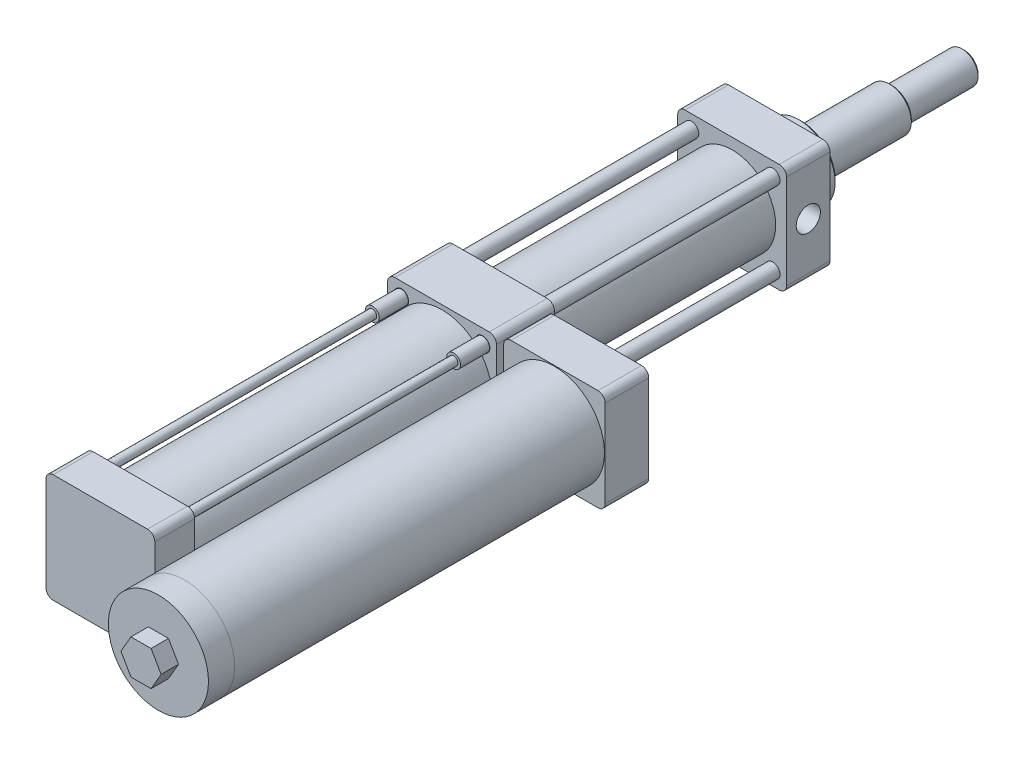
ISO-10303-21;
HEADER;
FILE_DESCRIPTION(('STEP AP214'),'2;1');
FILE_NAME('part.step','',(''),(''),'','','');
FILE_SCHEMA(('AUTOMOTIVE_DESIGN { 1 0 10303 214 1 1 1 1 }'));
ENDSEC;
DATA;
#1=APPLICATION_CONTEXT('core data for automotive mechanical design processes');
#2=APPLICATION_PROTOCOL_DEFINITION('international standard','automotive_design',2000,#1);
#3=PRODUCT_CONTEXT('',#1,'mechanical');
#4=PRODUCT('Part','Part','',(#3));
#5=PRODUCT_RELATED_PRODUCT_CATEGORY('part','',(#4));
#6=PRODUCT_DEFINITION_FORMATION('','',#4);
#7=PRODUCT_DEFINITION_CONTEXT('part definition',#1,'design');
#8=PRODUCT_DEFINITION('design','',#6,#7);
#9=PRODUCT_DEFINITION_SHAPE('','',#8);
#10=(LENGTH_UNIT() NAMED_UNIT(*) SI_UNIT(.MILLI.,.METRE.));
#11=(NAMED_UNIT(*) PLANE_ANGLE_UNIT() SI_UNIT($,.RADIAN.));
#12=(NAMED_UNIT(*) SI_UNIT($,.STERADIAN.) SOLID_ANGLE_UNIT());
#13=UNCERTAINTY_MEASURE_WITH_UNIT(LENGTH_MEASURE(1.E-05),#10,'distance_accuracy_value','');
#14=(GEOMETRIC_REPRESENTATION_CONTEXT(3) GLOBAL_UNCERTAINTY_ASSIGNED_CONTEXT((#13)) GLOBAL_UNIT_ASSIGNED_CONTEXT((#10,
#11,#12)) REPRESENTATION_CONTEXT('',''));
#15=CARTESIAN_POINT('',(0.,0.,0.));
#16=DIRECTION('',(0.,0.,1.));
#17=DIRECTION('',(1.,0.,0.));
#18=AXIS2_PLACEMENT_3D('',#15,#16,#17);
#19=CARTESIAN_POINT('',(-32.5,-32.5,190.));
#20=DIRECTION('',(0.,0.,1.));
#21=DIRECTION('',(1.,0.,0.));
#22=AXIS2_PLACEMENT_3D('',#19,#20,#21);
#23=PLANE('',#22);
#24=CARTESIAN_POINT('',(28.,-28.,190.));
#25=DIRECTION('',(0.,0.,1.));
#26=DIRECTION('',(1.,0.,0.));
#27=AXIS2_PLACEMENT_3D('',#24,#25,#26);
#28=CIRCLE('',#27,5.);
#29=CARTESIAN_POINT('',(23.,-28.,190.));
#30=VERTEX_POINT('',#29);
#31=EDGE_CURVE('E11',#30,#30,#28,.F.);
#32=ORIENTED_EDGE('',*,*,#31,.F.);
#33=EDGE_LOOP('',(#32));
#34=FACE_BOUND('',#33,.T.);
#35=ADVANCED_FACE('F43',(#34),#23,.T.);
#36=CARTESIAN_POINT('',(28.,-28.,0.));
#37=DIRECTION('',(0.,0.,-1.));
#38=DIRECTION('',(-1.,0.,0.));
#39=AXIS2_PLACEMENT_3D('',#36,#37,#38);
#40=PLANE('',#39);
#41=CARTESIAN_POINT('',(28.,-28.,0.));
#42=DIRECTION('',(0.,0.,-1.));
#43=DIRECTION('',(-1.,0.,0.));
#44=AXIS2_PLACEMENT_3D('',#41,#42,#43);
#45=CIRCLE('',#44,5.);
#46=CARTESIAN_POINT('',(23.,-28.,0.));
#47=VERTEX_POINT('',#46);
#48=EDGE_CURVE('E49',#47,#47,#45,.T.);
#49=ORIENTED_EDGE('',*,*,#48,.T.);
#50=EDGE_LOOP('',(#49));
#51=FACE_BOUND('',#50,.T.);
#52=ADVANCED_FACE('F55',(#51),#40,.T.);
#53=CARTESIAN_POINT('',(28.,-28.,204.142135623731));
#54=DIRECTION('',(0.,0.,-1.));
#55=DIRECTION('',(-1.,0.,0.));
#56=AXIS2_PLACEMENT_3D('',#53,#54,#55);
#57=CYLINDRICAL_SURFACE('',#56,5.);
#58=CARTESIAN_POINT('',(23.,-28.,0.));
#59=CARTESIAN_POINT('',(23.,-28.,1.97916666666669));
#60=CARTESIAN_POINT('',(23.,-28.,3.95833333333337));
#61=CARTESIAN_POINT('',(23.,-28.,7.9166666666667));
#62=CARTESIAN_POINT('',(23.,-28.,9.89583333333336));
#63=CARTESIAN_POINT('',(23.,-28.,13.8541666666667));
#64=CARTESIAN_POINT('',(23.,-28.,15.8333333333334));
#65=CARTESIAN_POINT('',(23.,-28.,19.7916666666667));
#66=CARTESIAN_POINT('',(23.,-28.,21.7708333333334));
#67=CARTESIAN_POINT('',(23.,-28.,25.7291666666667));
#68=CARTESIAN_POINT('',(23.,-28.,27.7083333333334));
#69=CARTESIAN_POINT('',(23.,-28.,31.6666666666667));
#70=CARTESIAN_POINT('',(23.,-28.,33.6458333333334));
#71=CARTESIAN_POINT('',(23.,-28.,37.6041666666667));
#72=CARTESIAN_POINT('',(23.,-28.,39.5833333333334));
#73=CARTESIAN_POINT('',(23.,-28.,43.5416666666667));
#74=CARTESIAN_POINT('',(23.,-28.,45.5208333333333));
#75=CARTESIAN_POINT('',(23.,-28.,49.4791666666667));
#76=CARTESIAN_POINT('',(23.,-28.,51.4583333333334));
#77=CARTESIAN_POINT('',(23.,-28.,55.4166666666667));
#78=CARTESIAN_POINT('',(23.,-28.,57.3958333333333));
#79=CARTESIAN_POINT('',(23.,-28.,61.3541666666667));
#80=CARTESIAN_POINT('',(23.,-28.,63.3333333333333));
#81=CARTESIAN_POINT('',(23.,-28.,67.2916666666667));
#82=CARTESIAN_POINT('',(23.,-28.,69.2708333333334));
#83=CARTESIAN_POINT('',(23.,-28.,73.2291666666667));
#84=CARTESIAN_POINT('',(23.,-28.,75.2083333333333));
#85=CARTESIAN_POINT('',(23.,-28.,79.1666666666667));
#86=CARTESIAN_POINT('',(23.,-28.,81.1458333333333));
#87=CARTESIAN_POINT('',(23.,-28.,85.1041666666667));
#88=CARTESIAN_POINT('',(23.,-28.,87.0833333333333));
#89=CARTESIAN_POINT('',(23.,-28.,91.0416666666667));
#90=CARTESIAN_POINT('',(23.,-28.,93.0208333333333));
#91=CARTESIAN_POINT('',(23.,-28.,96.9791666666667));
#92=CARTESIAN_POINT('',(23.,-28.,98.9583333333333));
#93=CARTESIAN_POINT('',(23.,-28.,102.916666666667));
#94=CARTESIAN_POINT('',(23.,-28.,104.895833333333));
#95=CARTESIAN_POINT('',(23.,-28.,108.854166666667));
#96=CARTESIAN_POINT('',(23.,-28.,110.833333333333));
#97=CARTESIAN_POINT('',(23.,-28.,114.791666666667));
#98=CARTESIAN_POINT('',(23.,-28.,116.770833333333));
#99=CARTESIAN_POINT('',(23.,-28.,120.729166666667));
#100=CARTESIAN_POINT('',(23.,-28.,122.708333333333));
#101=CARTESIAN_POINT('',(23.,-28.,126.666666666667));
#102=CARTESIAN_POINT('',(23.,-28.,128.645833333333));
#103=CARTESIAN_POINT('',(23.,-28.,132.604166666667));
#104=CARTESIAN_POINT('',(23.,-28.,134.583333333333));
#105=CARTESIAN_POINT('',(23.,-28.,138.541666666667));
#106=CARTESIAN_POINT('',(23.,-28.,140.520833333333));
#107=CARTESIAN_POINT('',(23.,-28.,144.479166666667));
#108=CARTESIAN_POINT('',(23.,-28.,146.458333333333));
#109=CARTESIAN_POINT('',(23.,-28.,150.416666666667));
#110=CARTESIAN_POINT('',(23.,-28.,152.395833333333));
#111=CARTESIAN_POINT('',(23.,-28.,156.354166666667));
#112=CARTESIAN_POINT('',(23.,-28.,158.333333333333));
#113=CARTESIAN_POINT('',(23.,-28.,162.291666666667));
#114=CARTESIAN_POINT('',(23.,-28.,164.270833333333));
#115=CARTESIAN_POINT('',(23.,-28.,168.229166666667));
#116=CARTESIAN_POINT('',(23.,-28.,170.208333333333));
#117=CARTESIAN_POINT('',(23.,-28.,174.166666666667));
#118=CARTESIAN_POINT('',(23.,-28.,176.145833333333));
#119=CARTESIAN_POINT('',(23.,-28.,180.104166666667));
#120=CARTESIAN_POINT('',(23.,-28.,182.083333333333));
#121=CARTESIAN_POINT('',(23.,-28.,186.041666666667));
#122=CARTESIAN_POINT('',(23.,-28.,188.020833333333));
#123=CARTESIAN_POINT('',(23.,-28.,190.));
#124=B_SPLINE_CURVE_WITH_KNOTS('',3,(#58,#59,#60,#61,#62,#63,#64,#65,#66,#67,#68,#69,#70,#71,
#72,#73,#74,#75,#76,#77,#78,#79,#80,#81,#82,#83,#84,#85,#86,#87,#88,#89,#90,#91,#92,#93,#94,#95,
#96,#97,#98,#99,#100,#101,#102,#103,#104,#105,#106,#107,#108,#109,#110,#111,#112,#113,#114,#115,
#116,#117,#118,#119,#120,#121,#122,#123),.UNSPECIFIED.,.F.,.F.,(4,2,2,2,2,2,2,2,2,2,2,2,2,2,2,2,
2,2,2,2,2,2,2,2,2,2,2,2,2,2,2,2,4),(0.,5.93750000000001,11.875,17.8125,23.75,29.6875,35.625,
41.5625,47.5,53.4375,59.375,65.3125,71.25,77.1875,83.125,89.0625,95.,100.9375,106.875,112.8125,
118.75,124.6875,130.625,136.5625,142.5,148.4375,154.375,160.3125,166.25,172.1875,178.125,
184.0625,190.),.UNSPECIFIED.);
#125=EDGE_CURVE('BSEAM57',#47,#30,#124,.T.);
#126=ORIENTED_EDGE('',*,*,#48,.F.);
#127=ORIENTED_EDGE('',*,*,#31,.T.);
#128=ORIENTED_EDGE('',*,*,#125,.T.);
#129=ORIENTED_EDGE('',*,*,#125,.F.);
#130=EDGE_LOOP('',(#126,#128,#127,#129));
#131=FACE_BOUND('',#130,.T.);
#132=ADVANCED_FACE('F57',(#131),#57,.T.);
#133=CLOSED_SHELL('',(#35,#52,#132));
#134=MANIFOLD_SOLID_BREP('B2',#133);
#135=CARTESIAN_POINT('',(-32.5,-32.5,190.));
#136=DIRECTION('',(0.,0.,1.));
#137=DIRECTION('',(1.,0.,0.));
#138=AXIS2_PLACEMENT_3D('',#135,#136,#137);
#139=PLANE('',#138);
#140=CARTESIAN_POINT('',(28.0000000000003,27.9999999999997,190.));
#141=DIRECTION('',(0.,0.,1.));
#142=DIRECTION('',(1.,0.,0.));
#143=AXIS2_PLACEMENT_3D('',#140,#141,#142);
#144=CIRCLE('',#143,5.);
#145=CARTESIAN_POINT('',(23.0000000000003,27.9999999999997,190.));
#146=VERTEX_POINT('',#145);
#147=EDGE_CURVE('E42',#146,#146,#144,.F.);
#148=ORIENTED_EDGE('',*,*,#147,.F.);
#149=EDGE_LOOP('',(#148));
#150=FACE_BOUND('',#149,.T.);
#151=ADVANCED_FACE('F91',(#150),#139,.T.);
#152=CARTESIAN_POINT('',(28.0000000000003,27.9999999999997,0.));
#153=DIRECTION('',(0.,0.,-1.));
#154=DIRECTION('',(-1.,0.,0.));
#155=AXIS2_PLACEMENT_3D('',#152,#153,#154);
#156=PLANE('',#155);
#157=CARTESIAN_POINT('',(28.0000000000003,27.9999999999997,0.));
#158=DIRECTION('',(0.,0.,-1.));
#159=DIRECTION('',(-1.,0.,0.));
#160=AXIS2_PLACEMENT_3D('',#157,#158,#159);
#161=CIRCLE('',#160,5.);
#162=CARTESIAN_POINT('',(23.0000000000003,27.9999999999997,0.));
#163=VERTEX_POINT('',#162);
#164=EDGE_CURVE('E97',#163,#163,#161,.T.);
#165=ORIENTED_EDGE('',*,*,#164,.T.);
#166=EDGE_LOOP('',(#165));
#167=FACE_BOUND('',#166,.T.);
#168=ADVANCED_FACE('F103',(#167),#156,.T.);
#169=CARTESIAN_POINT('',(28.0000000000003,27.9999999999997,204.142135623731));
#170=DIRECTION('',(0.,0.,-1.));
#171=DIRECTION('',(-1.,0.,0.));
#172=AXIS2_PLACEMENT_3D('',#169,#170,#171);
#173=CYLINDRICAL_SURFACE('',#172,5.);
#174=CARTESIAN_POINT('',(23.0000000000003,27.9999999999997,0.));
#175=CARTESIAN_POINT('',(23.0000000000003,27.9999999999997,1.97916666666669));
#176=CARTESIAN_POINT('',(23.0000000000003,27.9999999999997,3.95833333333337));
#177=CARTESIAN_POINT('',(23.0000000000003,27.9999999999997,7.9166666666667));
#178=CARTESIAN_POINT('',(23.0000000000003,27.9999999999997,9.89583333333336));
#179=CARTESIAN_POINT('',(23.0000000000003,27.9999999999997,13.8541666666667));
#180=CARTESIAN_POINT('',(23.0000000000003,27.9999999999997,15.8333333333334));
#181=CARTESIAN_POINT('',(23.0000000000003,27.9999999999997,19.7916666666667));
#182=CARTESIAN_POINT('',(23.0000000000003,27.9999999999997,21.7708333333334));
#183=CARTESIAN_POINT('',(23.0000000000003,27.9999999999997,25.7291666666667));
#184=CARTESIAN_POINT('',(23.0000000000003,27.9999999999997,27.7083333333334));
#185=CARTESIAN_POINT('',(23.0000000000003,27.9999999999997,31.6666666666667));
#186=CARTESIAN_POINT('',(23.0000000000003,27.9999999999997,33.6458333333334));
#187=CARTESIAN_POINT('',(23.0000000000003,27.9999999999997,37.6041666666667));
#188=CARTESIAN_POINT('',(23.0000000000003,27.9999999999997,39.5833333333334));
#189=CARTESIAN_POINT('',(23.0000000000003,27.9999999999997,43.5416666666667));
#190=CARTESIAN_POINT('',(23.0000000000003,27.9999999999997,45.5208333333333));
#191=CARTESIAN_POINT('',(23.0000000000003,27.9999999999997,49.4791666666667));
#192=CARTESIAN_POINT('',(23.0000000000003,27.9999999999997,51.4583333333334));
#193=CARTESIAN_POINT('',(23.0000000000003,27.9999999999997,55.4166666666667));
#194=CARTESIAN_POINT('',(23.0000000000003,27.9999999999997,57.3958333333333));
#195=CARTESIAN_POINT('',(23.0000000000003,27.9999999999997,61.3541666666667));
#196=CARTESIAN_POINT('',(23.0000000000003,27.9999999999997,63.3333333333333));
#197=CARTESIAN_POINT('',(23.0000000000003,27.9999999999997,67.2916666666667));
#198=CARTESIAN_POINT('',(23.0000000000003,27.9999999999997,69.2708333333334));
#199=CARTESIAN_POINT('',(23.0000000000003,27.9999999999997,73.2291666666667));
#200=CARTESIAN_POINT('',(23.0000000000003,27.9999999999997,75.2083333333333));
#201=CARTESIAN_POINT('',(23.0000000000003,27.9999999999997,79.1666666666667));
#202=CARTESIAN_POINT('',(23.0000000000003,27.9999999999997,81.1458333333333));
#203=CARTESIAN_POINT('',(23.0000000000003,27.9999999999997,85.1041666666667));
#204=CARTESIAN_POINT('',(23.0000000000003,27.9999999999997,87.0833333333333));
#205=CARTESIAN_POINT('',(23.0000000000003,27.9999999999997,91.0416666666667));
#206=CARTESIAN_POINT('',(23.0000000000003,27.9999999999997,93.0208333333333));
#207=CARTESIAN_POINT('',(23.0000000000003,27.9999999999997,96.9791666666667));
#208=CARTESIAN_POINT('',(23.0000000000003,27.9999999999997,98.9583333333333));
#209=CARTESIAN_POINT('',(23.0000000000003,27.9999999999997,102.916666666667));
#210=CARTESIAN_POINT('',(23.0000000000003,27.9999999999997,104.895833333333));
#211=CARTESIAN_POINT('',(23.0000000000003,27.9999999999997,108.854166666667));
#212=CARTESIAN_POINT('',(23.0000000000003,27.9999999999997,110.833333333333));
#213=CARTESIAN_POINT('',(23.0000000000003,27.9999999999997,114.791666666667));
#214=CARTESIAN_POINT('',(23.0000000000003,27.9999999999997,116.770833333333));
#215=CARTESIAN_POINT('',(23.0000000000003,27.9999999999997,120.729166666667));
#216=CARTESIAN_POINT('',(23.0000000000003,27.9999999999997,122.708333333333));
#217=CARTESIAN_POINT('',(23.0000000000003,27.9999999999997,126.666666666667));
#218=CARTESIAN_POINT('',(23.0000000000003,27.9999999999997,128.645833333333));
#219=CARTESIAN_POINT('',(23.0000000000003,27.9999999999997,132.604166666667));
#220=CARTESIAN_POINT('',(23.0000000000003,27.9999999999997,134.583333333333));
#221=CARTESIAN_POINT('',(23.0000000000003,27.9999999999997,138.541666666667));
#222=CARTESIAN_POINT('',(23.0000000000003,27.9999999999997,140.520833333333));
#223=CARTESIAN_POINT('',(23.0000000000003,27.9999999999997,144.479166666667));
#224=CARTESIAN_POINT('',(23.0000000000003,27.9999999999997,146.458333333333));
#225=CARTESIAN_POINT('',(23.0000000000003,27.9999999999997,150.416666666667));
#226=CARTESIAN_POINT('',(23.0000000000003,27.9999999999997,152.395833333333));
#227=CARTESIAN_POINT('',(23.0000000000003,27.9999999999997,156.354166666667));
#228=CARTESIAN_POINT('',(23.0000000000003,27.9999999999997,158.333333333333));
#229=CARTESIAN_POINT('',(23.0000000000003,27.9999999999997,162.291666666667));
#230=CARTESIAN_POINT('',(23.0000000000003,27.9999999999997,164.270833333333));
#231=CARTESIAN_POINT('',(23.0000000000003,27.9999999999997,168.229166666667));
#232=CARTESIAN_POINT('',(23.0000000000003,27.9999999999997,170.208333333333));
#233=CARTESIAN_POINT('',(23.0000000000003,27.9999999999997,174.166666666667));
#234=CARTESIAN_POINT('',(23.0000000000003,27.9999999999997,176.145833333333));
#235=CARTESIAN_POINT('',(23.0000000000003,27.9999999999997,180.104166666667));
#236=CARTESIAN_POINT('',(23.0000000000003,27.9999999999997,182.083333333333));
#237=CARTESIAN_POINT('',(23.0000000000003,27.9999999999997,186.041666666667));
#238=CARTESIAN_POINT('',(23.0000000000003,27.9999999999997,188.020833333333));
#239=CARTESIAN_POINT('',(23.0000000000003,27.9999999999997,190.));
#240=B_SPLINE_CURVE_WITH_KNOTS('',3,(#174,#175,#176,#177,#178,#179,#180,#181,#182,#183,#184,
#185,#186,#187,#188,#189,#190,#191,#192,#193,#194,#195,#196,#197,#198,#199,#200,#201,#202,#203,
#204,#205,#206,#207,#208,#209,#210,#211,#212,#213,#214,#215,#216,#217,#218,#219,#220,#221,#222,
#223,#224,#225,#226,#227,#228,#229,#230,#231,#232,#233,#234,#235,#236,#237,#238,#239),
.UNSPECIFIED.,.F.,.F.,(4,2,2,2,2,2,2,2,2,2,2,2,2,2,2,2,2,2,2,2,2,2,2,2,2,2,2,2,2,2,2,2,4),(0.,
5.93750000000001,11.875,17.8125,23.75,29.6875,35.625,41.5625,47.5,53.4375,59.375,65.3125,71.25,
77.1875,83.125,89.0625,95.,100.9375,106.875,112.8125,118.75,124.6875,130.625,136.5625,142.5,
148.4375,154.375,160.3125,166.25,172.1875,178.125,184.0625,190.),.UNSPECIFIED.);
#241=EDGE_CURVE('BSEAM105',#163,#146,#240,.T.);
#242=ORIENTED_EDGE('',*,*,#164,.F.);
#243=ORIENTED_EDGE('',*,*,#147,.T.);
#244=ORIENTED_EDGE('',*,*,#241,.T.);
#245=ORIENTED_EDGE('',*,*,#241,.F.);
#246=EDGE_LOOP('',(#242,#244,#243,#245));
#247=FACE_BOUND('',#246,.T.);
#248=ADVANCED_FACE('F105',(#247),#173,.T.);
#249=CLOSED_SHELL('',(#151,#168,#248));
#250=MANIFOLD_SOLID_BREP('B6',#249);
#251=CARTESIAN_POINT('',(-32.5,-32.5,190.));
#252=DIRECTION('',(0.,0.,1.));
#253=DIRECTION('',(1.,0.,0.));
#254=AXIS2_PLACEMENT_3D('',#251,#252,#253);
#255=PLANE('',#254);
#256=CARTESIAN_POINT('',(-28.0000000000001,-27.9999999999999,190.));
#257=DIRECTION('',(0.,0.,1.));
#258=DIRECTION('',(1.,0.,0.));
#259=AXIS2_PLACEMENT_3D('',#256,#257,#258);
#260=CIRCLE('',#259,5.);
#261=CARTESIAN_POINT('',(-33.0000000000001,-27.9999999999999,190.));
#262=VERTEX_POINT('',#261);
#263=EDGE_CURVE('E90',#262,#262,#260,.F.);
#264=ORIENTED_EDGE('',*,*,#263,.F.);
#265=EDGE_LOOP('',(#264));
#266=FACE_BOUND('',#265,.T.);
#267=ADVANCED_FACE('F139',(#266),#255,.T.);
#268=CARTESIAN_POINT('',(-28.0000000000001,-27.9999999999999,0.));
#269=DIRECTION('',(0.,0.,-1.));
#270=DIRECTION('',(-1.,0.,0.));
#271=AXIS2_PLACEMENT_3D('',#268,#269,#270);
#272=PLANE('',#271);
#273=CARTESIAN_POINT('',(-28.0000000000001,-27.9999999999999,0.));
#274=DIRECTION('',(0.,0.,-1.));
#275=DIRECTION('',(-1.,0.,0.));
#276=AXIS2_PLACEMENT_3D('',#273,#274,#275);
#277=CIRCLE('',#276,5.);
#278=CARTESIAN_POINT('',(-33.0000000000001,-27.9999999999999,0.));
#279=VERTEX_POINT('',#278);
#280=EDGE_CURVE('E145',#279,#279,#277,.T.);
#281=ORIENTED_EDGE('',*,*,#280,.T.);
#282=EDGE_LOOP('',(#281));
#283=FACE_BOUND('',#282,.T.);
#284=ADVANCED_FACE('F151',(#283),#272,.T.);
#285=CARTESIAN_POINT('',(-28.0000000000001,-27.9999999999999,204.142135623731));
#286=DIRECTION('',(0.,0.,-1.));
#287=DIRECTION('',(-1.,0.,0.));
#288=AXIS2_PLACEMENT_3D('',#285,#286,#287);
#289=CYLINDRICAL_SURFACE('',#288,5.);
#290=CARTESIAN_POINT('',(-33.0000000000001,-27.9999999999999,0.));
#291=CARTESIAN_POINT('',(-33.0000000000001,-27.9999999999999,1.97916666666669));
#292=CARTESIAN_POINT('',(-33.0000000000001,-27.9999999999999,3.95833333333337));
#293=CARTESIAN_POINT('',(-33.0000000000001,-27.9999999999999,7.9166666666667));
#294=CARTESIAN_POINT('',(-33.0000000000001,-27.9999999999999,9.89583333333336));
#295=CARTESIAN_POINT('',(-33.0000000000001,-27.9999999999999,13.8541666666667));
#296=CARTESIAN_POINT('',(-33.0000000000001,-27.9999999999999,15.8333333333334));
#297=CARTESIAN_POINT('',(-33.0000000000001,-27.9999999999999,19.7916666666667));
#298=CARTESIAN_POINT('',(-33.0000000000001,-27.9999999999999,21.7708333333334));
#299=CARTESIAN_POINT('',(-33.0000000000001,-27.9999999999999,25.7291666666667));
#300=CARTESIAN_POINT('',(-33.0000000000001,-27.9999999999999,27.7083333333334));
#301=CARTESIAN_POINT('',(-33.0000000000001,-27.9999999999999,31.6666666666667));
#302=CARTESIAN_POINT('',(-33.0000000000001,-27.9999999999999,33.6458333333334));
#303=CARTESIAN_POINT('',(-33.0000000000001,-27.9999999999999,37.6041666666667));
#304=CARTESIAN_POINT('',(-33.0000000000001,-27.9999999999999,39.5833333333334));
#305=CARTESIAN_POINT('',(-33.0000000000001,-27.9999999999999,43.5416666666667));
#306=CARTESIAN_POINT('',(-33.0000000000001,-27.9999999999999,45.5208333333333));
#307=CARTESIAN_POINT('',(-33.0000000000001,-27.9999999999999,49.4791666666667));
#308=CARTESIAN_POINT('',(-33.0000000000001,-27.9999999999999,51.4583333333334));
#309=CARTESIAN_POINT('',(-33.0000000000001,-27.9999999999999,55.4166666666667));
#310=CARTESIAN_POINT('',(-33.0000000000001,-27.9999999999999,57.3958333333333));
#311=CARTESIAN_POINT('',(-33.0000000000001,-27.9999999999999,61.3541666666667));
#312=CARTESIAN_POINT('',(-33.0000000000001,-27.9999999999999,63.3333333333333));
#313=CARTESIAN_POINT('',(-33.0000000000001,-27.9999999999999,67.2916666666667));
#314=CARTESIAN_POINT('',(-33.0000000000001,-27.9999999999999,69.2708333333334));
#315=CARTESIAN_POINT('',(-33.0000000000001,-27.9999999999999,73.2291666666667));
#316=CARTESIAN_POINT('',(-33.0000000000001,-27.9999999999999,75.2083333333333));
#317=CARTESIAN_POINT('',(-33.0000000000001,-27.9999999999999,79.1666666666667));
#318=CARTESIAN_POINT('',(-33.0000000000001,-27.9999999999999,81.1458333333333));
#319=CARTESIAN_POINT('',(-33.0000000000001,-27.9999999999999,85.1041666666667));
#320=CARTESIAN_POINT('',(-33.0000000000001,-27.9999999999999,87.0833333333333));
#321=CARTESIAN_POINT('',(-33.0000000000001,-27.9999999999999,91.0416666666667));
#322=CARTESIAN_POINT('',(-33.0000000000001,-27.9999999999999,93.0208333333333));
#323=CARTESIAN_POINT('',(-33.0000000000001,-27.9999999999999,96.9791666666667));
#324=CARTESIAN_POINT('',(-33.0000000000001,-27.9999999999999,98.9583333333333));
#325=CARTESIAN_POINT('',(-33.0000000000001,-27.9999999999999,102.916666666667));
#326=CARTESIAN_POINT('',(-33.0000000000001,-27.9999999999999,104.895833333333));
#327=CARTESIAN_POINT('',(-33.0000000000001,-27.9999999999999,108.854166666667));
#328=CARTESIAN_POINT('',(-33.0000000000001,-27.9999999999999,110.833333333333));
#329=CARTESIAN_POINT('',(-33.0000000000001,-27.9999999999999,114.791666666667));
#330=CARTESIAN_POINT('',(-33.0000000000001,-27.9999999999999,116.770833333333));
#331=CARTESIAN_POINT('',(-33.0000000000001,-27.9999999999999,120.729166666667));
#332=CARTESIAN_POINT('',(-33.0000000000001,-27.9999999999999,122.708333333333));
#333=CARTESIAN_POINT('',(-33.0000000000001,-27.9999999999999,126.666666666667));
#334=CARTESIAN_POINT('',(-33.0000000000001,-27.9999999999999,128.645833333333));
#335=CARTESIAN_POINT('',(-33.0000000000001,-27.9999999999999,132.604166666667));
#336=CARTESIAN_POINT('',(-33.0000000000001,-27.9999999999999,134.583333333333));
#337=CARTESIAN_POINT('',(-33.0000000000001,-27.9999999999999,138.541666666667));
#338=CARTESIAN_POINT('',(-33.0000000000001,-27.9999999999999,140.520833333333));
#339=CARTESIAN_POINT('',(-33.0000000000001,-27.9999999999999,144.479166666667));
#340=CARTESIAN_POINT('',(-33.0000000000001,-27.9999999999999,146.458333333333));
#341=CARTESIAN_POINT('',(-33.0000000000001,-27.9999999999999,150.416666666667));
#342=CARTESIAN_POINT('',(-33.0000000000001,-27.9999999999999,152.395833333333));
#343=CARTESIAN_POINT('',(-33.0000000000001,-27.9999999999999,156.354166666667));
#344=CARTESIAN_POINT('',(-33.0000000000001,-27.9999999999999,158.333333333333));
#345=CARTESIAN_POINT('',(-33.0000000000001,-27.9999999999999,162.291666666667));
#346=CARTESIAN_POINT('',(-33.0000000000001,-27.9999999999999,164.270833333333));
#347=CARTESIAN_POINT('',(-33.0000000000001,-27.9999999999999,168.229166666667));
#348=CARTESIAN_POINT('',(-33.0000000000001,-27.9999999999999,170.208333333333));
#349=CARTESIAN_POINT('',(-33.0000000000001,-27.9999999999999,174.166666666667));
#350=CARTESIAN_POINT('',(-33.0000000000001,-27.9999999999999,176.145833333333));
#351=CARTESIAN_POINT('',(-33.0000000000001,-27.9999999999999,180.104166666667));
#352=CARTESIAN_POINT('',(-33.0000000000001,-27.9999999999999,182.083333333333));
#353=CARTESIAN_POINT('',(-33.0000000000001,-27.9999999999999,186.041666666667));
#354=CARTESIAN_POINT('',(-33.0000000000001,-27.9999999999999,188.020833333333));
#355=CARTESIAN_POINT('',(-33.0000000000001,-27.9999999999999,190.));
#356=B_SPLINE_CURVE_WITH_KNOTS('',3,(#290,#291,#292,#293,#294,#295,#296,#297,#298,#299,#300,
#301,#302,#303,#304,#305,#306,#307,#308,#309,#310,#311,#312,#313,#314,#315,#316,#317,#318,#319,
#320,#321,#322,#323,#324,#325,#326,#327,#328,#329,#330,#331,#332,#333,#334,#335,#336,#337,#338,
#339,#340,#341,#342,#343,#344,#345,#346,#347,#348,#349,#350,#351,#352,#353,#354,#355),
.UNSPECIFIED.,.F.,.F.,(4,2,2,2,2,2,2,2,2,2,2,2,2,2,2,2,2,2,2,2,2,2,2,2,2,2,2,2,2,2,2,2,4),(0.,
5.93750000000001,11.875,17.8125,23.75,29.6875,35.625,41.5625,47.5,53.4375,59.375,65.3125,71.25,
77.1875,83.125,89.0625,95.,100.9375,106.875,112.8125,118.75,124.6875,130.625,136.5625,142.5,
148.4375,154.375,160.3125,166.25,172.1875,178.125,184.0625,190.),.UNSPECIFIED.);
#357=EDGE_CURVE('BSEAM153',#279,#262,#356,.T.);
#358=ORIENTED_EDGE('',*,*,#280,.F.);
#359=ORIENTED_EDGE('',*,*,#263,.T.);
#360=ORIENTED_EDGE('',*,*,#357,.T.);
#361=ORIENTED_EDGE('',*,*,#357,.F.);
#362=EDGE_LOOP('',(#358,#360,#359,#361));
#363=FACE_BOUND('',#362,.T.);
#364=ADVANCED_FACE('F153',(#363),#289,.T.);
#365=CLOSED_SHELL('',(#267,#284,#364));
#366=MANIFOLD_SOLID_BREP('B37',#365);
#367=CARTESIAN_POINT('',(-32.5,-32.5,190.));
#368=DIRECTION('',(0.,0.,1.));
#369=DIRECTION('',(1.,0.,0.));
#370=AXIS2_PLACEMENT_3D('',#367,#368,#369);
#371=PLANE('',#370);
#372=CARTESIAN_POINT('',(-27.9999999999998,28.0000000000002,190.));
#373=DIRECTION('',(0.,0.,1.));
#374=DIRECTION('',(1.,0.,0.));
#375=AXIS2_PLACEMENT_3D('',#372,#373,#374);
#376=CIRCLE('',#375,5.);
#377=CARTESIAN_POINT('',(-32.9999999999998,28.0000000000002,190.));
#378=VERTEX_POINT('',#377);
#379=EDGE_CURVE('E138',#378,#378,#376,.F.);
#380=ORIENTED_EDGE('',*,*,#379,.F.);
#381=EDGE_LOOP('',(#380));
#382=FACE_BOUND('',#381,.T.);
#383=ADVANCED_FACE('F189',(#382),#371,.T.);
#384=CARTESIAN_POINT('',(-27.9999999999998,28.0000000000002,0.));
#385=DIRECTION('',(0.,0.,-1.));
#386=DIRECTION('',(-1.,0.,0.));
#387=AXIS2_PLACEMENT_3D('',#384,#385,#386);
#388=PLANE('',#387);
#389=CARTESIAN_POINT('',(-27.9999999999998,28.0000000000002,0.));
#390=DIRECTION('',(0.,0.,-1.));
#391=DIRECTION('',(-1.,0.,0.));
#392=AXIS2_PLACEMENT_3D('',#389,#390,#391);
#393=CIRCLE('',#392,5.);
#394=CARTESIAN_POINT('',(-32.9999999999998,28.0000000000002,0.));
#395=VERTEX_POINT('',#394);
#396=EDGE_CURVE('E195',#395,#395,#393,.T.);
#397=ORIENTED_EDGE('',*,*,#396,.T.);
#398=EDGE_LOOP('',(#397));
#399=FACE_BOUND('',#398,.T.);
#400=ADVANCED_FACE('F201',(#399),#388,.T.);
#401=CARTESIAN_POINT('',(-27.9999999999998,28.0000000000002,204.142135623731));
#402=DIRECTION('',(0.,0.,-1.));
#403=DIRECTION('',(-1.,0.,0.));
#404=AXIS2_PLACEMENT_3D('',#401,#402,#403);
#405=CYLINDRICAL_SURFACE('',#404,5.);
#406=CARTESIAN_POINT('',(-32.9999999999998,28.0000000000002,0.));
#407=CARTESIAN_POINT('',(-32.9999999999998,28.0000000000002,1.97916666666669));
#408=CARTESIAN_POINT('',(-32.9999999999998,28.0000000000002,3.95833333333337));
#409=CARTESIAN_POINT('',(-32.9999999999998,28.0000000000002,7.9166666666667));
#410=CARTESIAN_POINT('',(-32.9999999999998,28.0000000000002,9.89583333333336));
#411=CARTESIAN_POINT('',(-32.9999999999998,28.0000000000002,13.8541666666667));
#412=CARTESIAN_POINT('',(-32.9999999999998,28.0000000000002,15.8333333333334));
#413=CARTESIAN_POINT('',(-32.9999999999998,28.0000000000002,19.7916666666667));
#414=CARTESIAN_POINT('',(-32.9999999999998,28.0000000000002,21.7708333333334));
#415=CARTESIAN_POINT('',(-32.9999999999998,28.0000000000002,25.7291666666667));
#416=CARTESIAN_POINT('',(-32.9999999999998,28.0000000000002,27.7083333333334));
#417=CARTESIAN_POINT('',(-32.9999999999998,28.0000000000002,31.6666666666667));
#418=CARTESIAN_POINT('',(-32.9999999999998,28.0000000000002,33.6458333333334));
#419=CARTESIAN_POINT('',(-32.9999999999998,28.0000000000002,37.6041666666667));
#420=CARTESIAN_POINT('',(-32.9999999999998,28.0000000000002,39.5833333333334));
#421=CARTESIAN_POINT('',(-32.9999999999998,28.0000000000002,43.5416666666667));
#422=CARTESIAN_POINT('',(-32.9999999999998,28.0000000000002,45.5208333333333));
#423=CARTESIAN_POINT('',(-32.9999999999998,28.0000000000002,49.4791666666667));
#424=CARTESIAN_POINT('',(-32.9999999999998,28.0000000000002,51.4583333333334));
#425=CARTESIAN_POINT('',(-32.9999999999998,28.0000000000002,55.4166666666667));
#426=CARTESIAN_POINT('',(-32.9999999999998,28.0000000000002,57.3958333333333));
#427=CARTESIAN_POINT('',(-32.9999999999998,28.0000000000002,61.3541666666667));
#428=CARTESIAN_POINT('',(-32.9999999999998,28.0000000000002,63.3333333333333));
#429=CARTESIAN_POINT('',(-32.9999999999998,28.0000000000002,67.2916666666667));
#430=CARTESIAN_POINT('',(-32.9999999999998,28.0000000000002,69.2708333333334));
#431=CARTESIAN_POINT('',(-32.9999999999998,28.0000000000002,73.2291666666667));
#432=CARTESIAN_POINT('',(-32.9999999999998,28.0000000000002,75.2083333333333));
#433=CARTESIAN_POINT('',(-32.9999999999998,28.0000000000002,79.1666666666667));
#434=CARTESIAN_POINT('',(-32.9999999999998,28.0000000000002,81.1458333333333));
#435=CARTESIAN_POINT('',(-32.9999999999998,28.0000000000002,85.1041666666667));
#436=CARTESIAN_POINT('',(-32.9999999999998,28.0000000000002,87.0833333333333));
#437=CARTESIAN_POINT('',(-32.9999999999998,28.0000000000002,91.0416666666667));
#438=CARTESIAN_POINT('',(-32.9999999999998,28.0000000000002,93.0208333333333));
#439=CARTESIAN_POINT('',(-32.9999999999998,28.0000000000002,96.9791666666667));
#440=CARTESIAN_POINT('',(-32.9999999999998,28.0000000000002,98.9583333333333));
#441=CARTESIAN_POINT('',(-32.9999999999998,28.0000000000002,102.916666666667));
#442=CARTESIAN_POINT('',(-32.9999999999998,28.0000000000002,104.895833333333));
#443=CARTESIAN_POINT('',(-32.9999999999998,28.0000000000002,108.854166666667));
#444=CARTESIAN_POINT('',(-32.9999999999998,28.0000000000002,110.833333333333));
#445=CARTESIAN_POINT('',(-32.9999999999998,28.0000000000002,114.791666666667));
#446=CARTESIAN_POINT('',(-32.9999999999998,28.0000000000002,116.770833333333));
#447=CARTESIAN_POINT('',(-32.9999999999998,28.0000000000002,120.729166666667));
#448=CARTESIAN_POINT('',(-32.9999999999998,28.0000000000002,122.708333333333));
#449=CARTESIAN_POINT('',(-32.9999999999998,28.0000000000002,126.666666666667));
#450=CARTESIAN_POINT('',(-32.9999999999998,28.0000000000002,128.645833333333));
#451=CARTESIAN_POINT('',(-32.9999999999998,28.0000000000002,132.604166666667));
#452=CARTESIAN_POINT('',(-32.9999999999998,28.0000000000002,134.583333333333));
#453=CARTESIAN_POINT('',(-32.9999999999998,28.0000000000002,138.541666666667));
#454=CARTESIAN_POINT('',(-32.9999999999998,28.0000000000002,140.520833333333));
#455=CARTESIAN_POINT('',(-32.9999999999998,28.0000000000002,144.479166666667));
#456=CARTESIAN_POINT('',(-32.9999999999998,28.0000000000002,146.458333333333));
#457=CARTESIAN_POINT('',(-32.9999999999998,28.0000000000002,150.416666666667));
#458=CARTESIAN_POINT('',(-32.9999999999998,28.0000000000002,152.395833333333));
#459=CARTESIAN_POINT('',(-32.9999999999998,28.0000000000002,156.354166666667));
#460=CARTESIAN_POINT('',(-32.9999999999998,28.0000000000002,158.333333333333));
#461=CARTESIAN_POINT('',(-32.9999999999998,28.0000000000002,162.291666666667));
#462=CARTESIAN_POINT('',(-32.9999999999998,28.0000000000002,164.270833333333));
#463=CARTESIAN_POINT('',(-32.9999999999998,28.0000000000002,168.229166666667));
#464=CARTESIAN_POINT('',(-32.9999999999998,28.0000000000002,170.208333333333));
#465=CARTESIAN_POINT('',(-32.9999999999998,28.0000000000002,174.166666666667));
#466=CARTESIAN_POINT('',(-32.9999999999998,28.0000000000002,176.145833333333));
#467=CARTESIAN_POINT('',(-32.9999999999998,28.0000000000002,180.104166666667));
#468=CARTESIAN_POINT('',(-32.9999999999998,28.0000000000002,182.083333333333));
#469=CARTESIAN_POINT('',(-32.9999999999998,28.0000000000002,186.041666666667));
#470=CARTESIAN_POINT('',(-32.9999999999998,28.0000000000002,188.020833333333));
#471=CARTESIAN_POINT('',(-32.9999999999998,28.0000000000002,190.));
#472=B_SPLINE_CURVE_WITH_KNOTS('',3,(#406,#407,#408,#409,#410,#411,#412,#413,#414,#415,#416,
#417,#418,#419,#420,#421,#422,#423,#424,#425,#426,#427,#428,#429,#430,#431,#432,#433,#434,#435,
#436,#437,#438,#439,#440,#441,#442,#443,#444,#445,#446,#447,#448,#449,#450,#451,#452,#453,#454,
#455,#456,#457,#458,#459,#460,#461,#462,#463,#464,#465,#466,#467,#468,#469,#470,#471),
.UNSPECIFIED.,.F.,.F.,(4,2,2,2,2,2,2,2,2,2,2,2,2,2,2,2,2,2,2,2,2,2,2,2,2,2,2,2,2,2,2,2,4),(0.,
5.93750000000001,11.875,17.8125,23.75,29.6875,35.625,41.5625,47.5,53.4375,59.375,65.3125,71.25,
77.1875,83.125,89.0625,95.,100.9375,106.875,112.8125,118.75,124.6875,130.625,136.5625,142.5,
148.4375,154.375,160.3125,166.25,172.1875,178.125,184.0625,190.),.UNSPECIFIED.);
#473=EDGE_CURVE('BSEAM203',#395,#378,#472,.T.);
#474=ORIENTED_EDGE('',*,*,#396,.F.);
#475=ORIENTED_EDGE('',*,*,#379,.T.);
#476=ORIENTED_EDGE('',*,*,#473,.T.);
#477=ORIENTED_EDGE('',*,*,#473,.F.);
#478=EDGE_LOOP('',(#474,#476,#475,#477));
#479=FACE_BOUND('',#478,.T.);
#480=ADVANCED_FACE('F203',(#479),#405,.T.);
#481=CLOSED_SHELL('',(#383,#400,#480));
#482=MANIFOLD_SOLID_BREP('B85',#481);
#483=CARTESIAN_POINT('',(72.5,0.,498.));
#484=DIRECTION('',(0.,0.,1.));
#485=DIRECTION('',(1.,0.,0.));
#486=AXIS2_PLACEMENT_3D('',#483,#484,#485);
#487=PLANE('',#486);
#488=CARTESIAN_POINT('',(72.5,0.,498.));
#489=DIRECTION('',(0.,0.,1.));
#490=DIRECTION('',(1.,0.,0.));
#491=AXIS2_PLACEMENT_3D('',#488,#489,#490);
#492=CIRCLE('',#491,34.5);
#493=CARTESIAN_POINT('',(107.,0.,498.));
#494=VERTEX_POINT('',#493);
#495=EDGE_CURVE('E187',#494,#494,#492,.T.);
#496=ORIENTED_EDGE('',*,*,#495,.T.);
#497=EDGE_LOOP('',(#496));
#498=FACE_BOUND('',#497,.T.);
#499=DIRECTION('',(-0.5,0.866025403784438,0.));
#500=VECTOR('',#499,1.);
#501=CARTESIAN_POINT('',(86.3564064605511,0.,498.));
#502=LINE('',#501,#500);
#503=CARTESIAN_POINT('',(86.3564064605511,0.,498.));
#504=VERTEX_POINT('',#503);
#505=CARTESIAN_POINT('',(79.4282032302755,12.,498.));
#506=VERTEX_POINT('',#505);
#507=EDGE_CURVE('E325',#504,#506,#502,.T.);
#508=ORIENTED_EDGE('',*,*,#507,.F.);
#509=DIRECTION('',(0.5,0.866025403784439,0.));
#510=VECTOR('',#509,1.);
#511=CARTESIAN_POINT('',(79.4282032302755,-12.,498.));
#512=LINE('',#511,#510);
#513=CARTESIAN_POINT('',(79.4282032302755,-12.,498.));
#514=VERTEX_POINT('',#513);
#515=EDGE_CURVE('E322',#514,#504,#512,.T.);
#516=ORIENTED_EDGE('',*,*,#515,.F.);
#517=DIRECTION('',(1.,0.,0.));
#518=VECTOR('',#517,1.);
#519=CARTESIAN_POINT('',(65.5717967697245,-12.,498.));
#520=LINE('',#519,#518);
#521=CARTESIAN_POINT('',(65.5717967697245,-12.,498.));
#522=VERTEX_POINT('',#521);
#523=EDGE_CURVE('E281',#522,#514,#520,.T.);
#524=ORIENTED_EDGE('',*,*,#523,.F.);
#525=DIRECTION('',(0.5,-0.866025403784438,0.));
#526=VECTOR('',#525,1.);
#527=CARTESIAN_POINT('',(58.643593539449,0.,498.));
#528=LINE('',#527,#526);
#529=CARTESIAN_POINT('',(58.643593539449,0.,498.));
#530=VERTEX_POINT('',#529);
#531=EDGE_CURVE('E330',#530,#522,#528,.T.);
#532=ORIENTED_EDGE('',*,*,#531,.F.);
#533=DIRECTION('',(-0.499999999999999,-0.866025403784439,0.));
#534=VECTOR('',#533,1.);
#535=CARTESIAN_POINT('',(65.5717967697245,12.,498.));
#536=LINE('',#535,#534);
#537=CARTESIAN_POINT('',(65.5717967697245,12.,498.));
#538=VERTEX_POINT('',#537);
#539=EDGE_CURVE('E311',#538,#530,#536,.T.);
#540=ORIENTED_EDGE('',*,*,#539,.F.);
#541=DIRECTION('',(-1.,0.,0.));
#542=VECTOR('',#541,1.);
#543=CARTESIAN_POINT('',(79.4282032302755,12.,498.));
#544=LINE('',#543,#542);
#545=EDGE_CURVE('E327',#506,#538,#544,.T.);
#546=ORIENTED_EDGE('',*,*,#545,.F.);
#547=EDGE_LOOP('',(#508,#516,#524,#532,#540,#546));
#548=FACE_BOUND('',#547,.T.);
#549=ADVANCED_FACE('F238',(#498,#548),#487,.T.);
#550=CARTESIAN_POINT('',(72.5,0.,498.));
#551=DIRECTION('',(0.,0.,-1.));
#552=DIRECTION('',(-1.,0.,0.));
#553=AXIS2_PLACEMENT_3D('',#550,#551,#552);
#554=CYLINDRICAL_SURFACE('',#553,34.5);
#555=ORIENTED_EDGE('',*,*,#495,.F.);
#556=EDGE_LOOP('',(#555));
#557=FACE_BOUND('',#556,.T.);
#558=CARTESIAN_POINT('',(72.5,0.,480.));
#559=DIRECTION('',(0.,0.,1.));
#560=DIRECTION('',(1.,0.,0.));
#561=AXIS2_PLACEMENT_3D('',#558,#559,#560);
#562=CIRCLE('',#561,34.5);
#563=CARTESIAN_POINT('',(107.,0.,480.));
#564=VERTEX_POINT('',#563);
#565=EDGE_CURVE('E242',#564,#564,#562,.T.);
#566=ORIENTED_EDGE('',*,*,#565,.T.);
#567=EDGE_LOOP('',(#566));
#568=FACE_BOUND('',#567,.T.);
#569=ADVANCED_FACE('F240',(#557,#568),#554,.T.);
#570=CARTESIAN_POINT('',(72.5,0.,480.));
#571=DIRECTION('',(0.,0.,1.));
#572=DIRECTION('',(1.,0.,0.));
#573=AXIS2_PLACEMENT_3D('',#570,#571,#572);
#574=PLANE('',#573);
#575=ORIENTED_EDGE('',*,*,#565,.F.);
#576=EDGE_LOOP('',(#575));
#577=FACE_BOUND('',#576,.T.);
#578=ADVANCED_FACE('F346',(#577),#574,.F.);
#579=CARTESIAN_POINT('',(79.4282032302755,-12.,510.));
#580=DIRECTION('',(-0.866025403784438,0.5,0.));
#581=DIRECTION('',(-0.5,-0.866025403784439,0.));
#582=AXIS2_PLACEMENT_3D('',#579,#580,#581);
#583=PLANE('',#582);
#584=ORIENTED_EDGE('',*,*,#515,.T.);
#585=DIRECTION('',(0.,0.,-1.));
#586=VECTOR('',#585,1.);
#587=CARTESIAN_POINT('',(86.3564064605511,0.,510.));
#588=LINE('',#587,#586);
#589=CARTESIAN_POINT('',(86.3564064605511,0.,510.));
#590=VERTEX_POINT('',#589);
#591=EDGE_CURVE('E340',#590,#504,#588,.T.);
#592=ORIENTED_EDGE('',*,*,#591,.F.);
#593=DIRECTION('',(0.5,0.866025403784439,0.));
#594=VECTOR('',#593,1.);
#595=CARTESIAN_POINT('',(79.4282032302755,-12.,510.));
#596=LINE('',#595,#594);
#597=CARTESIAN_POINT('',(79.4282032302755,-12.,510.));
#598=VERTEX_POINT('',#597);
#599=EDGE_CURVE('E333',#598,#590,#596,.T.);
#600=ORIENTED_EDGE('',*,*,#599,.F.);
#601=DIRECTION('',(0.,0.,-1.));
#602=VECTOR('',#601,1.);
#603=CARTESIAN_POINT('',(79.4282032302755,-12.,510.));
#604=LINE('',#603,#602);
#605=EDGE_CURVE('E318',#598,#514,#604,.T.);
#606=ORIENTED_EDGE('',*,*,#605,.T.);
#607=EDGE_LOOP('',(#584,#592,#600,#606));
#608=FACE_BOUND('',#607,.T.);
#609=ADVANCED_FACE('F348',(#608),#583,.F.);
#610=CARTESIAN_POINT('',(86.3564064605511,0.,510.));
#611=DIRECTION('',(-0.866025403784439,-0.5,0.));
#612=DIRECTION('',(0.5,-0.866025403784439,0.));
#613=AXIS2_PLACEMENT_3D('',#610,#611,#612);
#614=PLANE('',#613);
#615=ORIENTED_EDGE('',*,*,#507,.T.);
#616=DIRECTION('',(0.,0.,-1.));
#617=VECTOR('',#616,1.);
#618=CARTESIAN_POINT('',(79.4282032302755,12.,510.));
#619=LINE('',#618,#617);
#620=CARTESIAN_POINT('',(79.4282032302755,12.,510.));
#621=VERTEX_POINT('',#620);
#622=EDGE_CURVE('E337',#621,#506,#619,.T.);
#623=ORIENTED_EDGE('',*,*,#622,.F.);
#624=DIRECTION('',(-0.5,0.866025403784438,0.));
#625=VECTOR('',#624,1.);
#626=CARTESIAN_POINT('',(86.3564064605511,0.,510.));
#627=LINE('',#626,#625);
#628=EDGE_CURVE('E289',#590,#621,#627,.T.);
#629=ORIENTED_EDGE('',*,*,#628,.F.);
#630=ORIENTED_EDGE('',*,*,#591,.T.);
#631=EDGE_LOOP('',(#615,#623,#629,#630));
#632=FACE_BOUND('',#631,.T.);
#633=ADVANCED_FACE('F353',(#632),#614,.F.);
#634=CARTESIAN_POINT('',(79.4282032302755,12.,510.));
#635=DIRECTION('',(0.,-1.,0.));
#636=DIRECTION('',(1.,0.,0.));
#637=AXIS2_PLACEMENT_3D('',#634,#635,#636);
#638=PLANE('',#637);
#639=ORIENTED_EDGE('',*,*,#545,.T.);
#640=DIRECTION('',(0.,0.,-1.));
#641=VECTOR('',#640,1.);
#642=CARTESIAN_POINT('',(65.5717967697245,12.,510.));
#643=LINE('',#642,#641);
#644=CARTESIAN_POINT('',(65.5717967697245,12.,510.));
#645=VERTEX_POINT('',#644);
#646=EDGE_CURVE('E314',#645,#538,#643,.T.);
#647=ORIENTED_EDGE('',*,*,#646,.F.);
#648=DIRECTION('',(-1.,0.,0.));
#649=VECTOR('',#648,1.);
#650=CARTESIAN_POINT('',(79.4282032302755,12.,510.));
#651=LINE('',#650,#649);
#652=EDGE_CURVE('E302',#621,#645,#651,.T.);
#653=ORIENTED_EDGE('',*,*,#652,.F.);
#654=ORIENTED_EDGE('',*,*,#622,.T.);
#655=EDGE_LOOP('',(#639,#647,#653,#654));
#656=FACE_BOUND('',#655,.T.);
#657=ADVANCED_FACE('F366',(#656),#638,.F.);
#658=CARTESIAN_POINT('',(65.5717967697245,12.,510.));
#659=DIRECTION('',(0.866025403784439,-0.499999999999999,0.));
#660=DIRECTION('',(0.499999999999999,0.866025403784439,0.));
#661=AXIS2_PLACEMENT_3D('',#658,#659,#660);
#662=PLANE('',#661);
#663=ORIENTED_EDGE('',*,*,#539,.T.);
#664=DIRECTION('',(0.,0.,-1.));
#665=VECTOR('',#664,1.);
#666=CARTESIAN_POINT('',(58.643593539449,0.,510.));
#667=LINE('',#666,#665);
#668=CARTESIAN_POINT('',(58.643593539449,0.,510.));
#669=VERTEX_POINT('',#668);
#670=EDGE_CURVE('E308',#669,#530,#667,.T.);
#671=ORIENTED_EDGE('',*,*,#670,.F.);
#672=DIRECTION('',(-0.499999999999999,-0.866025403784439,0.));
#673=VECTOR('',#672,1.);
#674=CARTESIAN_POINT('',(65.5717967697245,12.,510.));
#675=LINE('',#674,#673);
#676=EDGE_CURVE('E296',#645,#669,#675,.T.);
#677=ORIENTED_EDGE('',*,*,#676,.F.);
#678=ORIENTED_EDGE('',*,*,#646,.T.);
#679=EDGE_LOOP('',(#663,#671,#677,#678));
#680=FACE_BOUND('',#679,.T.);
#681=ADVANCED_FACE('F309',(#680),#662,.F.);
#682=CARTESIAN_POINT('',(58.643593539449,0.,510.));
#683=DIRECTION('',(0.866025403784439,0.5,0.));
#684=DIRECTION('',(-0.5,0.866025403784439,0.));
#685=AXIS2_PLACEMENT_3D('',#682,#683,#684);
#686=PLANE('',#685);
#687=ORIENTED_EDGE('',*,*,#531,.T.);
#688=DIRECTION('',(0.,0.,-1.));
#689=VECTOR('',#688,1.);
#690=CARTESIAN_POINT('',(65.5717967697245,-12.,510.));
#691=LINE('',#690,#689);
#692=CARTESIAN_POINT('',(65.5717967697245,-12.,510.));
#693=VERTEX_POINT('',#692);
#694=EDGE_CURVE('E253',#693,#522,#691,.T.);
#695=ORIENTED_EDGE('',*,*,#694,.F.);
#696=DIRECTION('',(0.5,-0.866025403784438,0.));
#697=VECTOR('',#696,1.);
#698=CARTESIAN_POINT('',(58.643593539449,0.,510.));
#699=LINE('',#698,#697);
#700=EDGE_CURVE('E300',#669,#693,#699,.T.);
#701=ORIENTED_EDGE('',*,*,#700,.F.);
#702=ORIENTED_EDGE('',*,*,#670,.T.);
#703=EDGE_LOOP('',(#687,#695,#701,#702));
#704=FACE_BOUND('',#703,.T.);
#705=ADVANCED_FACE('F316',(#704),#686,.F.);
#706=CARTESIAN_POINT('',(65.5717967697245,-12.,510.));
#707=DIRECTION('',(0.,1.,0.));
#708=DIRECTION('',(-1.,0.,0.));
#709=AXIS2_PLACEMENT_3D('',#706,#707,#708);
#710=PLANE('',#709);
#711=ORIENTED_EDGE('',*,*,#523,.T.);
#712=ORIENTED_EDGE('',*,*,#605,.F.);
#713=DIRECTION('',(1.,0.,0.));
#714=VECTOR('',#713,1.);
#715=CARTESIAN_POINT('',(65.5717967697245,-12.,510.));
#716=LINE('',#715,#714);
#717=EDGE_CURVE('E261',#693,#598,#716,.T.);
#718=ORIENTED_EDGE('',*,*,#717,.F.);
#719=ORIENTED_EDGE('',*,*,#694,.T.);
#720=EDGE_LOOP('',(#711,#712,#718,#719));
#721=FACE_BOUND('',#720,.T.);
#722=ADVANCED_FACE('F374',(#721),#710,.F.);
#723=CARTESIAN_POINT('',(0.,0.,510.));
#724=DIRECTION('',(0.,0.,1.));
#725=DIRECTION('',(1.,0.,0.));
#726=AXIS2_PLACEMENT_3D('',#723,#724,#725);
#727=PLANE('',#726);
#728=ORIENTED_EDGE('',*,*,#599,.T.);
#729=ORIENTED_EDGE('',*,*,#628,.T.);
#730=ORIENTED_EDGE('',*,*,#652,.T.);
#731=ORIENTED_EDGE('',*,*,#676,.T.);
#732=ORIENTED_EDGE('',*,*,#700,.T.);
#733=ORIENTED_EDGE('',*,*,#717,.T.);
#734=EDGE_LOOP('',(#728,#729,#730,#731,#732,#733));
#735=FACE_BOUND('',#734,.T.);
#736=ADVANCED_FACE('F298',(#735),#727,.T.);
#737=CLOSED_SHELL('',(#549,#569,#578,#609,#633,#657,#681,#705,#722,#736));
#738=MANIFOLD_SOLID_BREP('B133',#737);
#739=CARTESIAN_POINT('',(28.0000000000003,27.9999999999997,250.));
#740=DIRECTION('',(0.,0.,-1.));
#741=DIRECTION('',(-1.,0.,0.));
#742=AXIS2_PLACEMENT_3D('',#739,#740,#741);
#743=CYLINDRICAL_SURFACE('',#742,4.75);
#744=CARTESIAN_POINT('',(28.0000000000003,27.9999999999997,250.));
#745=DIRECTION('',(0.,0.,1.));
#746=DIRECTION('',(1.,0.,0.));
#747=AXIS2_PLACEMENT_3D('',#744,#745,#746);
#748=CIRCLE('',#747,4.75);
#749=CARTESIAN_POINT('',(32.7500000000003,27.9999999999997,250.));
#750=VERTEX_POINT('',#749);
#751=EDGE_CURVE('E1059',#750,#750,#748,.T.);
#752=ORIENTED_EDGE('',*,*,#751,.F.);
#753=EDGE_LOOP('',(#752));
#754=FACE_BOUND('',#753,.T.);
#755=CARTESIAN_POINT('',(28.0000000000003,27.9999999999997,230.));
#756=DIRECTION('',(0.,0.,1.));
#757=DIRECTION('',(1.,0.,0.));
#758=AXIS2_PLACEMENT_3D('',#755,#756,#757);
#759=CIRCLE('',#758,4.75);
#760=CARTESIAN_POINT('',(32.7500000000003,27.9999999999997,230.));
#761=VERTEX_POINT('',#760);
#762=EDGE_CURVE('E1058',#761,#761,#759,.T.);
#763=ORIENTED_EDGE('',*,*,#762,.T.);
#764=EDGE_LOOP('',(#763));
#765=FACE_BOUND('',#764,.T.);
#766=ADVANCED_FACE('F443',(#754,#765),#743,.T.);
#767=CARTESIAN_POINT('',(28.0000000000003,27.9999999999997,250.));
#768=DIRECTION('',(0.,0.,1.));
#769=DIRECTION('',(1.,0.,0.));
#770=AXIS2_PLACEMENT_3D('',#767,#768,#769);
#771=PLANE('',#770);
#772=CARTESIAN_POINT('',(28.0000000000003,27.9999999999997,250.));
#773=DIRECTION('',(0.,0.,1.));
#774=DIRECTION('',(1.,0.,0.));
#775=AXIS2_PLACEMENT_3D('',#772,#773,#774);
#776=CIRCLE('',#775,3.);
#777=CARTESIAN_POINT('',(25.0000000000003,27.9999999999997,250.));
#778=VERTEX_POINT('',#777);
#779=EDGE_CURVE('E1052',#778,#778,#776,.T.);
#780=ORIENTED_EDGE('',*,*,#779,.F.);
#781=EDGE_LOOP('',(#780));
#782=FACE_BOUND('',#781,.T.);
#783=ORIENTED_EDGE('',*,*,#751,.T.);
#784=EDGE_LOOP('',(#783));
#785=FACE_BOUND('',#784,.T.);
#786=ADVANCED_FACE('F1131',(#782,#785),#771,.T.);
#787=CARTESIAN_POINT('',(28.0000000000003,27.9999999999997,230.));
#788=DIRECTION('',(0.,0.,1.));
#789=DIRECTION('',(1.,0.,0.));
#790=AXIS2_PLACEMENT_3D('',#787,#788,#789);
#791=PLANE('',#790);
#792=ORIENTED_EDGE('',*,*,#762,.F.);
#793=EDGE_LOOP('',(#792));
#794=FACE_BOUND('',#793,.T.);
#795=ADVANCED_FACE('F1137',(#794),#791,.F.);
#796=CARTESIAN_POINT('',(28.0000000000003,27.9999999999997,446.485281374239));
#797=DIRECTION('',(0.,0.,-1.));
#798=DIRECTION('',(-1.,0.,0.));
#799=AXIS2_PLACEMENT_3D('',#796,#797,#798);
#800=CYLINDRICAL_SURFACE('',#799,3.);
#801=CARTESIAN_POINT('',(28.0000000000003,27.9999999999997,438.));
#802=DIRECTION('',(0.,0.,1.));
#803=DIRECTION('',(1.,0.,0.));
#804=AXIS2_PLACEMENT_3D('',#801,#802,#803);
#805=CIRCLE('',#804,3.);
#806=CARTESIAN_POINT('',(25.0000000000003,27.9999999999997,438.));
#807=VERTEX_POINT('',#806);
#808=EDGE_CURVE('E1055',#807,#807,#805,.T.);
#809=CARTESIAN_POINT('',(25.0000000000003,27.9999999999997,250.));
#810=CARTESIAN_POINT('',(25.0000000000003,27.9999999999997,251.958333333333));
#811=CARTESIAN_POINT('',(25.0000000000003,27.9999999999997,253.916666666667));
#812=CARTESIAN_POINT('',(25.0000000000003,27.9999999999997,257.833333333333));
#813=CARTESIAN_POINT('',(25.0000000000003,27.9999999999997,259.791666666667));
#814=CARTESIAN_POINT('',(25.0000000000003,27.9999999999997,263.708333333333));
#815=CARTESIAN_POINT('',(25.0000000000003,27.9999999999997,265.666666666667));
#816=CARTESIAN_POINT('',(25.0000000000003,27.9999999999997,269.583333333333));
#817=CARTESIAN_POINT('',(25.0000000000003,27.9999999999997,271.541666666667));
#818=CARTESIAN_POINT('',(25.0000000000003,27.9999999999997,275.458333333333));
#819=CARTESIAN_POINT('',(25.0000000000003,27.9999999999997,277.416666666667));
#820=CARTESIAN_POINT('',(25.0000000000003,27.9999999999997,281.333333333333));
#821=CARTESIAN_POINT('',(25.0000000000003,27.9999999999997,283.291666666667));
#822=CARTESIAN_POINT('',(25.0000000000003,27.9999999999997,287.208333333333));
#823=CARTESIAN_POINT('',(25.0000000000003,27.9999999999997,289.166666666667));
#824=CARTESIAN_POINT('',(25.0000000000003,27.9999999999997,293.083333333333));
#825=CARTESIAN_POINT('',(25.0000000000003,27.9999999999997,295.041666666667));
#826=CARTESIAN_POINT('',(25.0000000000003,27.9999999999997,298.958333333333));
#827=CARTESIAN_POINT('',(25.0000000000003,27.9999999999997,300.916666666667));
#828=CARTESIAN_POINT('',(25.0000000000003,27.9999999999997,304.833333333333));
#829=CARTESIAN_POINT('',(25.0000000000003,27.9999999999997,306.791666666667));
#830=CARTESIAN_POINT('',(25.0000000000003,27.9999999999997,310.708333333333));
#831=CARTESIAN_POINT('',(25.0000000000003,27.9999999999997,312.666666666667));
#832=CARTESIAN_POINT('',(25.0000000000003,27.9999999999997,316.583333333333));
#833=CARTESIAN_POINT('',(25.0000000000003,27.9999999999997,318.541666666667));
#834=CARTESIAN_POINT('',(25.0000000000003,27.9999999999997,322.458333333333));
#835=CARTESIAN_POINT('',(25.0000000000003,27.9999999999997,324.416666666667));
#836=CARTESIAN_POINT('',(25.0000000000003,27.9999999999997,328.333333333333));
#837=CARTESIAN_POINT('',(25.0000000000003,27.9999999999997,330.291666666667));
#838=CARTESIAN_POINT('',(25.0000000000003,27.9999999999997,334.208333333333));
#839=CARTESIAN_POINT('',(25.0000000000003,27.9999999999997,336.166666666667));
#840=CARTESIAN_POINT('',(25.0000000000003,27.9999999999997,340.083333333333));
#841=CARTESIAN_POINT('',(25.0000000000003,27.9999999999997,342.041666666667));
#842=CARTESIAN_POINT('',(25.0000000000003,27.9999999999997,345.958333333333));
#843=CARTESIAN_POINT('',(25.0000000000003,27.9999999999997,347.916666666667));
#844=CARTESIAN_POINT('',(25.0000000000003,27.9999999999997,351.833333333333));
#845=CARTESIAN_POINT('',(25.0000000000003,27.9999999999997,353.791666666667));
#846=CARTESIAN_POINT('',(25.0000000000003,27.9999999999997,357.708333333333));
#847=CARTESIAN_POINT('',(25.0000000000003,27.9999999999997,359.666666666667));
#848=CARTESIAN_POINT('',(25.0000000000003,27.9999999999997,363.583333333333));
#849=CARTESIAN_POINT('',(25.0000000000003,27.9999999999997,365.541666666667));
#850=CARTESIAN_POINT('',(25.0000000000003,27.9999999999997,369.458333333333));
#851=CARTESIAN_POINT('',(25.0000000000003,27.9999999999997,371.416666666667));
#852=CARTESIAN_POINT('',(25.0000000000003,27.9999999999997,375.333333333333));
#853=CARTESIAN_POINT('',(25.0000000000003,27.9999999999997,377.291666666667));
#854=CARTESIAN_POINT('',(25.0000000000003,27.9999999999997,381.208333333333));
#855=CARTESIAN_POINT('',(25.0000000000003,27.9999999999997,383.166666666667));
#856=CARTESIAN_POINT('',(25.0000000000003,27.9999999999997,387.083333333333));
#857=CARTESIAN_POINT('',(25.0000000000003,27.9999999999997,389.041666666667));
#858=CARTESIAN_POINT('',(25.0000000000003,27.9999999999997,392.958333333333));
#859=CARTESIAN_POINT('',(25.0000000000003,27.9999999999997,394.916666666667));
#860=CARTESIAN_POINT('',(25.0000000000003,27.9999999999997,398.833333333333));
#861=CARTESIAN_POINT('',(25.0000000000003,27.9999999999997,400.791666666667));
#862=CARTESIAN_POINT('',(25.0000000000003,27.9999999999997,404.708333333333));
#863=CARTESIAN_POINT('',(25.0000000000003,27.9999999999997,406.666666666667));
#864=CARTESIAN_POINT('',(25.0000000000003,27.9999999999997,410.583333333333));
#865=CARTESIAN_POINT('',(25.0000000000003,27.9999999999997,412.541666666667));
#866=CARTESIAN_POINT('',(25.0000000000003,27.9999999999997,416.458333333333));
#867=CARTESIAN_POINT('',(25.0000000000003,27.9999999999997,418.416666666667));
#868=CARTESIAN_POINT('',(25.0000000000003,27.9999999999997,422.333333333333));
#869=CARTESIAN_POINT('',(25.0000000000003,27.9999999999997,424.291666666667));
#870=CARTESIAN_POINT('',(25.0000000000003,27.9999999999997,428.208333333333));
#871=CARTESIAN_POINT('',(25.0000000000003,27.9999999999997,430.166666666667));
#872=CARTESIAN_POINT('',(25.0000000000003,27.9999999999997,434.083333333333));
#873=CARTESIAN_POINT('',(25.0000000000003,27.9999999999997,436.041666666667));
#874=CARTESIAN_POINT('',(25.0000000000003,27.9999999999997,438.));
#875=B_SPLINE_CURVE_WITH_KNOTS('',3,(#809,#810,#811,#812,#813,#814,#815,#816,#817,#818,#819,
#820,#821,#822,#823,#824,#825,#826,#827,#828,#829,#830,#831,#832,#833,#834,#835,#836,#837,#838,
#839,#840,#841,#842,#843,#844,#845,#846,#847,#848,#849,#850,#851,#852,#853,#854,#855,#856,#857,
#858,#859,#860,#861,#862,#863,#864,#865,#866,#867,#868,#869,#870,#871,#872,#873,#874),
.UNSPECIFIED.,.F.,.F.,(4,2,2,2,2,2,2,2,2,2,2,2,2,2,2,2,2,2,2,2,2,2,2,2,2,2,2,2,2,2,2,2,4),(0.,
5.87499999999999,11.75,17.625,23.5,29.375,35.25,41.125,47.,52.875,58.75,64.625,70.5,76.375,
82.25,88.125,94.,99.875,105.75,111.625,117.5,123.375,129.25,135.125,141.,146.875,152.75,158.625,
164.5,170.375,176.25,182.125,188.),.UNSPECIFIED.);
#876=EDGE_CURVE('BSEAM1145',#778,#807,#875,.T.);
#877=ORIENTED_EDGE('',*,*,#779,.T.);
#878=ORIENTED_EDGE('',*,*,#808,.F.);
#879=ORIENTED_EDGE('',*,*,#876,.T.);
#880=ORIENTED_EDGE('',*,*,#876,.F.);
#881=EDGE_LOOP('',(#877,#879,#878,#880));
#882=FACE_BOUND('',#881,.T.);
#883=ADVANCED_FACE('F1145',(#882),#800,.T.);
#884=CARTESIAN_POINT('',(-32.5,-32.5,30.));
#885=DIRECTION('',(0.,0.,1.));
#886=DIRECTION('',(1.,0.,0.));
#887=AXIS2_PLACEMENT_3D('',#884,#885,#886);
#888=PLANE('',#887);
#889=CARTESIAN_POINT('',(0.,0.,30.));
#890=DIRECTION('',(0.,0.,1.));
#891=DIRECTION('',(1.,0.,0.));
#892=AXIS2_PLACEMENT_3D('',#889,#890,#891);
#893=CIRCLE('',#892,30.);
#894=CARTESIAN_POINT('',(30.,0.,30.));
#895=VERTEX_POINT('',#894);
#896=EDGE_CURVE('E937',#895,#895,#893,.T.);
#897=ORIENTED_EDGE('',*,*,#896,.F.);
#898=EDGE_LOOP('',(#897));
#899=FACE_BOUND('',#898,.T.);
#900=CARTESIAN_POINT('',(-27.9999999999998,28.0000000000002,30.));
#901=DIRECTION('',(0.,0.,1.));
#902=DIRECTION('',(1.,0.,0.));
#903=AXIS2_PLACEMENT_3D('',#900,#901,#902);
#904=CIRCLE('',#903,5.);
#905=CARTESIAN_POINT('',(-22.9999999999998,28.0000000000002,30.));
#906=VERTEX_POINT('',#905);
#907=EDGE_CURVE('E956',#906,#906,#904,.T.);
#908=ORIENTED_EDGE('',*,*,#907,.F.);
#909=EDGE_LOOP('',(#908));
#910=FACE_BOUND('',#909,.T.);
#911=CARTESIAN_POINT('',(28.,-28.,30.));
#912=DIRECTION('',(0.,0.,1.));
#913=DIRECTION('',(1.,0.,0.));
#914=AXIS2_PLACEMENT_3D('',#911,#912,#913);
#915=CIRCLE('',#914,5.);
#916=CARTESIAN_POINT('',(33.,-28.,30.));
#917=VERTEX_POINT('',#916);
#918=EDGE_CURVE('E968',#917,#917,#915,.T.);
#919=ORIENTED_EDGE('',*,*,#918,.F.);
#920=EDGE_LOOP('',(#919));
#921=FACE_BOUND('',#920,.T.);
#922=CARTESIAN_POINT('',(-32.5,-32.5,30.));
#923=DIRECTION('',(0.,0.,1.));
#924=DIRECTION('',(1.,0.,0.));
#925=AXIS2_PLACEMENT_3D('',#922,#923,#924);
#926=CIRCLE('',#925,5.);
#927=CARTESIAN_POINT('',(-37.5,-32.5,30.));
#928=VERTEX_POINT('',#927);
#929=CARTESIAN_POINT('',(-32.5,-37.5,30.));
#930=VERTEX_POINT('',#929);
#931=EDGE_CURVE('E974',#928,#930,#926,.T.);
#932=ORIENTED_EDGE('',*,*,#931,.T.);
#933=DIRECTION('',(1.,0.,0.));
#934=VECTOR('',#933,1.);
#935=CARTESIAN_POINT('',(32.5,-37.5,30.));
#936=LINE('',#935,#934);
#937=CARTESIAN_POINT('',(32.5,-37.5,30.));
#938=VERTEX_POINT('',#937);
#939=EDGE_CURVE('E977',#930,#938,#936,.T.);
#940=ORIENTED_EDGE('',*,*,#939,.T.);
#941=CARTESIAN_POINT('',(32.5,-32.5,30.));
#942=DIRECTION('',(0.,0.,1.));
#943=DIRECTION('',(-1.,0.,0.));
#944=AXIS2_PLACEMENT_3D('',#941,#942,#943);
#945=CIRCLE('',#944,5.);
#946=CARTESIAN_POINT('',(37.5,-32.5,30.));
#947=VERTEX_POINT('',#946);
#948=EDGE_CURVE('E980',#938,#947,#945,.T.);
#949=ORIENTED_EDGE('',*,*,#948,.T.);
#950=DIRECTION('',(0.,1.,0.));
#951=VECTOR('',#950,1.);
#952=CARTESIAN_POINT('',(37.5,32.5,30.));
#953=LINE('',#952,#951);
#954=CARTESIAN_POINT('',(37.5,32.5,30.));
#955=VERTEX_POINT('',#954);
#956=EDGE_CURVE('E982',#947,#955,#953,.T.);
#957=ORIENTED_EDGE('',*,*,#956,.T.);
#958=CARTESIAN_POINT('',(32.5,32.5,30.));
#959=DIRECTION('',(0.,0.,1.));
#960=DIRECTION('',(-1.,0.,0.));
#961=AXIS2_PLACEMENT_3D('',#958,#959,#960);
#962=CIRCLE('',#961,5.);
#963=CARTESIAN_POINT('',(32.5,37.5,30.));
#964=VERTEX_POINT('',#963);
#965=EDGE_CURVE('E984',#955,#964,#962,.T.);
#966=ORIENTED_EDGE('',*,*,#965,.T.);
#967=DIRECTION('',(-1.,0.,0.));
#968=VECTOR('',#967,1.);
#969=CARTESIAN_POINT('',(32.5,37.5,30.));
#970=LINE('',#969,#968);
#971=CARTESIAN_POINT('',(-32.5,37.5,30.));
#972=VERTEX_POINT('',#971);
#973=EDGE_CURVE('E986',#964,#972,#970,.T.);
#974=ORIENTED_EDGE('',*,*,#973,.T.);
#975=CARTESIAN_POINT('',(-32.5,32.5,30.));
#976=DIRECTION('',(0.,0.,1.));
#977=DIRECTION('',(-1.,0.,0.));
#978=AXIS2_PLACEMENT_3D('',#975,#976,#977);
#979=CIRCLE('',#978,5.);
#980=CARTESIAN_POINT('',(-37.5,32.5,30.));
#981=VERTEX_POINT('',#980);
#982=EDGE_CURVE('E988',#972,#981,#979,.T.);
#983=ORIENTED_EDGE('',*,*,#982,.T.);
#984=DIRECTION('',(0.,-1.,0.));
#985=VECTOR('',#984,1.);
#986=CARTESIAN_POINT('',(-37.5,32.5,30.));
#987=LINE('',#986,#985);
#988=EDGE_CURVE('E990',#981,#928,#987,.T.);
#989=ORIENTED_EDGE('',*,*,#988,.T.);
#990=EDGE_LOOP('',(#932,#940,#949,#957,#966,#974,#983,#989));
#991=FACE_BOUND('',#990,.T.);
#992=CARTESIAN_POINT('',(-28.0000000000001,-27.9999999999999,30.));
#993=DIRECTION('',(0.,0.,1.));
#994=DIRECTION('',(1.,0.,0.));
#995=AXIS2_PLACEMENT_3D('',#992,#993,#994);
#996=CIRCLE('',#995,5.);
#997=CARTESIAN_POINT('',(-23.0000000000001,-27.9999999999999,30.));
#998=VERTEX_POINT('',#997);
#999=EDGE_CURVE('E962',#998,#998,#996,.T.);
#1000=ORIENTED_EDGE('',*,*,#999,.F.);
#1001=EDGE_LOOP('',(#1000));
#1002=FACE_BOUND('',#1001,.T.);
#1003=CARTESIAN_POINT('',(28.0000000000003,27.9999999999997,30.));
#1004=DIRECTION('',(0.,0.,1.));
#1005=DIRECTION('',(1.,0.,0.));
#1006=AXIS2_PLACEMENT_3D('',#1003,#1004,#1005);
#1007=CIRCLE('',#1006,5.00000000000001);
#1008=CARTESIAN_POINT('',(33.0000000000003,27.9999999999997,30.));
#1009=VERTEX_POINT('',#1008);
#1010=EDGE_CURVE('E950',#1009,#1009,#1007,.T.);
#1011=ORIENTED_EDGE('',*,*,#1010,.F.);
#1012=EDGE_LOOP('',(#1011));
#1013=FACE_BOUND('',#1012,.T.);
#1014=ADVANCED_FACE('F1150',(#899,#910,#921,#991,#1002,#1013),#888,.T.);
#1015=CARTESIAN_POINT('',(-32.5,-32.5,0.));
#1016=DIRECTION('',(0.,0.,1.));
#1017=DIRECTION('',(1.,0.,0.));
#1018=AXIS2_PLACEMENT_3D('',#1015,#1016,#1017);
#1019=PLANE('',#1018);
#1020=CARTESIAN_POINT('',(0.,0.,0.));
#1021=DIRECTION('',(0.,0.,1.));
#1022=DIRECTION('',(1.,0.,0.));
#1023=AXIS2_PLACEMENT_3D('',#1020,#1021,#1022);
#1024=CIRCLE('',#1023,25.);
#1025=CARTESIAN_POINT('',(25.,0.,0.));
#1026=VERTEX_POINT('',#1025);
#1027=EDGE_CURVE('E1031',#1026,#1026,#1024,.F.);
#1028=ORIENTED_EDGE('',*,*,#1027,.F.);
#1029=EDGE_LOOP('',(#1028));
#1030=FACE_BOUND('',#1029,.T.);
#1031=CARTESIAN_POINT('',(-32.5,-32.5,0.));
#1032=DIRECTION('',(0.,0.,1.));
#1033=DIRECTION('',(1.,0.,0.));
#1034=AXIS2_PLACEMENT_3D('',#1031,#1032,#1033);
#1035=CIRCLE('',#1034,5.);
#1036=CARTESIAN_POINT('',(-37.5,-32.5,0.));
#1037=VERTEX_POINT('',#1036);
#1038=CARTESIAN_POINT('',(-32.5,-37.5,0.));
#1039=VERTEX_POINT('',#1038);
#1040=EDGE_CURVE('E971',#1037,#1039,#1035,.T.);
#1041=ORIENTED_EDGE('',*,*,#1040,.F.);
#1042=DIRECTION('',(0.,-1.,0.));
#1043=VECTOR('',#1042,1.);
#1044=CARTESIAN_POINT('',(-37.5,32.5,0.));
#1045=LINE('',#1044,#1043);
#1046=CARTESIAN_POINT('',(-37.5,32.5,0.));
#1047=VERTEX_POINT('',#1046);
#1048=EDGE_CURVE('E978',#1047,#1037,#1045,.T.);
#1049=ORIENTED_EDGE('',*,*,#1048,.F.);
#1050=CARTESIAN_POINT('',(-32.5,32.5,0.));
#1051=DIRECTION('',(0.,0.,1.));
#1052=DIRECTION('',(-1.,0.,0.));
#1053=AXIS2_PLACEMENT_3D('',#1050,#1051,#1052);
#1054=CIRCLE('',#1053,5.);
#1055=CARTESIAN_POINT('',(-32.5,37.5,0.));
#1056=VERTEX_POINT('',#1055);
#1057=EDGE_CURVE('E1005',#1056,#1047,#1054,.T.);
#1058=ORIENTED_EDGE('',*,*,#1057,.F.);
#1059=DIRECTION('',(-1.,0.,0.));
#1060=VECTOR('',#1059,1.);
#1061=CARTESIAN_POINT('',(32.5,37.5,0.));
#1062=LINE('',#1061,#1060);
#1063=CARTESIAN_POINT('',(32.5,37.5,0.));
#1064=VERTEX_POINT('',#1063);
#1065=EDGE_CURVE('E1003',#1064,#1056,#1062,.T.);
#1066=ORIENTED_EDGE('',*,*,#1065,.F.);
#1067=CARTESIAN_POINT('',(32.5,32.5,0.));
#1068=DIRECTION('',(0.,0.,1.));
#1069=DIRECTION('',(-1.,0.,0.));
#1070=AXIS2_PLACEMENT_3D('',#1067,#1068,#1069);
#1071=CIRCLE('',#1070,5.);
#1072=CARTESIAN_POINT('',(37.5,32.5,0.));
#1073=VERTEX_POINT('',#1072);
#1074=EDGE_CURVE('E1001',#1073,#1064,#1071,.T.);
#1075=ORIENTED_EDGE('',*,*,#1074,.F.);
#1076=DIRECTION('',(0.,1.,0.));
#1077=VECTOR('',#1076,1.);
#1078=CARTESIAN_POINT('',(37.5,32.5,0.));
#1079=LINE('',#1078,#1077);
#1080=CARTESIAN_POINT('',(37.5,-32.5,0.));
#1081=VERTEX_POINT('',#1080);
#1082=EDGE_CURVE('E999',#1081,#1073,#1079,.T.);
#1083=ORIENTED_EDGE('',*,*,#1082,.F.);
#1084=CARTESIAN_POINT('',(32.5,-32.5,0.));
#1085=DIRECTION('',(0.,0.,1.));
#1086=DIRECTION('',(-1.,0.,0.));
#1087=AXIS2_PLACEMENT_3D('',#1084,#1085,#1086);
#1088=CIRCLE('',#1087,5.);
#1089=CARTESIAN_POINT('',(32.5,-37.5,0.));
#1090=VERTEX_POINT('',#1089);
#1091=EDGE_CURVE('E997',#1090,#1081,#1088,.T.);
#1092=ORIENTED_EDGE('',*,*,#1091,.F.);
#1093=DIRECTION('',(1.,0.,0.));
#1094=VECTOR('',#1093,1.);
#1095=CARTESIAN_POINT('',(32.5,-37.5,0.));
#1096=LINE('',#1095,#1094);
#1097=EDGE_CURVE('E995',#1039,#1090,#1096,.T.);
#1098=ORIENTED_EDGE('',*,*,#1097,.F.);
#1099=EDGE_LOOP('',(#1041,#1049,#1058,#1066,#1075,#1083,#1092,#1098));
#1100=FACE_BOUND('',#1099,.T.);
#1101=CARTESIAN_POINT('',(28.,-28.,0.));
#1102=DIRECTION('',(0.,0.,1.));
#1103=DIRECTION('',(1.,0.,0.));
#1104=AXIS2_PLACEMENT_3D('',#1101,#1102,#1103);
#1105=CIRCLE('',#1104,5.);
#1106=CARTESIAN_POINT('',(33.,-28.,0.));
#1107=VERTEX_POINT('',#1106);
#1108=EDGE_CURVE('E965',#1107,#1107,#1105,.T.);
#1109=ORIENTED_EDGE('',*,*,#1108,.T.);
#1110=EDGE_LOOP('',(#1109));
#1111=FACE_BOUND('',#1110,.T.);
#1112=CARTESIAN_POINT('',(-28.0000000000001,-27.9999999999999,0.));
#1113=DIRECTION('',(0.,0.,1.));
#1114=DIRECTION('',(1.,0.,0.));
#1115=AXIS2_PLACEMENT_3D('',#1112,#1113,#1114);
#1116=CIRCLE('',#1115,5.);
#1117=CARTESIAN_POINT('',(-23.0000000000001,-27.9999999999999,0.));
#1118=VERTEX_POINT('',#1117);
#1119=EDGE_CURVE('E959',#1118,#1118,#1116,.T.);
#1120=ORIENTED_EDGE('',*,*,#1119,.T.);
#1121=EDGE_LOOP('',(#1120));
#1122=FACE_BOUND('',#1121,.T.);
#1123=CARTESIAN_POINT('',(-27.9999999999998,28.0000000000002,0.));
#1124=DIRECTION('',(0.,0.,1.));
#1125=DIRECTION('',(1.,0.,0.));
#1126=AXIS2_PLACEMENT_3D('',#1123,#1124,#1125);
#1127=CIRCLE('',#1126,5.);
#1128=CARTESIAN_POINT('',(-22.9999999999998,28.0000000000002,0.));
#1129=VERTEX_POINT('',#1128);
#1130=EDGE_CURVE('E953',#1129,#1129,#1127,.T.);
#1131=ORIENTED_EDGE('',*,*,#1130,.T.);
#1132=EDGE_LOOP('',(#1131));
#1133=FACE_BOUND('',#1132,.T.);
#1134=CARTESIAN_POINT('',(28.0000000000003,27.9999999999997,0.));
#1135=DIRECTION('',(0.,0.,1.));
#1136=DIRECTION('',(1.,0.,0.));
#1137=AXIS2_PLACEMENT_3D('',#1134,#1135,#1136);
#1138=CIRCLE('',#1137,5.00000000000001);
#1139=CARTESIAN_POINT('',(33.0000000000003,27.9999999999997,0.));
#1140=VERTEX_POINT('',#1139);
#1141=EDGE_CURVE('E949',#1140,#1140,#1138,.T.);
#1142=ORIENTED_EDGE('',*,*,#1141,.T.);
#1143=EDGE_LOOP('',(#1142));
#1144=FACE_BOUND('',#1143,.T.);
#1145=ADVANCED_FACE('F1172',(#1030,#1100,#1111,#1122,#1133,#1144),#1019,.F.);
#1146=CARTESIAN_POINT('',(-32.5,-32.5,30.));
#1147=DIRECTION('',(0.,0.,-1.));
#1148=DIRECTION('',(-1.,0.,0.));
#1149=AXIS2_PLACEMENT_3D('',#1146,#1147,#1148);
#1150=CYLINDRICAL_SURFACE('',#1149,5.);
#1151=ORIENTED_EDGE('',*,*,#1040,.T.);
#1152=DIRECTION('',(0.,0.,-1.));
#1153=VECTOR('',#1152,1.);
#1154=CARTESIAN_POINT('',(-32.5,-37.5,30.));
#1155=LINE('',#1154,#1153);
#1156=EDGE_CURVE('E1028',#930,#1039,#1155,.T.);
#1157=ORIENTED_EDGE('',*,*,#1156,.F.);
#1158=ORIENTED_EDGE('',*,*,#931,.F.);
#1159=DIRECTION('',(0.,0.,-1.));
#1160=VECTOR('',#1159,1.);
#1161=CARTESIAN_POINT('',(-37.5,-32.5,30.));
#1162=LINE('',#1161,#1160);
#1163=EDGE_CURVE('E992',#928,#1037,#1162,.T.);
#1164=ORIENTED_EDGE('',*,*,#1163,.T.);
#1165=EDGE_LOOP('',(#1151,#1157,#1158,#1164));
#1166=FACE_BOUND('',#1165,.T.);
#1167=ADVANCED_FACE('F1168',(#1166),#1150,.T.);
#1168=CARTESIAN_POINT('',(32.5,-37.5,30.));
#1169=DIRECTION('',(0.,1.,0.));
#1170=DIRECTION('',(-1.,0.,0.));
#1171=AXIS2_PLACEMENT_3D('',#1168,#1169,#1170);
#1172=PLANE('',#1171);
#1173=ORIENTED_EDGE('',*,*,#1097,.T.);
#1174=DIRECTION('',(0.,0.,-1.));
#1175=VECTOR('',#1174,1.);
#1176=CARTESIAN_POINT('',(32.5,-37.5,30.));
#1177=LINE('',#1176,#1175);
#1178=EDGE_CURVE('E1025',#938,#1090,#1177,.T.);
#1179=ORIENTED_EDGE('',*,*,#1178,.F.);
#1180=ORIENTED_EDGE('',*,*,#939,.F.);
#1181=ORIENTED_EDGE('',*,*,#1156,.T.);
#1182=EDGE_LOOP('',(#1173,#1179,#1180,#1181));
#1183=FACE_BOUND('',#1182,.T.);
#1184=ADVANCED_FACE('F1171',(#1183),#1172,.F.);
#1185=CARTESIAN_POINT('',(32.5,-32.5,30.));
#1186=DIRECTION('',(0.,0.,-1.));
#1187=DIRECTION('',(-1.,0.,0.));
#1188=AXIS2_PLACEMENT_3D('',#1185,#1186,#1187);
#1189=CYLINDRICAL_SURFACE('',#1188,5.);
#1190=ORIENTED_EDGE('',*,*,#1091,.T.);
#1191=DIRECTION('',(0.,0.,-1.));
#1192=VECTOR('',#1191,1.);
#1193=CARTESIAN_POINT('',(37.5,-32.5,30.));
#1194=LINE('',#1193,#1192);
#1195=EDGE_CURVE('E1022',#947,#1081,#1194,.T.);
#1196=ORIENTED_EDGE('',*,*,#1195,.F.);
#1197=ORIENTED_EDGE('',*,*,#948,.F.);
#1198=ORIENTED_EDGE('',*,*,#1178,.T.);
#1199=EDGE_LOOP('',(#1190,#1196,#1197,#1198));
#1200=FACE_BOUND('',#1199,.T.);
#1201=ADVANCED_FACE('F1176',(#1200),#1189,.T.);
#1202=CARTESIAN_POINT('',(37.5,32.5,30.));
#1203=DIRECTION('',(-1.,0.,0.));
#1204=DIRECTION('',(0.,-1.,0.));
#1205=AXIS2_PLACEMENT_3D('',#1202,#1203,#1204);
#1206=PLANE('',#1205);
#1207=CARTESIAN_POINT('',(37.5,0.,15.));
#1208=DIRECTION('',(1.,0.,0.));
#1209=DIRECTION('',(0.,0.,-1.));
#1210=AXIS2_PLACEMENT_3D('',#1207,#1208,#1209);
#1211=CIRCLE('',#1210,8.331);
#1212=CARTESIAN_POINT('',(37.5,0.,6.669));
#1213=VERTEX_POINT('',#1212);
#1214=EDGE_CURVE('E1696',#1213,#1213,#1211,.T.);
#1215=ORIENTED_EDGE('',*,*,#1214,.F.);
#1216=EDGE_LOOP('',(#1215));
#1217=FACE_BOUND('',#1216,.T.);
#1218=ORIENTED_EDGE('',*,*,#1082,.T.);
#1219=DIRECTION('',(0.,0.,-1.));
#1220=VECTOR('',#1219,1.);
#1221=CARTESIAN_POINT('',(37.5,32.5,30.));
#1222=LINE('',#1221,#1220);
#1223=EDGE_CURVE('E1019',#955,#1073,#1222,.T.);
#1224=ORIENTED_EDGE('',*,*,#1223,.F.);
#1225=ORIENTED_EDGE('',*,*,#956,.F.);
#1226=ORIENTED_EDGE('',*,*,#1195,.T.);
#1227=EDGE_LOOP('',(#1218,#1224,#1225,#1226));
#1228=FACE_BOUND('',#1227,.T.);
#1229=ADVANCED_FACE('F1180',(#1217,#1228),#1206,.F.);
#1230=CARTESIAN_POINT('',(32.5,32.5,30.));
#1231=DIRECTION('',(0.,0.,-1.));
#1232=DIRECTION('',(-1.,0.,0.));
#1233=AXIS2_PLACEMENT_3D('',#1230,#1231,#1232);
#1234=CYLINDRICAL_SURFACE('',#1233,5.);
#1235=ORIENTED_EDGE('',*,*,#1074,.T.);
#1236=DIRECTION('',(0.,0.,-1.));
#1237=VECTOR('',#1236,1.);
#1238=CARTESIAN_POINT('',(32.5,37.5,30.));
#1239=LINE('',#1238,#1237);
#1240=EDGE_CURVE('E1016',#964,#1064,#1239,.T.);
#1241=ORIENTED_EDGE('',*,*,#1240,.F.);
#1242=ORIENTED_EDGE('',*,*,#965,.F.);
#1243=ORIENTED_EDGE('',*,*,#1223,.T.);
#1244=EDGE_LOOP('',(#1235,#1241,#1242,#1243));
#1245=FACE_BOUND('',#1244,.T.);
#1246=ADVANCED_FACE('F1184',(#1245),#1234,.T.);
#1247=CARTESIAN_POINT('',(32.5,37.5,30.));
#1248=DIRECTION('',(0.,-1.,0.));
#1249=DIRECTION('',(1.,0.,0.));
#1250=AXIS2_PLACEMENT_3D('',#1247,#1248,#1249);
#1251=PLANE('',#1250);
#1252=ORIENTED_EDGE('',*,*,#1065,.T.);
#1253=DIRECTION('',(0.,0.,-1.));
#1254=VECTOR('',#1253,1.);
#1255=CARTESIAN_POINT('',(-32.5,37.5,30.));
#1256=LINE('',#1255,#1254);
#1257=EDGE_CURVE('E1013',#972,#1056,#1256,.T.);
#1258=ORIENTED_EDGE('',*,*,#1257,.F.);
#1259=ORIENTED_EDGE('',*,*,#973,.F.);
#1260=ORIENTED_EDGE('',*,*,#1240,.T.);
#1261=EDGE_LOOP('',(#1252,#1258,#1259,#1260));
#1262=FACE_BOUND('',#1261,.T.);
#1263=ADVANCED_FACE('F1188',(#1262),#1251,.F.);
#1264=CARTESIAN_POINT('',(-32.5,32.5,30.));
#1265=DIRECTION('',(0.,0.,-1.));
#1266=DIRECTION('',(-1.,0.,0.));
#1267=AXIS2_PLACEMENT_3D('',#1264,#1265,#1266);
#1268=CYLINDRICAL_SURFACE('',#1267,5.);
#1269=ORIENTED_EDGE('',*,*,#1057,.T.);
#1270=DIRECTION('',(0.,0.,-1.));
#1271=VECTOR('',#1270,1.);
#1272=CARTESIAN_POINT('',(-37.5,32.5,30.));
#1273=LINE('',#1272,#1271);
#1274=EDGE_CURVE('E1010',#981,#1047,#1273,.T.);
#1275=ORIENTED_EDGE('',*,*,#1274,.F.);
#1276=ORIENTED_EDGE('',*,*,#982,.F.);
#1277=ORIENTED_EDGE('',*,*,#1257,.T.);
#1278=EDGE_LOOP('',(#1269,#1275,#1276,#1277));
#1279=FACE_BOUND('',#1278,.T.);
#1280=ADVANCED_FACE('F1192',(#1279),#1268,.T.);
#1281=CARTESIAN_POINT('',(-37.5,32.5,30.));
#1282=DIRECTION('',(1.,0.,0.));
#1283=DIRECTION('',(0.,1.,0.));
#1284=AXIS2_PLACEMENT_3D('',#1281,#1282,#1283);
#1285=PLANE('',#1284);
#1286=ORIENTED_EDGE('',*,*,#1048,.T.);
#1287=ORIENTED_EDGE('',*,*,#1163,.F.);
#1288=ORIENTED_EDGE('',*,*,#988,.F.);
#1289=ORIENTED_EDGE('',*,*,#1274,.T.);
#1290=EDGE_LOOP('',(#1286,#1287,#1288,#1289));
#1291=FACE_BOUND('',#1290,.T.);
#1292=ADVANCED_FACE('F1196',(#1291),#1285,.F.);
#1293=CARTESIAN_POINT('',(28.,-28.,30.));
#1294=DIRECTION('',(0.,0.,-1.));
#1295=DIRECTION('',(-1.,0.,0.));
#1296=AXIS2_PLACEMENT_3D('',#1293,#1294,#1295);
#1297=CYLINDRICAL_SURFACE('',#1296,5.);
#1298=ORIENTED_EDGE('',*,*,#918,.T.);
#1299=EDGE_LOOP('',(#1298));
#1300=FACE_BOUND('',#1299,.T.);
#1301=ORIENTED_EDGE('',*,*,#1108,.F.);
#1302=EDGE_LOOP('',(#1301));
#1303=FACE_BOUND('',#1302,.T.);
#1304=ADVANCED_FACE('F1200',(#1300,#1303),#1297,.F.);
#1305=CARTESIAN_POINT('',(-28.0000000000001,-27.9999999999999,30.));
#1306=DIRECTION('',(0.,0.,-1.));
#1307=DIRECTION('',(-1.,0.,0.));
#1308=AXIS2_PLACEMENT_3D('',#1305,#1306,#1307);
#1309=CYLINDRICAL_SURFACE('',#1308,5.);
#1310=ORIENTED_EDGE('',*,*,#999,.T.);
#1311=EDGE_LOOP('',(#1310));
#1312=FACE_BOUND('',#1311,.T.);
#1313=ORIENTED_EDGE('',*,*,#1119,.F.);
#1314=EDGE_LOOP('',(#1313));
#1315=FACE_BOUND('',#1314,.T.);
#1316=ADVANCED_FACE('F1210',(#1312,#1315),#1309,.F.);
#1317=CARTESIAN_POINT('',(-27.9999999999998,28.0000000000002,30.));
#1318=DIRECTION('',(0.,0.,-1.));
#1319=DIRECTION('',(-1.,0.,0.));
#1320=AXIS2_PLACEMENT_3D('',#1317,#1318,#1319);
#1321=CYLINDRICAL_SURFACE('',#1320,5.);
#1322=ORIENTED_EDGE('',*,*,#907,.T.);
#1323=EDGE_LOOP('',(#1322));
#1324=FACE_BOUND('',#1323,.T.);
#1325=ORIENTED_EDGE('',*,*,#1130,.F.);
#1326=EDGE_LOOP('',(#1325));
#1327=FACE_BOUND('',#1326,.T.);
#1328=ADVANCED_FACE('F1214',(#1324,#1327),#1321,.F.);
#1329=CARTESIAN_POINT('',(28.0000000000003,27.9999999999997,30.));
#1330=DIRECTION('',(0.,0.,-1.));
#1331=DIRECTION('',(-1.,0.,0.));
#1332=AXIS2_PLACEMENT_3D('',#1329,#1330,#1331);
#1333=CYLINDRICAL_SURFACE('',#1332,5.00000000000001);
#1334=ORIENTED_EDGE('',*,*,#1010,.T.);
#1335=EDGE_LOOP('',(#1334));
#1336=FACE_BOUND('',#1335,.T.);
#1337=ORIENTED_EDGE('',*,*,#1141,.F.);
#1338=EDGE_LOOP('',(#1337));
#1339=FACE_BOUND('',#1338,.T.);
#1340=ADVANCED_FACE('F1218',(#1336,#1339),#1333,.F.);
#1341=CARTESIAN_POINT('',(0.,0.,-18.));
#1342=DIRECTION('',(0.,0.,1.));
#1343=DIRECTION('',(1.,0.,0.));
#1344=AXIS2_PLACEMENT_3D('',#1341,#1342,#1343);
#1345=CYLINDRICAL_SURFACE('',#1344,25.);
#1346=CARTESIAN_POINT('',(0.,0.,-16.));
#1347=DIRECTION('',(0.,0.,-1.));
#1348=DIRECTION('',(-1.,0.,0.));
#1349=AXIS2_PLACEMENT_3D('',#1346,#1347,#1348);
#1350=CIRCLE('',#1349,25.);
#1351=CARTESIAN_POINT('',(-25.,0.,-16.));
#1352=VERTEX_POINT('',#1351);
#1353=EDGE_CURVE('E1037',#1352,#1352,#1350,.F.);
#1354=ORIENTED_EDGE('',*,*,#1353,.T.);
#1355=EDGE_LOOP('',(#1354));
#1356=FACE_BOUND('',#1355,.T.);
#1357=ORIENTED_EDGE('',*,*,#1027,.T.);
#1358=EDGE_LOOP('',(#1357));
#1359=FACE_BOUND('',#1358,.T.);
#1360=ADVANCED_FACE('F1222',(#1356,#1359),#1345,.T.);
#1361=CARTESIAN_POINT('',(0.,0.,-18.));
#1362=DIRECTION('',(0.,0.,-1.));
#1363=DIRECTION('',(-1.,0.,0.));
#1364=AXIS2_PLACEMENT_3D('',#1361,#1362,#1363);
#1365=PLANE('',#1364);
#1366=CARTESIAN_POINT('',(0.,0.,-18.));
#1367=DIRECTION('',(0.,0.,-1.));
#1368=DIRECTION('',(-1.,0.,0.));
#1369=AXIS2_PLACEMENT_3D('',#1366,#1367,#1368);
#1370=CIRCLE('',#1369,23.);
#1371=CARTESIAN_POINT('',(-23.,0.,-18.));
#1372=VERTEX_POINT('',#1371);
#1373=EDGE_CURVE('E1034',#1372,#1372,#1370,.T.);
#1374=ORIENTED_EDGE('',*,*,#1373,.T.);
#1375=EDGE_LOOP('',(#1374));
#1376=FACE_BOUND('',#1375,.T.);
#1377=CARTESIAN_POINT('',(0.,0.,-18.));
#1378=DIRECTION('',(0.,0.,-1.));
#1379=DIRECTION('',(-1.,0.,0.));
#1380=AXIS2_PLACEMENT_3D('',#1377,#1378,#1379);
#1381=CIRCLE('',#1380,15.);
#1382=CARTESIAN_POINT('',(-15.,0.,-18.));
#1383=VERTEX_POINT('',#1382);
#1384=EDGE_CURVE('E946',#1383,#1383,#1381,.T.);
#1385=ORIENTED_EDGE('',*,*,#1384,.F.);
#1386=EDGE_LOOP('',(#1385));
#1387=FACE_BOUND('',#1386,.T.);
#1388=ADVANCED_FACE('F1226',(#1376,#1387),#1365,.T.);
#1389=CARTESIAN_POINT('',(0.,0.,-80.));
#1390=DIRECTION('',(0.,0.,1.));
#1391=DIRECTION('',(1.,0.,0.));
#1392=AXIS2_PLACEMENT_3D('',#1389,#1390,#1391);
#1393=CYLINDRICAL_SURFACE('',#1392,15.);
#1394=CARTESIAN_POINT('',(0.,0.,-78.5));
#1395=DIRECTION('',(0.,0.,-1.));
#1396=DIRECTION('',(-1.,0.,0.));
#1397=AXIS2_PLACEMENT_3D('',#1394,#1395,#1396);
#1398=CIRCLE('',#1397,15.);
#1399=CARTESIAN_POINT('',(-15.,0.,-78.5));
#1400=VERTEX_POINT('',#1399);
#1401=EDGE_CURVE('E1049',#1400,#1400,#1398,.F.);
#1402=ORIENTED_EDGE('',*,*,#1401,.T.);
#1403=EDGE_LOOP('',(#1402));
#1404=FACE_BOUND('',#1403,.T.);
#1405=ORIENTED_EDGE('',*,*,#1384,.T.);
#1406=EDGE_LOOP('',(#1405));
#1407=FACE_BOUND('',#1406,.T.);
#1408=ADVANCED_FACE('F1230',(#1404,#1407),#1393,.T.);
#1409=CARTESIAN_POINT('',(0.,0.,-80.));
#1410=DIRECTION('',(0.,0.,-1.));
#1411=DIRECTION('',(-1.,0.,0.));
#1412=AXIS2_PLACEMENT_3D('',#1409,#1410,#1411);
#1413=PLANE('',#1412);
#1414=CARTESIAN_POINT('',(0.,0.,-80.));
#1415=DIRECTION('',(0.,0.,-1.));
#1416=DIRECTION('',(-1.,0.,0.));
#1417=AXIS2_PLACEMENT_3D('',#1414,#1415,#1416);
#1418=CIRCLE('',#1417,13.5);
#1419=CARTESIAN_POINT('',(-13.5,0.,-80.));
#1420=VERTEX_POINT('',#1419);
#1421=EDGE_CURVE('E1046',#1420,#1420,#1418,.T.);
#1422=ORIENTED_EDGE('',*,*,#1421,.T.);
#1423=EDGE_LOOP('',(#1422));
#1424=FACE_BOUND('',#1423,.T.);
#1425=CARTESIAN_POINT('',(0.,0.,-80.));
#1426=DIRECTION('',(0.,0.,-1.));
#1427=DIRECTION('',(-1.,0.,0.));
#1428=AXIS2_PLACEMENT_3D('',#1425,#1426,#1427);
#1429=CIRCLE('',#1428,11.);
#1430=CARTESIAN_POINT('',(-11.,0.,-80.));
#1431=VERTEX_POINT('',#1430);
#1432=EDGE_CURVE('E941',#1431,#1431,#1429,.T.);
#1433=ORIENTED_EDGE('',*,*,#1432,.F.);
#1434=EDGE_LOOP('',(#1433));
#1435=FACE_BOUND('',#1434,.T.);
#1436=ADVANCED_FACE('F1234',(#1424,#1435),#1413,.T.);
#1437=CARTESIAN_POINT('',(0.,0.,-130.));
#1438=DIRECTION('',(0.,0.,1.));
#1439=DIRECTION('',(1.,0.,0.));
#1440=AXIS2_PLACEMENT_3D('',#1437,#1438,#1439);
#1441=CYLINDRICAL_SURFACE('',#1440,11.);
#1442=CARTESIAN_POINT('',(0.,0.,-128.5));
#1443=DIRECTION('',(0.,0.,-1.));
#1444=DIRECTION('',(-1.,0.,0.));
#1445=AXIS2_PLACEMENT_3D('',#1442,#1443,#1444);
#1446=CIRCLE('',#1445,11.);
#1447=CARTESIAN_POINT('',(-11.,0.,-128.5));
#1448=VERTEX_POINT('',#1447);
#1449=EDGE_CURVE('E1043',#1448,#1448,#1446,.F.);
#1450=ORIENTED_EDGE('',*,*,#1449,.T.);
#1451=EDGE_LOOP('',(#1450));
#1452=FACE_BOUND('',#1451,.T.);
#1453=ORIENTED_EDGE('',*,*,#1432,.T.);
#1454=EDGE_LOOP('',(#1453));
#1455=FACE_BOUND('',#1454,.T.);
#1456=ADVANCED_FACE('F1238',(#1452,#1455),#1441,.T.);
#1457=CARTESIAN_POINT('',(0.,0.,-130.));
#1458=DIRECTION('',(0.,0.,-1.));
#1459=DIRECTION('',(-1.,0.,0.));
#1460=AXIS2_PLACEMENT_3D('',#1457,#1458,#1459);
#1461=PLANE('',#1460);
#1462=CARTESIAN_POINT('',(0.,0.,-130.));
#1463=DIRECTION('',(0.,0.,-1.));
#1464=DIRECTION('',(-1.,0.,0.));
#1465=AXIS2_PLACEMENT_3D('',#1462,#1463,#1464);
#1466=CIRCLE('',#1465,9.50000000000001);
#1467=CARTESIAN_POINT('',(-9.50000000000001,0.,-130.));
#1468=VERTEX_POINT('',#1467);
#1469=EDGE_CURVE('E1040',#1468,#1468,#1466,.T.);
#1470=ORIENTED_EDGE('',*,*,#1469,.T.);
#1471=EDGE_LOOP('',(#1470));
#1472=FACE_BOUND('',#1471,.T.);
#1473=ADVANCED_FACE('F1166',(#1472),#1461,.T.);
#1474=CARTESIAN_POINT('',(0.,0.,-18.));
#1475=DIRECTION('',(0.,0.,1.));
#1476=DIRECTION('',(1.,0.,0.));
#1477=AXIS2_PLACEMENT_3D('',#1474,#1475,#1476);
#1478=CONICAL_SURFACE('',#1477,23.,0.785398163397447);
#1479=ORIENTED_EDGE('',*,*,#1353,.F.);
#1480=EDGE_LOOP('',(#1479));
#1481=FACE_BOUND('',#1480,.T.);
#1482=ORIENTED_EDGE('',*,*,#1373,.F.);
#1483=EDGE_LOOP('',(#1482));
#1484=FACE_BOUND('',#1483,.T.);
#1485=ADVANCED_FACE('F1162',(#1481,#1484),#1478,.T.);
#1486=CARTESIAN_POINT('',(0.,0.,-130.));
#1487=DIRECTION('',(0.,0.,1.));
#1488=DIRECTION('',(1.,0.,0.));
#1489=AXIS2_PLACEMENT_3D('',#1486,#1487,#1488);
#1490=CONICAL_SURFACE('',#1489,9.50000000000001,0.785398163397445);
#1491=ORIENTED_EDGE('',*,*,#1449,.F.);
#1492=EDGE_LOOP('',(#1491));
#1493=FACE_BOUND('',#1492,.T.);
#1494=ORIENTED_EDGE('',*,*,#1469,.F.);
#1495=EDGE_LOOP('',(#1494));
#1496=FACE_BOUND('',#1495,.T.);
#1497=ADVANCED_FACE('F1158',(#1493,#1496),#1490,.T.);
#1498=CARTESIAN_POINT('',(0.,0.,-80.));
#1499=DIRECTION('',(0.,0.,1.));
#1500=DIRECTION('',(1.,0.,0.));
#1501=AXIS2_PLACEMENT_3D('',#1498,#1499,#1500);
#1502=CONICAL_SURFACE('',#1501,13.5,0.78539816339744);
#1503=ORIENTED_EDGE('',*,*,#1401,.F.);
#1504=EDGE_LOOP('',(#1503));
#1505=FACE_BOUND('',#1504,.T.);
#1506=ORIENTED_EDGE('',*,*,#1421,.F.);
#1507=EDGE_LOOP('',(#1506));
#1508=FACE_BOUND('',#1507,.T.);
#1509=ADVANCED_FACE('F1154',(#1505,#1508),#1502,.T.);
#1510=CARTESIAN_POINT('',(0.,0.,190.));
#1511=DIRECTION('',(0.,0.,-1.));
#1512=DIRECTION('',(-1.,0.,0.));
#1513=AXIS2_PLACEMENT_3D('',#1510,#1511,#1512);
#1514=CYLINDRICAL_SURFACE('',#1513,30.);
#1515=CARTESIAN_POINT('',(0.,0.,190.));
#1516=DIRECTION('',(0.,0.,1.));
#1517=DIRECTION('',(1.,0.,0.));
#1518=AXIS2_PLACEMENT_3D('',#1515,#1516,#1517);
#1519=CIRCLE('',#1518,30.);
#1520=CARTESIAN_POINT('',(30.,0.,190.));
#1521=VERTEX_POINT('',#1520);
#1522=EDGE_CURVE('E938',#1521,#1521,#1519,.T.);
#1523=ORIENTED_EDGE('',*,*,#1522,.F.);
#1524=EDGE_LOOP('',(#1523));
#1525=FACE_BOUND('',#1524,.T.);
#1526=ORIENTED_EDGE('',*,*,#896,.T.);
#1527=EDGE_LOOP('',(#1526));
#1528=FACE_BOUND('',#1527,.T.);
#1529=ADVANCED_FACE('F1157',(#1525,#1528),#1514,.T.);
#1530=CARTESIAN_POINT('',(-32.5,-32.5,230.));
#1531=DIRECTION('',(0.,0.,1.));
#1532=DIRECTION('',(1.,0.,0.));
#1533=AXIS2_PLACEMENT_3D('',#1530,#1531,#1532);
#1534=PLANE('',#1533);
#1535=CARTESIAN_POINT('',(0.,0.,230.));
#1536=DIRECTION('',(0.,0.,1.));
#1537=DIRECTION('',(1.,0.,0.));
#1538=AXIS2_PLACEMENT_3D('',#1535,#1536,#1537);
#1539=CIRCLE('',#1538,34.5);
#1540=CARTESIAN_POINT('',(-34.5,0.,230.));
#1541=VERTEX_POINT('',#1540);
#1542=EDGE_CURVE('E849',#1541,#1541,#1539,.T.);
#1543=ORIENTED_EDGE('',*,*,#1542,.F.);
#1544=EDGE_LOOP('',(#1543));
#1545=FACE_BOUND('',#1544,.T.);
#1546=CARTESIAN_POINT('',(28.,-28.,230.));
#1547=DIRECTION('',(0.,0.,1.));
#1548=DIRECTION('',(1.,0.,0.));
#1549=AXIS2_PLACEMENT_3D('',#1546,#1547,#1548);
#1550=CIRCLE('',#1549,5.);
#1551=CARTESIAN_POINT('',(33.,-28.,230.));
#1552=VERTEX_POINT('',#1551);
#1553=EDGE_CURVE('E862',#1552,#1552,#1550,.T.);
#1554=ORIENTED_EDGE('',*,*,#1553,.F.);
#1555=EDGE_LOOP('',(#1554));
#1556=FACE_BOUND('',#1555,.T.);
#1557=CARTESIAN_POINT('',(-28.0000000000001,-27.9999999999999,230.));
#1558=DIRECTION('',(0.,0.,1.));
#1559=DIRECTION('',(1.,0.,0.));
#1560=AXIS2_PLACEMENT_3D('',#1557,#1558,#1559);
#1561=CIRCLE('',#1560,5.);
#1562=CARTESIAN_POINT('',(-23.0000000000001,-27.9999999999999,230.));
#1563=VERTEX_POINT('',#1562);
#1564=EDGE_CURVE('E874',#1563,#1563,#1561,.T.);
#1565=ORIENTED_EDGE('',*,*,#1564,.F.);
#1566=EDGE_LOOP('',(#1565));
#1567=FACE_BOUND('',#1566,.T.);
#1568=CARTESIAN_POINT('',(-32.5,-32.5,230.));
#1569=DIRECTION('',(0.,0.,1.));
#1570=DIRECTION('',(1.,0.,0.));
#1571=AXIS2_PLACEMENT_3D('',#1568,#1569,#1570);
#1572=CIRCLE('',#1571,5.);
#1573=CARTESIAN_POINT('',(-37.5,-32.5,230.));
#1574=VERTEX_POINT('',#1573);
#1575=CARTESIAN_POINT('',(-32.5,-37.5,230.));
#1576=VERTEX_POINT('',#1575);
#1577=EDGE_CURVE('E880',#1574,#1576,#1572,.T.);
#1578=ORIENTED_EDGE('',*,*,#1577,.T.);
#1579=DIRECTION('',(1.,0.,0.));
#1580=VECTOR('',#1579,1.);
#1581=CARTESIAN_POINT('',(-32.5,-37.5,230.));
#1582=LINE('',#1581,#1580);
#1583=CARTESIAN_POINT('',(32.5,-37.5,230.));
#1584=VERTEX_POINT('',#1583);
#1585=EDGE_CURVE('E883',#1576,#1584,#1582,.T.);
#1586=ORIENTED_EDGE('',*,*,#1585,.T.);
#1587=CARTESIAN_POINT('',(32.5,-32.5,230.));
#1588=DIRECTION('',(0.,0.,1.));
#1589=DIRECTION('',(1.,0.,0.));
#1590=AXIS2_PLACEMENT_3D('',#1587,#1588,#1589);
#1591=CIRCLE('',#1590,5.);
#1592=CARTESIAN_POINT('',(37.5,-32.5,230.));
#1593=VERTEX_POINT('',#1592);
#1594=EDGE_CURVE('E886',#1584,#1593,#1591,.T.);
#1595=ORIENTED_EDGE('',*,*,#1594,.T.);
#1596=DIRECTION('',(0.,1.,0.));
#1597=VECTOR('',#1596,1.);
#1598=CARTESIAN_POINT('',(37.5,-32.5,230.));
#1599=LINE('',#1598,#1597);
#1600=CARTESIAN_POINT('',(37.5,32.5,230.));
#1601=VERTEX_POINT('',#1600);
#1602=EDGE_CURVE('E888',#1593,#1601,#1599,.T.);
#1603=ORIENTED_EDGE('',*,*,#1602,.T.);
#1604=CARTESIAN_POINT('',(32.5,32.5,230.));
#1605=DIRECTION('',(0.,0.,1.));
#1606=DIRECTION('',(1.,0.,0.));
#1607=AXIS2_PLACEMENT_3D('',#1604,#1605,#1606);
#1608=CIRCLE('',#1607,5.);
#1609=CARTESIAN_POINT('',(32.5,37.5,230.));
#1610=VERTEX_POINT('',#1609);
#1611=EDGE_CURVE('E890',#1601,#1610,#1608,.T.);
#1612=ORIENTED_EDGE('',*,*,#1611,.T.);
#1613=DIRECTION('',(-1.,0.,0.));
#1614=VECTOR('',#1613,1.);
#1615=CARTESIAN_POINT('',(32.5,37.5,230.));
#1616=LINE('',#1615,#1614);
#1617=CARTESIAN_POINT('',(-32.5,37.5,230.));
#1618=VERTEX_POINT('',#1617);
#1619=EDGE_CURVE('E892',#1610,#1618,#1616,.T.);
#1620=ORIENTED_EDGE('',*,*,#1619,.T.);
#1621=CARTESIAN_POINT('',(-32.5,32.5,230.));
#1622=DIRECTION('',(0.,0.,1.));
#1623=DIRECTION('',(1.,0.,0.));
#1624=AXIS2_PLACEMENT_3D('',#1621,#1622,#1623);
#1625=CIRCLE('',#1624,5.);
#1626=CARTESIAN_POINT('',(-37.5,32.5,230.));
#1627=VERTEX_POINT('',#1626);
#1628=EDGE_CURVE('E894',#1618,#1627,#1625,.T.);
#1629=ORIENTED_EDGE('',*,*,#1628,.T.);
#1630=DIRECTION('',(0.,-1.,0.));
#1631=VECTOR('',#1630,1.);
#1632=CARTESIAN_POINT('',(-37.5,32.5,230.));
#1633=LINE('',#1632,#1631);
#1634=EDGE_CURVE('E896',#1627,#1574,#1633,.T.);
#1635=ORIENTED_EDGE('',*,*,#1634,.T.);
#1636=EDGE_LOOP('',(#1578,#1586,#1595,#1603,#1612,#1620,#1629,#1635));
#1637=FACE_BOUND('',#1636,.T.);
#1638=CARTESIAN_POINT('',(-27.9999999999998,28.0000000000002,230.));
#1639=DIRECTION('',(0.,0.,1.));
#1640=DIRECTION('',(1.,0.,0.));
#1641=AXIS2_PLACEMENT_3D('',#1638,#1639,#1640);
#1642=CIRCLE('',#1641,5.);
#1643=CARTESIAN_POINT('',(-22.9999999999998,28.0000000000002,230.));
#1644=VERTEX_POINT('',#1643);
#1645=EDGE_CURVE('E868',#1644,#1644,#1642,.T.);
#1646=ORIENTED_EDGE('',*,*,#1645,.F.);
#1647=EDGE_LOOP('',(#1646));
#1648=FACE_BOUND('',#1647,.T.);
#1649=CARTESIAN_POINT('',(28.0000000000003,27.9999999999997,230.));
#1650=DIRECTION('',(0.,0.,1.));
#1651=DIRECTION('',(1.,0.,0.));
#1652=AXIS2_PLACEMENT_3D('',#1649,#1650,#1651);
#1653=CIRCLE('',#1652,5.);
#1654=CARTESIAN_POINT('',(33.0000000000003,27.9999999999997,230.));
#1655=VERTEX_POINT('',#1654);
#1656=EDGE_CURVE('E856',#1655,#1655,#1653,.T.);
#1657=ORIENTED_EDGE('',*,*,#1656,.F.);
#1658=EDGE_LOOP('',(#1657));
#1659=FACE_BOUND('',#1658,.T.);
#1660=ADVANCED_FACE('F1248',(#1545,#1556,#1567,#1637,#1648,#1659),#1534,.T.);
#1661=CARTESIAN_POINT('',(-32.5,-32.5,190.));
#1662=DIRECTION('',(0.,0.,1.));
#1663=DIRECTION('',(1.,0.,0.));
#1664=AXIS2_PLACEMENT_3D('',#1661,#1662,#1663);
#1665=PLANE('',#1664);
#1666=ORIENTED_EDGE('',*,*,#1522,.T.);
#1667=EDGE_LOOP('',(#1666));
#1668=FACE_BOUND('',#1667,.T.);
#1669=CARTESIAN_POINT('',(-32.5,-32.5,190.));
#1670=DIRECTION('',(0.,0.,1.));
#1671=DIRECTION('',(1.,0.,0.));
#1672=AXIS2_PLACEMENT_3D('',#1669,#1670,#1671);
#1673=CIRCLE('',#1672,5.);
#1674=CARTESIAN_POINT('',(-37.5,-32.5,190.));
#1675=VERTEX_POINT('',#1674);
#1676=CARTESIAN_POINT('',(-32.5,-37.5,190.));
#1677=VERTEX_POINT('',#1676);
#1678=EDGE_CURVE('E877',#1675,#1677,#1673,.T.);
#1679=ORIENTED_EDGE('',*,*,#1678,.F.);
#1680=DIRECTION('',(0.,-1.,0.));
#1681=VECTOR('',#1680,1.);
#1682=CARTESIAN_POINT('',(-37.5,32.5,190.));
#1683=LINE('',#1682,#1681);
#1684=CARTESIAN_POINT('',(-37.5,32.5,190.));
#1685=VERTEX_POINT('',#1684);
#1686=EDGE_CURVE('E884',#1685,#1675,#1683,.T.);
#1687=ORIENTED_EDGE('',*,*,#1686,.F.);
#1688=CARTESIAN_POINT('',(-32.5,32.5,190.));
#1689=DIRECTION('',(0.,0.,1.));
#1690=DIRECTION('',(1.,0.,0.));
#1691=AXIS2_PLACEMENT_3D('',#1688,#1689,#1690);
#1692=CIRCLE('',#1691,5.);
#1693=CARTESIAN_POINT('',(-32.5,37.5,190.));
#1694=VERTEX_POINT('',#1693);
#1695=EDGE_CURVE('E911',#1694,#1685,#1692,.T.);
#1696=ORIENTED_EDGE('',*,*,#1695,.F.);
#1697=DIRECTION('',(-1.,0.,0.));
#1698=VECTOR('',#1697,1.);
#1699=CARTESIAN_POINT('',(32.5,37.5,190.));
#1700=LINE('',#1699,#1698);
#1701=CARTESIAN_POINT('',(32.5,37.5,190.));
#1702=VERTEX_POINT('',#1701);
#1703=EDGE_CURVE('E909',#1702,#1694,#1700,.T.);
#1704=ORIENTED_EDGE('',*,*,#1703,.F.);
#1705=CARTESIAN_POINT('',(32.5,32.5,190.));
#1706=DIRECTION('',(0.,0.,1.));
#1707=DIRECTION('',(1.,0.,0.));
#1708=AXIS2_PLACEMENT_3D('',#1705,#1706,#1707);
#1709=CIRCLE('',#1708,5.);
#1710=CARTESIAN_POINT('',(37.5,32.5,190.));
#1711=VERTEX_POINT('',#1710);
#1712=EDGE_CURVE('E907',#1711,#1702,#1709,.T.);
#1713=ORIENTED_EDGE('',*,*,#1712,.F.);
#1714=DIRECTION('',(0.,1.,0.));
#1715=VECTOR('',#1714,1.);
#1716=CARTESIAN_POINT('',(37.5,-32.5,190.));
#1717=LINE('',#1716,#1715);
#1718=CARTESIAN_POINT('',(37.5,-32.5,190.));
#1719=VERTEX_POINT('',#1718);
#1720=EDGE_CURVE('E905',#1719,#1711,#1717,.T.);
#1721=ORIENTED_EDGE('',*,*,#1720,.F.);
#1722=CARTESIAN_POINT('',(32.5,-32.5,190.));
#1723=DIRECTION('',(0.,0.,1.));
#1724=DIRECTION('',(1.,0.,0.));
#1725=AXIS2_PLACEMENT_3D('',#1722,#1723,#1724);
#1726=CIRCLE('',#1725,5.);
#1727=CARTESIAN_POINT('',(32.5,-37.5,190.));
#1728=VERTEX_POINT('',#1727);
#1729=EDGE_CURVE('E903',#1728,#1719,#1726,.T.);
#1730=ORIENTED_EDGE('',*,*,#1729,.F.);
#1731=DIRECTION('',(1.,0.,0.));
#1732=VECTOR('',#1731,1.);
#1733=CARTESIAN_POINT('',(-32.5,-37.5,190.));
#1734=LINE('',#1733,#1732);
#1735=EDGE_CURVE('E901',#1677,#1728,#1734,.T.);
#1736=ORIENTED_EDGE('',*,*,#1735,.F.);
#1737=EDGE_LOOP('',(#1679,#1687,#1696,#1704,#1713,#1721,#1730,#1736));
#1738=FACE_BOUND('',#1737,.T.);
#1739=CARTESIAN_POINT('',(-28.0000000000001,-27.9999999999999,190.));
#1740=DIRECTION('',(0.,0.,1.));
#1741=DIRECTION('',(1.,0.,0.));
#1742=AXIS2_PLACEMENT_3D('',#1739,#1740,#1741);
#1743=CIRCLE('',#1742,5.);
#1744=CARTESIAN_POINT('',(-23.0000000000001,-27.9999999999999,190.));
#1745=VERTEX_POINT('',#1744);
#1746=EDGE_CURVE('E871',#1745,#1745,#1743,.T.);
#1747=ORIENTED_EDGE('',*,*,#1746,.T.);
#1748=EDGE_LOOP('',(#1747));
#1749=FACE_BOUND('',#1748,.T.);
#1750=CARTESIAN_POINT('',(-27.9999999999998,28.0000000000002,190.));
#1751=DIRECTION('',(0.,0.,1.));
#1752=DIRECTION('',(1.,0.,0.));
#1753=AXIS2_PLACEMENT_3D('',#1750,#1751,#1752);
#1754=CIRCLE('',#1753,5.);
#1755=CARTESIAN_POINT('',(-22.9999999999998,28.0000000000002,190.));
#1756=VERTEX_POINT('',#1755);
#1757=EDGE_CURVE('E865',#1756,#1756,#1754,.T.);
#1758=ORIENTED_EDGE('',*,*,#1757,.T.);
#1759=EDGE_LOOP('',(#1758));
#1760=FACE_BOUND('',#1759,.T.);
#1761=CARTESIAN_POINT('',(28.,-28.,190.));
#1762=DIRECTION('',(0.,0.,1.));
#1763=DIRECTION('',(1.,0.,0.));
#1764=AXIS2_PLACEMENT_3D('',#1761,#1762,#1763);
#1765=CIRCLE('',#1764,5.);
#1766=CARTESIAN_POINT('',(33.,-28.,190.));
#1767=VERTEX_POINT('',#1766);
#1768=EDGE_CURVE('E859',#1767,#1767,#1765,.T.);
#1769=ORIENTED_EDGE('',*,*,#1768,.T.);
#1770=EDGE_LOOP('',(#1769));
#1771=FACE_BOUND('',#1770,.T.);
#1772=CARTESIAN_POINT('',(28.0000000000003,27.9999999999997,190.));
#1773=DIRECTION('',(0.,0.,1.));
#1774=DIRECTION('',(1.,0.,0.));
#1775=AXIS2_PLACEMENT_3D('',#1772,#1773,#1774);
#1776=CIRCLE('',#1775,5.);
#1777=CARTESIAN_POINT('',(33.0000000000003,27.9999999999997,190.));
#1778=VERTEX_POINT('',#1777);
#1779=EDGE_CURVE('E853',#1778,#1778,#1776,.T.);
#1780=ORIENTED_EDGE('',*,*,#1779,.T.);
#1781=EDGE_LOOP('',(#1780));
#1782=FACE_BOUND('',#1781,.T.);
#1783=ADVANCED_FACE('F1254',(#1668,#1738,#1749,#1760,#1771,#1782),#1665,.F.);
#1784=CARTESIAN_POINT('',(-32.5,-32.5,230.));
#1785=DIRECTION('',(0.,0.,-1.));
#1786=DIRECTION('',(-1.,0.,0.));
#1787=AXIS2_PLACEMENT_3D('',#1784,#1785,#1786);
#1788=CYLINDRICAL_SURFACE('',#1787,5.);
#1789=ORIENTED_EDGE('',*,*,#1678,.T.);
#1790=DIRECTION('',(0.,0.,-1.));
#1791=VECTOR('',#1790,1.);
#1792=CARTESIAN_POINT('',(-32.5,-37.5,230.));
#1793=LINE('',#1792,#1791);
#1794=EDGE_CURVE('E934',#1576,#1677,#1793,.T.);
#1795=ORIENTED_EDGE('',*,*,#1794,.F.);
#1796=ORIENTED_EDGE('',*,*,#1577,.F.);
#1797=DIRECTION('',(0.,0.,-1.));
#1798=VECTOR('',#1797,1.);
#1799=CARTESIAN_POINT('',(-37.5,-32.5,230.));
#1800=LINE('',#1799,#1798);
#1801=EDGE_CURVE('E898',#1574,#1675,#1800,.T.);
#1802=ORIENTED_EDGE('',*,*,#1801,.T.);
#1803=EDGE_LOOP('',(#1789,#1795,#1796,#1802));
#1804=FACE_BOUND('',#1803,.T.);
#1805=ADVANCED_FACE('F1250',(#1804),#1788,.T.);
#1806=CARTESIAN_POINT('',(-32.5,-37.5,230.));
#1807=DIRECTION('',(0.,1.,0.));
#1808=DIRECTION('',(-1.,0.,0.));
#1809=AXIS2_PLACEMENT_3D('',#1806,#1807,#1808);
#1810=PLANE('',#1809);
#1811=CARTESIAN_POINT('',(0.,-37.5,210.));
#1812=DIRECTION('',(0.,-1.,0.));
#1813=DIRECTION('',(0.,0.,-1.));
#1814=AXIS2_PLACEMENT_3D('',#1811,#1812,#1813);
#1815=CIRCLE('',#1814,8.331);
#1816=CARTESIAN_POINT('',(0.,-37.5,201.669));
#1817=VERTEX_POINT('',#1816);
#1818=EDGE_CURVE('E685',#1817,#1817,#1815,.T.);
#1819=ORIENTED_EDGE('',*,*,#1818,.F.);
#1820=EDGE_LOOP('',(#1819));
#1821=FACE_BOUND('',#1820,.T.);
#1822=ORIENTED_EDGE('',*,*,#1735,.T.);
#1823=DIRECTION('',(0.,0.,-1.));
#1824=VECTOR('',#1823,1.);
#1825=CARTESIAN_POINT('',(32.5,-37.5,230.));
#1826=LINE('',#1825,#1824);
#1827=EDGE_CURVE('E931',#1584,#1728,#1826,.T.);
#1828=ORIENTED_EDGE('',*,*,#1827,.F.);
#1829=ORIENTED_EDGE('',*,*,#1585,.F.);
#1830=ORIENTED_EDGE('',*,*,#1794,.T.);
#1831=EDGE_LOOP('',(#1822,#1828,#1829,#1830));
#1832=FACE_BOUND('',#1831,.T.);
#1833=ADVANCED_FACE('F1253',(#1821,#1832),#1810,.F.);
#1834=CARTESIAN_POINT('',(32.5,-32.5,230.));
#1835=DIRECTION('',(0.,0.,-1.));
#1836=DIRECTION('',(-1.,0.,0.));
#1837=AXIS2_PLACEMENT_3D('',#1834,#1835,#1836);
#1838=CYLINDRICAL_SURFACE('',#1837,5.);
#1839=ORIENTED_EDGE('',*,*,#1729,.T.);
#1840=DIRECTION('',(0.,0.,-1.));
#1841=VECTOR('',#1840,1.);
#1842=CARTESIAN_POINT('',(37.5,-32.5,230.));
#1843=LINE('',#1842,#1841);
#1844=EDGE_CURVE('E928',#1593,#1719,#1843,.T.);
#1845=ORIENTED_EDGE('',*,*,#1844,.F.);
#1846=ORIENTED_EDGE('',*,*,#1594,.F.);
#1847=ORIENTED_EDGE('',*,*,#1827,.T.);
#1848=EDGE_LOOP('',(#1839,#1845,#1846,#1847));
#1849=FACE_BOUND('',#1848,.T.);
#1850=ADVANCED_FACE('F1258',(#1849),#1838,.T.);
#1851=CARTESIAN_POINT('',(37.5,-32.5,230.));
#1852=DIRECTION('',(-1.,0.,0.));
#1853=DIRECTION('',(0.,-1.,0.));
#1854=AXIS2_PLACEMENT_3D('',#1851,#1852,#1853);
#1855=PLANE('',#1854);
#1856=DIRECTION('',(0.,0.,-1.));
#1857=VECTOR('',#1856,1.);
#1858=CARTESIAN_POINT('',(37.5,-30.,225.));
#1859=LINE('',#1858,#1857);
#1860=CARTESIAN_POINT('',(37.5,-30.,225.));
#1861=VERTEX_POINT('',#1860);
#1862=CARTESIAN_POINT('',(37.5,-30.,195.));
#1863=VERTEX_POINT('',#1862);
#1864=EDGE_CURVE('E462',#1861,#1863,#1859,.T.);
#1865=ORIENTED_EDGE('',*,*,#1864,.F.);
#1866=DIRECTION('',(0.,1.,0.));
#1867=VECTOR('',#1866,1.);
#1868=CARTESIAN_POINT('',(37.5,30.,225.));
#1869=LINE('',#1868,#1867);
#1870=CARTESIAN_POINT('',(37.5,30.,225.));
#1871=VERTEX_POINT('',#1870);
#1872=EDGE_CURVE('E457',#1861,#1871,#1869,.T.);
#1873=ORIENTED_EDGE('',*,*,#1872,.T.);
#1874=DIRECTION('',(0.,0.,-1.));
#1875=VECTOR('',#1874,1.);
#1876=CARTESIAN_POINT('',(37.5,30.,225.));
#1877=LINE('',#1876,#1875);
#1878=CARTESIAN_POINT('',(37.5,30.,195.));
#1879=VERTEX_POINT('',#1878);
#1880=EDGE_CURVE('E782',#1871,#1879,#1877,.T.);
#1881=ORIENTED_EDGE('',*,*,#1880,.T.);
#1882=DIRECTION('',(0.,1.,0.));
#1883=VECTOR('',#1882,1.);
#1884=CARTESIAN_POINT('',(37.5,30.,195.));
#1885=LINE('',#1884,#1883);
#1886=EDGE_CURVE('E769',#1863,#1879,#1885,.T.);
#1887=ORIENTED_EDGE('',*,*,#1886,.F.);
#1888=EDGE_LOOP('',(#1865,#1873,#1881,#1887));
#1889=FACE_BOUND('',#1888,.T.);
#1890=ORIENTED_EDGE('',*,*,#1720,.T.);
#1891=DIRECTION('',(0.,0.,-1.));
#1892=VECTOR('',#1891,1.);
#1893=CARTESIAN_POINT('',(37.5,32.5,230.));
#1894=LINE('',#1893,#1892);
#1895=EDGE_CURVE('E925',#1601,#1711,#1894,.T.);
#1896=ORIENTED_EDGE('',*,*,#1895,.F.);
#1897=ORIENTED_EDGE('',*,*,#1602,.F.);
#1898=ORIENTED_EDGE('',*,*,#1844,.T.);
#1899=EDGE_LOOP('',(#1890,#1896,#1897,#1898));
#1900=FACE_BOUND('',#1899,.T.);
#1901=ADVANCED_FACE('F1262',(#1889,#1900),#1855,.F.);
#1902=CARTESIAN_POINT('',(32.5,32.5,230.));
#1903=DIRECTION('',(0.,0.,-1.));
#1904=DIRECTION('',(-1.,0.,0.));
#1905=AXIS2_PLACEMENT_3D('',#1902,#1903,#1904);
#1906=CYLINDRICAL_SURFACE('',#1905,5.);
#1907=ORIENTED_EDGE('',*,*,#1712,.T.);
#1908=DIRECTION('',(0.,0.,-1.));
#1909=VECTOR('',#1908,1.);
#1910=CARTESIAN_POINT('',(32.5,37.5,230.));
#1911=LINE('',#1910,#1909);
#1912=EDGE_CURVE('E922',#1610,#1702,#1911,.T.);
#1913=ORIENTED_EDGE('',*,*,#1912,.F.);
#1914=ORIENTED_EDGE('',*,*,#1611,.F.);
#1915=ORIENTED_EDGE('',*,*,#1895,.T.);
#1916=EDGE_LOOP('',(#1907,#1913,#1914,#1915));
#1917=FACE_BOUND('',#1916,.T.);
#1918=ADVANCED_FACE('F1266',(#1917),#1906,.T.);
#1919=CARTESIAN_POINT('',(32.5,37.5,230.));
#1920=DIRECTION('',(0.,-1.,0.));
#1921=DIRECTION('',(1.,0.,0.));
#1922=AXIS2_PLACEMENT_3D('',#1919,#1920,#1921);
#1923=PLANE('',#1922);
#1924=ORIENTED_EDGE('',*,*,#1703,.T.);
#1925=DIRECTION('',(0.,0.,-1.));
#1926=VECTOR('',#1925,1.);
#1927=CARTESIAN_POINT('',(-32.5,37.5,230.));
#1928=LINE('',#1927,#1926);
#1929=EDGE_CURVE('E919',#1618,#1694,#1928,.T.);
#1930=ORIENTED_EDGE('',*,*,#1929,.F.);
#1931=ORIENTED_EDGE('',*,*,#1619,.F.);
#1932=ORIENTED_EDGE('',*,*,#1912,.T.);
#1933=EDGE_LOOP('',(#1924,#1930,#1931,#1932));
#1934=FACE_BOUND('',#1933,.T.);
#1935=ADVANCED_FACE('F1269',(#1934),#1923,.F.);
#1936=CARTESIAN_POINT('',(-32.5,32.5,230.));
#1937=DIRECTION('',(0.,0.,-1.));
#1938=DIRECTION('',(-1.,0.,0.));
#1939=AXIS2_PLACEMENT_3D('',#1936,#1937,#1938);
#1940=CYLINDRICAL_SURFACE('',#1939,5.);
#1941=ORIENTED_EDGE('',*,*,#1695,.T.);
#1942=DIRECTION('',(0.,0.,-1.));
#1943=VECTOR('',#1942,1.);
#1944=CARTESIAN_POINT('',(-37.5,32.5,230.));
#1945=LINE('',#1944,#1943);
#1946=EDGE_CURVE('E916',#1627,#1685,#1945,.T.);
#1947=ORIENTED_EDGE('',*,*,#1946,.F.);
#1948=ORIENTED_EDGE('',*,*,#1628,.F.);
#1949=ORIENTED_EDGE('',*,*,#1929,.T.);
#1950=EDGE_LOOP('',(#1941,#1947,#1948,#1949));
#1951=FACE_BOUND('',#1950,.T.);
#1952=ADVANCED_FACE('F1273',(#1951),#1940,.T.);
#1953=CARTESIAN_POINT('',(-37.5,32.5,230.));
#1954=DIRECTION('',(1.,0.,0.));
#1955=DIRECTION('',(0.,1.,0.));
#1956=AXIS2_PLACEMENT_3D('',#1953,#1954,#1955);
#1957=PLANE('',#1956);
#1958=ORIENTED_EDGE('',*,*,#1686,.T.);
#1959=ORIENTED_EDGE('',*,*,#1801,.F.);
#1960=ORIENTED_EDGE('',*,*,#1634,.F.);
#1961=ORIENTED_EDGE('',*,*,#1946,.T.);
#1962=EDGE_LOOP('',(#1958,#1959,#1960,#1961));
#1963=FACE_BOUND('',#1962,.T.);
#1964=ADVANCED_FACE('F1277',(#1963),#1957,.F.);
#1965=CARTESIAN_POINT('',(-28.0000000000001,-27.9999999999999,230.));
#1966=DIRECTION('',(0.,0.,-1.));
#1967=DIRECTION('',(-1.,0.,0.));
#1968=AXIS2_PLACEMENT_3D('',#1965,#1966,#1967);
#1969=CYLINDRICAL_SURFACE('',#1968,5.);
#1970=ORIENTED_EDGE('',*,*,#1564,.T.);
#1971=EDGE_LOOP('',(#1970));
#1972=FACE_BOUND('',#1971,.T.);
#1973=ORIENTED_EDGE('',*,*,#1746,.F.);
#1974=EDGE_LOOP('',(#1973));
#1975=FACE_BOUND('',#1974,.T.);
#1976=ADVANCED_FACE('F1281',(#1972,#1975),#1969,.F.);
#1977=CARTESIAN_POINT('',(-27.9999999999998,28.0000000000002,230.));
#1978=DIRECTION('',(0.,0.,-1.));
#1979=DIRECTION('',(-1.,0.,0.));
#1980=AXIS2_PLACEMENT_3D('',#1977,#1978,#1979);
#1981=CYLINDRICAL_SURFACE('',#1980,5.);
#1982=ORIENTED_EDGE('',*,*,#1645,.T.);
#1983=EDGE_LOOP('',(#1982));
#1984=FACE_BOUND('',#1983,.T.);
#1985=ORIENTED_EDGE('',*,*,#1757,.F.);
#1986=EDGE_LOOP('',(#1985));
#1987=FACE_BOUND('',#1986,.T.);
#1988=ADVANCED_FACE('F1291',(#1984,#1987),#1981,.F.);
#1989=CARTESIAN_POINT('',(28.,-28.,230.));
#1990=DIRECTION('',(0.,0.,-1.));
#1991=DIRECTION('',(-1.,0.,0.));
#1992=AXIS2_PLACEMENT_3D('',#1989,#1990,#1991);
#1993=CYLINDRICAL_SURFACE('',#1992,5.);
#1994=ORIENTED_EDGE('',*,*,#1553,.T.);
#1995=EDGE_LOOP('',(#1994));
#1996=FACE_BOUND('',#1995,.T.);
#1997=ORIENTED_EDGE('',*,*,#1768,.F.);
#1998=EDGE_LOOP('',(#1997));
#1999=FACE_BOUND('',#1998,.T.);
#2000=ADVANCED_FACE('F1295',(#1996,#1999),#1993,.F.);
#2001=CARTESIAN_POINT('',(28.0000000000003,27.9999999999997,230.));
#2002=DIRECTION('',(0.,0.,-1.));
#2003=DIRECTION('',(-1.,0.,0.));
#2004=AXIS2_PLACEMENT_3D('',#2001,#2002,#2003);
#2005=CYLINDRICAL_SURFACE('',#2004,5.);
#2006=ORIENTED_EDGE('',*,*,#1656,.T.);
#2007=EDGE_LOOP('',(#2006));
#2008=FACE_BOUND('',#2007,.T.);
#2009=ORIENTED_EDGE('',*,*,#1779,.F.);
#2010=EDGE_LOOP('',(#2009));
#2011=FACE_BOUND('',#2010,.T.);
#2012=ADVANCED_FACE('F1299',(#2008,#2011),#2005,.F.);
#2013=CARTESIAN_POINT('',(0.,0.,438.));
#2014=DIRECTION('',(0.,0.,-1.));
#2015=DIRECTION('',(-1.,0.,0.));
#2016=AXIS2_PLACEMENT_3D('',#2013,#2014,#2015);
#2017=CYLINDRICAL_SURFACE('',#2016,34.5);
#2018=CARTESIAN_POINT('',(0.,0.,438.));
#2019=DIRECTION('',(0.,0.,1.));
#2020=DIRECTION('',(1.,0.,0.));
#2021=AXIS2_PLACEMENT_3D('',#2018,#2019,#2020);
#2022=CIRCLE('',#2021,34.5);
#2023=CARTESIAN_POINT('',(-34.5,0.,438.));
#2024=VERTEX_POINT('',#2023);
#2025=EDGE_CURVE('E850',#2024,#2024,#2022,.T.);
#2026=CARTESIAN_POINT('',(-34.5,0.,438.));
#2027=CARTESIAN_POINT('',(-34.5,0.,435.833333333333));
#2028=CARTESIAN_POINT('',(-34.5,0.,433.666666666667));
#2029=CARTESIAN_POINT('',(-34.5,0.,429.333333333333));
#2030=CARTESIAN_POINT('',(-34.5,0.,427.166666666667));
#2031=CARTESIAN_POINT('',(-34.5,0.,422.833333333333));
#2032=CARTESIAN_POINT('',(-34.5,0.,420.666666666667));
#2033=CARTESIAN_POINT('',(-34.5,0.,416.333333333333));
#2034=CARTESIAN_POINT('',(-34.5,0.,414.166666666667));
#2035=CARTESIAN_POINT('',(-34.5,0.,409.833333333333));
#2036=CARTESIAN_POINT('',(-34.5,0.,407.666666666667));
#2037=CARTESIAN_POINT('',(-34.5,0.,403.333333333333));
#2038=CARTESIAN_POINT('',(-34.5,0.,401.166666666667));
#2039=CARTESIAN_POINT('',(-34.5,0.,396.833333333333));
#2040=CARTESIAN_POINT('',(-34.5,0.,394.666666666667));
#2041=CARTESIAN_POINT('',(-34.5,0.,390.333333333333));
#2042=CARTESIAN_POINT('',(-34.5,0.,388.166666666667));
#2043=CARTESIAN_POINT('',(-34.5,0.,383.833333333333));
#2044=CARTESIAN_POINT('',(-34.5,0.,381.666666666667));
#2045=CARTESIAN_POINT('',(-34.5,0.,377.333333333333));
#2046=CARTESIAN_POINT('',(-34.5,0.,375.166666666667));
#2047=CARTESIAN_POINT('',(-34.5,0.,370.833333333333));
#2048=CARTESIAN_POINT('',(-34.5,0.,368.666666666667));
#2049=CARTESIAN_POINT('',(-34.5,0.,364.333333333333));
#2050=CARTESIAN_POINT('',(-34.5,0.,362.166666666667));
#2051=CARTESIAN_POINT('',(-34.5,0.,357.833333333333));
#2052=CARTESIAN_POINT('',(-34.5,0.,355.666666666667));
#2053=CARTESIAN_POINT('',(-34.5,0.,351.333333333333));
#2054=CARTESIAN_POINT('',(-34.5,0.,349.166666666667));
#2055=CARTESIAN_POINT('',(-34.5,0.,344.833333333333));
#2056=CARTESIAN_POINT('',(-34.5,0.,342.666666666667));
#2057=CARTESIAN_POINT('',(-34.5,0.,338.333333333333));
#2058=CARTESIAN_POINT('',(-34.5,0.,336.166666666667));
#2059=CARTESIAN_POINT('',(-34.5,0.,331.833333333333));
#2060=CARTESIAN_POINT('',(-34.5,0.,329.666666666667));
#2061=CARTESIAN_POINT('',(-34.5,0.,325.333333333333));
#2062=CARTESIAN_POINT('',(-34.5,0.,323.166666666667));
#2063=CARTESIAN_POINT('',(-34.5,0.,318.833333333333));
#2064=CARTESIAN_POINT('',(-34.5,0.,316.666666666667));
#2065=CARTESIAN_POINT('',(-34.5,0.,312.333333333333));
#2066=CARTESIAN_POINT('',(-34.5,0.,310.166666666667));
#2067=CARTESIAN_POINT('',(-34.5,0.,305.833333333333));
#2068=CARTESIAN_POINT('',(-34.5,0.,303.666666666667));
#2069=CARTESIAN_POINT('',(-34.5,0.,299.333333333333));
#2070=CARTESIAN_POINT('',(-34.5,0.,297.166666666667));
#2071=CARTESIAN_POINT('',(-34.5,0.,292.833333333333));
#2072=CARTESIAN_POINT('',(-34.5,0.,290.666666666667));
#2073=CARTESIAN_POINT('',(-34.5,0.,286.333333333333));
#2074=CARTESIAN_POINT('',(-34.5,0.,284.166666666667));
#2075=CARTESIAN_POINT('',(-34.5,0.,279.833333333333));
#2076=CARTESIAN_POINT('',(-34.5,0.,277.666666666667));
#2077=CARTESIAN_POINT('',(-34.5,0.,273.333333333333));
#2078=CARTESIAN_POINT('',(-34.5,0.,271.166666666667));
#2079=CARTESIAN_POINT('',(-34.5,0.,266.833333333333));
#2080=CARTESIAN_POINT('',(-34.5,0.,264.666666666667));
#2081=CARTESIAN_POINT('',(-34.5,0.,260.333333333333));
#2082=CARTESIAN_POINT('',(-34.5,0.,258.166666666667));
#2083=CARTESIAN_POINT('',(-34.5,0.,253.833333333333));
#2084=CARTESIAN_POINT('',(-34.5,0.,251.666666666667));
#2085=CARTESIAN_POINT('',(-34.5,0.,247.333333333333));
#2086=CARTESIAN_POINT('',(-34.5,0.,245.166666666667));
#2087=CARTESIAN_POINT('',(-34.5,0.,240.833333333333));
#2088=CARTESIAN_POINT('',(-34.5,0.,238.666666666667));
#2089=CARTESIAN_POINT('',(-34.5,0.,234.333333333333));
#2090=CARTESIAN_POINT('',(-34.5,0.,232.166666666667));
#2091=CARTESIAN_POINT('',(-34.5,0.,230.));
#2092=B_SPLINE_CURVE_WITH_KNOTS('',3,(#2026,#2027,#2028,#2029,#2030,#2031,#2032,#2033,#2034,
#2035,#2036,#2037,#2038,#2039,#2040,#2041,#2042,#2043,#2044,#2045,#2046,#2047,#2048,#2049,#2050,
#2051,#2052,#2053,#2054,#2055,#2056,#2057,#2058,#2059,#2060,#2061,#2062,#2063,#2064,#2065,#2066,
#2067,#2068,#2069,#2070,#2071,#2072,#2073,#2074,#2075,#2076,#2077,#2078,#2079,#2080,#2081,#2082,
#2083,#2084,#2085,#2086,#2087,#2088,#2089,#2090,#2091),.UNSPECIFIED.,.F.,.F.,(4,2,2,2,2,2,2,2,2,
2,2,2,2,2,2,2,2,2,2,2,2,2,2,2,2,2,2,2,2,2,2,2,4),(0.,6.50000000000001,13.,19.5,26.,32.5,39.,
45.5,52.,58.5,65.,71.5,78.,84.5,91.,97.5,104.,110.5,117.,123.5,130.,136.5,143.,149.5,156.,162.5,
169.,175.5,182.,188.5,195.,201.5,208.),.UNSPECIFIED.);
#2093=EDGE_CURVE('BSEAM1303',#2024,#1541,#2092,.T.);
#2094=ORIENTED_EDGE('',*,*,#2025,.F.);
#2095=ORIENTED_EDGE('',*,*,#1542,.T.);
#2096=ORIENTED_EDGE('',*,*,#2093,.T.);
#2097=ORIENTED_EDGE('',*,*,#2093,.F.);
#2098=EDGE_LOOP('',(#2094,#2096,#2095,#2097));
#2099=FACE_BOUND('',#2098,.T.);
#2100=ADVANCED_FACE('F1303',(#2099),#2017,.T.);
#2101=CARTESIAN_POINT('',(-32.5,-32.5,465.5));
#2102=DIRECTION('',(0.,0.,-1.));
#2103=DIRECTION('',(-1.,0.,0.));
#2104=AXIS2_PLACEMENT_3D('',#2101,#2102,#2103);
#2105=CYLINDRICAL_SURFACE('',#2104,5.);
#2106=CARTESIAN_POINT('',(-32.5,-32.5,438.));
#2107=DIRECTION('',(0.,0.,1.));
#2108=DIRECTION('',(1.,0.,0.));
#2109=AXIS2_PLACEMENT_3D('',#2106,#2107,#2108);
#2110=CIRCLE('',#2109,5.);
#2111=CARTESIAN_POINT('',(-37.5,-32.5,438.));
#2112=VERTEX_POINT('',#2111);
#2113=CARTESIAN_POINT('',(-32.5,-37.5,438.));
#2114=VERTEX_POINT('',#2113);
#2115=EDGE_CURVE('E779',#2112,#2114,#2110,.T.);
#2116=ORIENTED_EDGE('',*,*,#2115,.T.);
#2117=DIRECTION('',(0.,0.,-1.));
#2118=VECTOR('',#2117,1.);
#2119=CARTESIAN_POINT('',(-32.5,-37.5,465.5));
#2120=LINE('',#2119,#2118);
#2121=CARTESIAN_POINT('',(-32.5,-37.5,465.5));
#2122=VERTEX_POINT('',#2121);
#2123=EDGE_CURVE('E846',#2122,#2114,#2120,.T.);
#2124=ORIENTED_EDGE('',*,*,#2123,.F.);
#2125=CARTESIAN_POINT('',(-32.5,-32.5,465.5));
#2126=DIRECTION('',(0.,0.,1.));
#2127=DIRECTION('',(1.,0.,0.));
#2128=AXIS2_PLACEMENT_3D('',#2125,#2126,#2127);
#2129=CIRCLE('',#2128,5.);
#2130=CARTESIAN_POINT('',(-37.5,-32.5,465.5));
#2131=VERTEX_POINT('',#2130);
#2132=EDGE_CURVE('E792',#2131,#2122,#2129,.T.);
#2133=ORIENTED_EDGE('',*,*,#2132,.F.);
#2134=DIRECTION('',(0.,0.,-1.));
#2135=VECTOR('',#2134,1.);
#2136=CARTESIAN_POINT('',(-37.5,-32.5,465.5));
#2137=LINE('',#2136,#2135);
#2138=EDGE_CURVE('E810',#2131,#2112,#2137,.T.);
#2139=ORIENTED_EDGE('',*,*,#2138,.T.);
#2140=EDGE_LOOP('',(#2116,#2124,#2133,#2139));
#2141=FACE_BOUND('',#2140,.T.);
#2142=ADVANCED_FACE('F1090',(#2141),#2105,.T.);
#2143=CARTESIAN_POINT('',(-32.5,-37.5,465.5));
#2144=DIRECTION('',(0.,1.,0.));
#2145=DIRECTION('',(-1.,0.,0.));
#2146=AXIS2_PLACEMENT_3D('',#2143,#2144,#2145);
#2147=PLANE('',#2146);
#2148=CARTESIAN_POINT('',(0.,-37.5,451.75));
#2149=DIRECTION('',(0.,-1.,0.));
#2150=DIRECTION('',(0.,0.,-1.));
#2151=AXIS2_PLACEMENT_3D('',#2148,#2149,#2150);
#2152=CIRCLE('',#2151,8.331);
#2153=CARTESIAN_POINT('',(0.,-37.5,443.419));
#2154=VERTEX_POINT('',#2153);
#2155=EDGE_CURVE('E666',#2154,#2154,#2152,.T.);
#2156=ORIENTED_EDGE('',*,*,#2155,.F.);
#2157=EDGE_LOOP('',(#2156));
#2158=FACE_BOUND('',#2157,.T.);
#2159=DIRECTION('',(1.,0.,0.));
#2160=VECTOR('',#2159,1.);
#2161=CARTESIAN_POINT('',(-32.5,-37.5,438.));
#2162=LINE('',#2161,#2160);
#2163=CARTESIAN_POINT('',(32.5,-37.5,438.));
#2164=VERTEX_POINT('',#2163);
#2165=EDGE_CURVE('E813',#2114,#2164,#2162,.T.);
#2166=ORIENTED_EDGE('',*,*,#2165,.T.);
#2167=DIRECTION('',(0.,0.,-1.));
#2168=VECTOR('',#2167,1.);
#2169=CARTESIAN_POINT('',(32.5,-37.5,465.5));
#2170=LINE('',#2169,#2168);
#2171=CARTESIAN_POINT('',(32.5,-37.5,465.5));
#2172=VERTEX_POINT('',#2171);
#2173=EDGE_CURVE('E843',#2172,#2164,#2170,.T.);
#2174=ORIENTED_EDGE('',*,*,#2173,.F.);
#2175=DIRECTION('',(1.,0.,0.));
#2176=VECTOR('',#2175,1.);
#2177=CARTESIAN_POINT('',(-32.5,-37.5,465.5));
#2178=LINE('',#2177,#2176);
#2179=EDGE_CURVE('E795',#2122,#2172,#2178,.T.);
#2180=ORIENTED_EDGE('',*,*,#2179,.F.);
#2181=ORIENTED_EDGE('',*,*,#2123,.T.);
#2182=EDGE_LOOP('',(#2166,#2174,#2180,#2181));
#2183=FACE_BOUND('',#2182,.T.);
#2184=ADVANCED_FACE('F1121',(#2158,#2183),#2147,.F.);
#2185=CARTESIAN_POINT('',(32.5,-32.5,465.5));
#2186=DIRECTION('',(0.,0.,-1.));
#2187=DIRECTION('',(-1.,0.,0.));
#2188=AXIS2_PLACEMENT_3D('',#2185,#2186,#2187);
#2189=CYLINDRICAL_SURFACE('',#2188,5.);
#2190=CARTESIAN_POINT('',(32.5,-32.5,438.));
#2191=DIRECTION('',(0.,0.,1.));
#2192=DIRECTION('',(1.,0.,0.));
#2193=AXIS2_PLACEMENT_3D('',#2190,#2191,#2192);
#2194=CIRCLE('',#2193,5.);
#2195=CARTESIAN_POINT('',(37.5,-32.5,438.));
#2196=VERTEX_POINT('',#2195);
#2197=EDGE_CURVE('E815',#2164,#2196,#2194,.T.);
#2198=ORIENTED_EDGE('',*,*,#2197,.T.);
#2199=DIRECTION('',(0.,0.,-1.));
#2200=VECTOR('',#2199,1.);
#2201=CARTESIAN_POINT('',(37.5,-32.5,465.5));
#2202=LINE('',#2201,#2200);
#2203=CARTESIAN_POINT('',(37.5,-32.5,465.5));
#2204=VERTEX_POINT('',#2203);
#2205=EDGE_CURVE('E840',#2204,#2196,#2202,.T.);
#2206=ORIENTED_EDGE('',*,*,#2205,.F.);
#2207=CARTESIAN_POINT('',(32.5,-32.5,465.5));
#2208=DIRECTION('',(0.,0.,1.));
#2209=DIRECTION('',(1.,0.,0.));
#2210=AXIS2_PLACEMENT_3D('',#2207,#2208,#2209);
#2211=CIRCLE('',#2210,5.);
#2212=EDGE_CURVE('E798',#2172,#2204,#2211,.T.);
#2213=ORIENTED_EDGE('',*,*,#2212,.F.);
#2214=ORIENTED_EDGE('',*,*,#2173,.T.);
#2215=EDGE_LOOP('',(#2198,#2206,#2213,#2214));
#2216=FACE_BOUND('',#2215,.T.);
#2217=ADVANCED_FACE('F1117',(#2216),#2189,.T.);
#2218=CARTESIAN_POINT('',(37.5,-32.5,465.5));
#2219=DIRECTION('',(-1.,0.,0.));
#2220=DIRECTION('',(0.,-1.,0.));
#2221=AXIS2_PLACEMENT_3D('',#2218,#2219,#2220);
#2222=PLANE('',#2221);
#2223=DIRECTION('',(0.,1.,0.));
#2224=VECTOR('',#2223,1.);
#2225=CARTESIAN_POINT('',(37.5,-32.5,438.));
#2226=LINE('',#2225,#2224);
#2227=CARTESIAN_POINT('',(37.5,32.5,438.));
#2228=VERTEX_POINT('',#2227);
#2229=EDGE_CURVE('E817',#2196,#2228,#2226,.T.);
#2230=ORIENTED_EDGE('',*,*,#2229,.T.);
#2231=DIRECTION('',(0.,0.,-1.));
#2232=VECTOR('',#2231,1.);
#2233=CARTESIAN_POINT('',(37.5,32.5,465.5));
#2234=LINE('',#2233,#2232);
#2235=CARTESIAN_POINT('',(37.5,32.5,465.5));
#2236=VERTEX_POINT('',#2235);
#2237=EDGE_CURVE('E837',#2236,#2228,#2234,.T.);
#2238=ORIENTED_EDGE('',*,*,#2237,.F.);
#2239=DIRECTION('',(0.,1.,0.));
#2240=VECTOR('',#2239,1.);
#2241=CARTESIAN_POINT('',(37.5,-32.5,465.5));
#2242=LINE('',#2241,#2240);
#2243=EDGE_CURVE('E800',#2204,#2236,#2242,.T.);
#2244=ORIENTED_EDGE('',*,*,#2243,.F.);
#2245=ORIENTED_EDGE('',*,*,#2205,.T.);
#2246=EDGE_LOOP('',(#2230,#2238,#2244,#2245));
#2247=FACE_BOUND('',#2246,.T.);
#2248=ADVANCED_FACE('F1114',(#2247),#2222,.F.);
#2249=CARTESIAN_POINT('',(32.5,32.5,465.5));
#2250=DIRECTION('',(0.,0.,-1.));
#2251=DIRECTION('',(-1.,0.,0.));
#2252=AXIS2_PLACEMENT_3D('',#2249,#2250,#2251);
#2253=CYLINDRICAL_SURFACE('',#2252,5.);
#2254=CARTESIAN_POINT('',(32.5,32.5,438.));
#2255=DIRECTION('',(0.,0.,1.));
#2256=DIRECTION('',(1.,0.,0.));
#2257=AXIS2_PLACEMENT_3D('',#2254,#2255,#2256);
#2258=CIRCLE('',#2257,5.);
#2259=CARTESIAN_POINT('',(32.5,37.5,438.));
#2260=VERTEX_POINT('',#2259);
#2261=EDGE_CURVE('E819',#2228,#2260,#2258,.T.);
#2262=ORIENTED_EDGE('',*,*,#2261,.T.);
#2263=DIRECTION('',(0.,0.,-1.));
#2264=VECTOR('',#2263,1.);
#2265=CARTESIAN_POINT('',(32.5,37.5,465.5));
#2266=LINE('',#2265,#2264);
#2267=CARTESIAN_POINT('',(32.5,37.5,465.5));
#2268=VERTEX_POINT('',#2267);
#2269=EDGE_CURVE('E834',#2268,#2260,#2266,.T.);
#2270=ORIENTED_EDGE('',*,*,#2269,.F.);
#2271=CARTESIAN_POINT('',(32.5,32.5,465.5));
#2272=DIRECTION('',(0.,0.,1.));
#2273=DIRECTION('',(1.,0.,0.));
#2274=AXIS2_PLACEMENT_3D('',#2271,#2272,#2273);
#2275=CIRCLE('',#2274,5.);
#2276=EDGE_CURVE('E802',#2236,#2268,#2275,.T.);
#2277=ORIENTED_EDGE('',*,*,#2276,.F.);
#2278=ORIENTED_EDGE('',*,*,#2237,.T.);
#2279=EDGE_LOOP('',(#2262,#2270,#2277,#2278));
#2280=FACE_BOUND('',#2279,.T.);
#2281=ADVANCED_FACE('F1110',(#2280),#2253,.T.);
#2282=CARTESIAN_POINT('',(32.5,37.5,465.5));
#2283=DIRECTION('',(0.,-1.,0.));
#2284=DIRECTION('',(1.,0.,0.));
#2285=AXIS2_PLACEMENT_3D('',#2282,#2283,#2284);
#2286=PLANE('',#2285);
#2287=DIRECTION('',(-1.,0.,0.));
#2288=VECTOR('',#2287,1.);
#2289=CARTESIAN_POINT('',(32.5,37.5,438.));
#2290=LINE('',#2289,#2288);
#2291=CARTESIAN_POINT('',(-32.5,37.5,438.));
#2292=VERTEX_POINT('',#2291);
#2293=EDGE_CURVE('E821',#2260,#2292,#2290,.T.);
#2294=ORIENTED_EDGE('',*,*,#2293,.T.);
#2295=DIRECTION('',(0.,0.,-1.));
#2296=VECTOR('',#2295,1.);
#2297=CARTESIAN_POINT('',(-32.5,37.5,465.5));
#2298=LINE('',#2297,#2296);
#2299=CARTESIAN_POINT('',(-32.5,37.5,465.5));
#2300=VERTEX_POINT('',#2299);
#2301=EDGE_CURVE('E831',#2300,#2292,#2298,.T.);
#2302=ORIENTED_EDGE('',*,*,#2301,.F.);
#2303=DIRECTION('',(-1.,0.,0.));
#2304=VECTOR('',#2303,1.);
#2305=CARTESIAN_POINT('',(32.5,37.5,465.5));
#2306=LINE('',#2305,#2304);
#2307=EDGE_CURVE('E804',#2268,#2300,#2306,.T.);
#2308=ORIENTED_EDGE('',*,*,#2307,.F.);
#2309=ORIENTED_EDGE('',*,*,#2269,.T.);
#2310=EDGE_LOOP('',(#2294,#2302,#2308,#2309));
#2311=FACE_BOUND('',#2310,.T.);
#2312=ADVANCED_FACE('F1105',(#2311),#2286,.F.);
#2313=CARTESIAN_POINT('',(-32.5,32.5,465.5));
#2314=DIRECTION('',(0.,0.,-1.));
#2315=DIRECTION('',(-1.,0.,0.));
#2316=AXIS2_PLACEMENT_3D('',#2313,#2314,#2315);
#2317=CYLINDRICAL_SURFACE('',#2316,5.);
#2318=CARTESIAN_POINT('',(-32.5,32.5,438.));
#2319=DIRECTION('',(0.,0.,1.));
#2320=DIRECTION('',(1.,0.,0.));
#2321=AXIS2_PLACEMENT_3D('',#2318,#2319,#2320);
#2322=CIRCLE('',#2321,5.);
#2323=CARTESIAN_POINT('',(-37.5,32.5,438.));
#2324=VERTEX_POINT('',#2323);
#2325=EDGE_CURVE('E823',#2292,#2324,#2322,.T.);
#2326=ORIENTED_EDGE('',*,*,#2325,.T.);
#2327=DIRECTION('',(0.,0.,-1.));
#2328=VECTOR('',#2327,1.);
#2329=CARTESIAN_POINT('',(-37.5,32.5,465.5));
#2330=LINE('',#2329,#2328);
#2331=CARTESIAN_POINT('',(-37.5,32.5,465.5));
#2332=VERTEX_POINT('',#2331);
#2333=EDGE_CURVE('E828',#2332,#2324,#2330,.T.);
#2334=ORIENTED_EDGE('',*,*,#2333,.F.);
#2335=CARTESIAN_POINT('',(-32.5,32.5,465.5));
#2336=DIRECTION('',(0.,0.,1.));
#2337=DIRECTION('',(1.,0.,0.));
#2338=AXIS2_PLACEMENT_3D('',#2335,#2336,#2337);
#2339=CIRCLE('',#2338,5.);
#2340=EDGE_CURVE('E806',#2300,#2332,#2339,.T.);
#2341=ORIENTED_EDGE('',*,*,#2340,.F.);
#2342=ORIENTED_EDGE('',*,*,#2301,.T.);
#2343=EDGE_LOOP('',(#2326,#2334,#2341,#2342));
#2344=FACE_BOUND('',#2343,.T.);
#2345=ADVANCED_FACE('F1099',(#2344),#2317,.T.);
#2346=CARTESIAN_POINT('',(-37.5,32.5,465.5));
#2347=DIRECTION('',(1.,0.,0.));
#2348=DIRECTION('',(0.,1.,0.));
#2349=AXIS2_PLACEMENT_3D('',#2346,#2347,#2348);
#2350=PLANE('',#2349);
#2351=DIRECTION('',(0.,-1.,0.));
#2352=VECTOR('',#2351,1.);
#2353=CARTESIAN_POINT('',(-37.5,32.5,438.));
#2354=LINE('',#2353,#2352);
#2355=EDGE_CURVE('E796',#2324,#2112,#2354,.T.);
#2356=ORIENTED_EDGE('',*,*,#2355,.T.);
#2357=ORIENTED_EDGE('',*,*,#2138,.F.);
#2358=DIRECTION('',(0.,-1.,0.));
#2359=VECTOR('',#2358,1.);
#2360=CARTESIAN_POINT('',(-37.5,32.5,465.5));
#2361=LINE('',#2360,#2359);
#2362=EDGE_CURVE('E808',#2332,#2131,#2361,.T.);
#2363=ORIENTED_EDGE('',*,*,#2362,.F.);
#2364=ORIENTED_EDGE('',*,*,#2333,.T.);
#2365=EDGE_LOOP('',(#2356,#2357,#2363,#2364));
#2366=FACE_BOUND('',#2365,.T.);
#2367=ADVANCED_FACE('F1095',(#2366),#2350,.F.);
#2368=CARTESIAN_POINT('',(-32.5,-32.5,465.5));
#2369=DIRECTION('',(0.,0.,1.));
#2370=DIRECTION('',(1.,0.,0.));
#2371=AXIS2_PLACEMENT_3D('',#2368,#2369,#2370);
#2372=PLANE('',#2371);
#2373=ORIENTED_EDGE('',*,*,#2132,.T.);
#2374=ORIENTED_EDGE('',*,*,#2179,.T.);
#2375=ORIENTED_EDGE('',*,*,#2212,.T.);
#2376=ORIENTED_EDGE('',*,*,#2243,.T.);
#2377=ORIENTED_EDGE('',*,*,#2276,.T.);
#2378=ORIENTED_EDGE('',*,*,#2307,.T.);
#2379=ORIENTED_EDGE('',*,*,#2340,.T.);
#2380=ORIENTED_EDGE('',*,*,#2362,.T.);
#2381=EDGE_LOOP('',(#2373,#2374,#2375,#2376,#2377,#2378,#2379,#2380));
#2382=FACE_BOUND('',#2381,.T.);
#2383=ADVANCED_FACE('F1075',(#2382),#2372,.T.);
#2384=CARTESIAN_POINT('',(-32.5,-32.5,438.));
#2385=DIRECTION('',(0.,0.,1.));
#2386=DIRECTION('',(1.,0.,0.));
#2387=AXIS2_PLACEMENT_3D('',#2384,#2385,#2386);
#2388=PLANE('',#2387);
#2389=CARTESIAN_POINT('',(28.,-28.,438.));
#2390=DIRECTION('',(0.,0.,1.));
#2391=DIRECTION('',(1.,0.,0.));
#2392=AXIS2_PLACEMENT_3D('',#2389,#2390,#2391);
#2393=CIRCLE('',#2392,3.);
#2394=CARTESIAN_POINT('',(25.,-28.,438.));
#2395=VERTEX_POINT('',#2394);
#2396=EDGE_CURVE('E236',#2395,#2395,#2393,.F.);
#2397=ORIENTED_EDGE('',*,*,#2396,.F.);
#2398=EDGE_LOOP('',(#2397));
#2399=FACE_BOUND('',#2398,.T.);
#2400=CARTESIAN_POINT('',(-28.0000000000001,-27.9999999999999,438.));
#2401=DIRECTION('',(0.,0.,1.));
#2402=DIRECTION('',(1.,0.,0.));
#2403=AXIS2_PLACEMENT_3D('',#2400,#2401,#2402);
#2404=CIRCLE('',#2403,3.);
#2405=CARTESIAN_POINT('',(-31.0000000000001,-27.9999999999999,438.));
#2406=VERTEX_POINT('',#2405);
#2407=EDGE_CURVE('E450',#2406,#2406,#2404,.F.);
#2408=ORIENTED_EDGE('',*,*,#2407,.F.);
#2409=EDGE_LOOP('',(#2408));
#2410=FACE_BOUND('',#2409,.T.);
#2411=CARTESIAN_POINT('',(-27.9999999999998,28.0000000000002,438.));
#2412=DIRECTION('',(0.,0.,1.));
#2413=DIRECTION('',(1.,0.,0.));
#2414=AXIS2_PLACEMENT_3D('',#2411,#2412,#2413);
#2415=CIRCLE('',#2414,3.);
#2416=CARTESIAN_POINT('',(-30.9999999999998,28.0000000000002,438.));
#2417=VERTEX_POINT('',#2416);
#2418=EDGE_CURVE('E1062',#2417,#2417,#2415,.F.);
#2419=ORIENTED_EDGE('',*,*,#2418,.F.);
#2420=EDGE_LOOP('',(#2419));
#2421=FACE_BOUND('',#2420,.T.);
#2422=ORIENTED_EDGE('',*,*,#808,.T.);
#2423=EDGE_LOOP('',(#2422));
#2424=FACE_BOUND('',#2423,.T.);
#2425=ORIENTED_EDGE('',*,*,#2025,.T.);
#2426=EDGE_LOOP('',(#2425));
#2427=FACE_BOUND('',#2426,.T.);
#2428=ORIENTED_EDGE('',*,*,#2115,.F.);
#2429=ORIENTED_EDGE('',*,*,#2355,.F.);
#2430=ORIENTED_EDGE('',*,*,#2325,.F.);
#2431=ORIENTED_EDGE('',*,*,#2293,.F.);
#2432=ORIENTED_EDGE('',*,*,#2261,.F.);
#2433=ORIENTED_EDGE('',*,*,#2229,.F.);
#2434=ORIENTED_EDGE('',*,*,#2197,.F.);
#2435=ORIENTED_EDGE('',*,*,#2165,.F.);
#2436=EDGE_LOOP('',(#2428,#2429,#2430,#2431,#2432,#2433,#2434,#2435));
#2437=FACE_BOUND('',#2436,.T.);
#2438=ADVANCED_FACE('F1071',(#2399,#2410,#2421,#2424,#2427,#2437),#2388,.F.);
#2439=CARTESIAN_POINT('',(102.5,30.,225.));
#2440=DIRECTION('',(0.,0.,-1.));
#2441=DIRECTION('',(-1.,0.,0.));
#2442=AXIS2_PLACEMENT_3D('',#2439,#2440,#2441);
#2443=CYLINDRICAL_SURFACE('',#2442,5.);
#2444=CARTESIAN_POINT('',(102.5,30.,195.));
#2445=DIRECTION('',(0.,0.,-1.));
#2446=DIRECTION('',(1.,0.,0.));
#2447=AXIS2_PLACEMENT_3D('',#2444,#2445,#2446);
#2448=CIRCLE('',#2447,5.);
#2449=CARTESIAN_POINT('',(102.5,35.,195.));
#2450=VERTEX_POINT('',#2449);
#2451=CARTESIAN_POINT('',(107.5,30.,195.));
#2452=VERTEX_POINT('',#2451);
#2453=EDGE_CURVE('E728',#2450,#2452,#2448,.T.);
#2454=ORIENTED_EDGE('',*,*,#2453,.F.);
#2455=DIRECTION('',(0.,0.,-1.));
#2456=VECTOR('',#2455,1.);
#2457=CARTESIAN_POINT('',(102.5,35.,225.));
#2458=LINE('',#2457,#2456);
#2459=CARTESIAN_POINT('',(102.5,35.,225.));
#2460=VERTEX_POINT('',#2459);
#2461=EDGE_CURVE('E777',#2460,#2450,#2458,.T.);
#2462=ORIENTED_EDGE('',*,*,#2461,.F.);
#2463=CARTESIAN_POINT('',(102.5,30.,225.));
#2464=DIRECTION('',(0.,0.,-1.));
#2465=DIRECTION('',(1.,0.,0.));
#2466=AXIS2_PLACEMENT_3D('',#2463,#2464,#2465);
#2467=CIRCLE('',#2466,5.);
#2468=CARTESIAN_POINT('',(107.5,30.,225.));
#2469=VERTEX_POINT('',#2468);
#2470=EDGE_CURVE('E731',#2460,#2469,#2467,.T.);
#2471=ORIENTED_EDGE('',*,*,#2470,.T.);
#2472=DIRECTION('',(0.,0.,-1.));
#2473=VECTOR('',#2472,1.);
#2474=CARTESIAN_POINT('',(107.5,30.,225.));
#2475=LINE('',#2474,#2473);
#2476=EDGE_CURVE('E754',#2469,#2452,#2475,.T.);
#2477=ORIENTED_EDGE('',*,*,#2476,.T.);
#2478=EDGE_LOOP('',(#2454,#2462,#2471,#2477));
#2479=FACE_BOUND('',#2478,.T.);
#2480=ADVANCED_FACE('F1074',(#2479),#2443,.T.);
#2481=CARTESIAN_POINT('',(102.5,35.,225.));
#2482=DIRECTION('',(0.,1.,0.));
#2483=DIRECTION('',(0.,0.,1.));
#2484=AXIS2_PLACEMENT_3D('',#2481,#2482,#2483);
#2485=PLANE('',#2484);
#2486=DIRECTION('',(1.,0.,0.));
#2487=VECTOR('',#2486,1.);
#2488=CARTESIAN_POINT('',(102.5,35.,195.));
#2489=LINE('',#2488,#2487);
#2490=CARTESIAN_POINT('',(42.5,35.,195.));
#2491=VERTEX_POINT('',#2490);
#2492=EDGE_CURVE('E735',#2491,#2450,#2489,.T.);
#2493=ORIENTED_EDGE('',*,*,#2492,.F.);
#2494=DIRECTION('',(0.,0.,-1.));
#2495=VECTOR('',#2494,1.);
#2496=CARTESIAN_POINT('',(42.5,35.,225.));
#2497=LINE('',#2496,#2495);
#2498=CARTESIAN_POINT('',(42.5,35.,225.));
#2499=VERTEX_POINT('',#2498);
#2500=EDGE_CURVE('E780',#2499,#2491,#2497,.T.);
#2501=ORIENTED_EDGE('',*,*,#2500,.F.);
#2502=DIRECTION('',(1.,0.,0.));
#2503=VECTOR('',#2502,1.);
#2504=CARTESIAN_POINT('',(102.5,35.,225.));
#2505=LINE('',#2504,#2503);
#2506=EDGE_CURVE('E751',#2499,#2460,#2505,.T.);
#2507=ORIENTED_EDGE('',*,*,#2506,.T.);
#2508=ORIENTED_EDGE('',*,*,#2461,.T.);
#2509=EDGE_LOOP('',(#2493,#2501,#2507,#2508));
#2510=FACE_BOUND('',#2509,.T.);
#2511=ADVANCED_FACE('F1351',(#2510),#2485,.T.);
#2512=CARTESIAN_POINT('',(42.5,30.,225.));
#2513=DIRECTION('',(0.,0.,-1.));
#2514=DIRECTION('',(-1.,0.,0.));
#2515=AXIS2_PLACEMENT_3D('',#2512,#2513,#2514);
#2516=CYLINDRICAL_SURFACE('',#2515,5.);
#2517=CARTESIAN_POINT('',(42.5,30.,195.));
#2518=DIRECTION('',(0.,0.,-1.));
#2519=DIRECTION('',(1.,0.,0.));
#2520=AXIS2_PLACEMENT_3D('',#2517,#2518,#2519);
#2521=CIRCLE('',#2520,5.);
#2522=EDGE_CURVE('E772',#1879,#2491,#2521,.T.);
#2523=ORIENTED_EDGE('',*,*,#2522,.F.);
#2524=ORIENTED_EDGE('',*,*,#1880,.F.);
#2525=CARTESIAN_POINT('',(42.5,30.,225.));
#2526=DIRECTION('',(0.,0.,-1.));
#2527=DIRECTION('',(1.,0.,0.));
#2528=AXIS2_PLACEMENT_3D('',#2525,#2526,#2527);
#2529=CIRCLE('',#2528,5.);
#2530=EDGE_CURVE('E748',#1871,#2499,#2529,.T.);
#2531=ORIENTED_EDGE('',*,*,#2530,.T.);
#2532=ORIENTED_EDGE('',*,*,#2500,.T.);
#2533=EDGE_LOOP('',(#2523,#2524,#2531,#2532));
#2534=FACE_BOUND('',#2533,.T.);
#2535=ADVANCED_FACE('F1360',(#2534),#2516,.T.);
#2536=CARTESIAN_POINT('',(42.5,-30.,225.));
#2537=DIRECTION('',(0.,0.,-1.));
#2538=DIRECTION('',(-1.,0.,0.));
#2539=AXIS2_PLACEMENT_3D('',#2536,#2537,#2538);
#2540=CYLINDRICAL_SURFACE('',#2539,5.);
#2541=CARTESIAN_POINT('',(42.5,-30.,195.));
#2542=DIRECTION('',(0.,0.,-1.));
#2543=DIRECTION('',(-1.,0.,0.));
#2544=AXIS2_PLACEMENT_3D('',#2541,#2542,#2543);
#2545=CIRCLE('',#2544,5.);
#2546=CARTESIAN_POINT('',(42.5,-35.,195.));
#2547=VERTEX_POINT('',#2546);
#2548=EDGE_CURVE('E766',#2547,#1863,#2545,.T.);
#2549=ORIENTED_EDGE('',*,*,#2548,.F.);
#2550=DIRECTION('',(0.,0.,-1.));
#2551=VECTOR('',#2550,1.);
#2552=CARTESIAN_POINT('',(42.5,-35.,225.));
#2553=LINE('',#2552,#2551);
#2554=CARTESIAN_POINT('',(42.5,-35.,225.));
#2555=VERTEX_POINT('',#2554);
#2556=EDGE_CURVE('E785',#2555,#2547,#2553,.T.);
#2557=ORIENTED_EDGE('',*,*,#2556,.F.);
#2558=CARTESIAN_POINT('',(42.5,-30.,225.));
#2559=DIRECTION('',(0.,0.,-1.));
#2560=DIRECTION('',(-1.,0.,0.));
#2561=AXIS2_PLACEMENT_3D('',#2558,#2559,#2560);
#2562=CIRCLE('',#2561,5.);
#2563=EDGE_CURVE('E744',#2555,#1861,#2562,.T.);
#2564=ORIENTED_EDGE('',*,*,#2563,.T.);
#2565=ORIENTED_EDGE('',*,*,#1864,.T.);
#2566=EDGE_LOOP('',(#2549,#2557,#2564,#2565));
#2567=FACE_BOUND('',#2566,.T.);
#2568=ADVANCED_FACE('F1370',(#2567),#2540,.T.);
#2569=CARTESIAN_POINT('',(102.5,-35.,225.));
#2570=DIRECTION('',(0.,-1.,0.));
#2571=DIRECTION('',(1.,0.,0.));
#2572=AXIS2_PLACEMENT_3D('',#2569,#2570,#2571);
#2573=PLANE('',#2572);
#2574=DIRECTION('',(-1.,0.,0.));
#2575=VECTOR('',#2574,1.);
#2576=CARTESIAN_POINT('',(102.5,-35.,195.));
#2577=LINE('',#2576,#2575);
#2578=CARTESIAN_POINT('',(102.5,-35.,195.));
#2579=VERTEX_POINT('',#2578);
#2580=EDGE_CURVE('E763',#2579,#2547,#2577,.T.);
#2581=ORIENTED_EDGE('',*,*,#2580,.F.);
#2582=DIRECTION('',(0.,0.,-1.));
#2583=VECTOR('',#2582,1.);
#2584=CARTESIAN_POINT('',(102.5,-35.,225.));
#2585=LINE('',#2584,#2583);
#2586=CARTESIAN_POINT('',(102.5,-35.,225.));
#2587=VERTEX_POINT('',#2586);
#2588=EDGE_CURVE('E787',#2587,#2579,#2585,.T.);
#2589=ORIENTED_EDGE('',*,*,#2588,.F.);
#2590=DIRECTION('',(-1.,0.,0.));
#2591=VECTOR('',#2590,1.);
#2592=CARTESIAN_POINT('',(102.5,-35.,225.));
#2593=LINE('',#2592,#2591);
#2594=EDGE_CURVE('E741',#2587,#2555,#2593,.T.);
#2595=ORIENTED_EDGE('',*,*,#2594,.T.);
#2596=ORIENTED_EDGE('',*,*,#2556,.T.);
#2597=EDGE_LOOP('',(#2581,#2589,#2595,#2596));
#2598=FACE_BOUND('',#2597,.T.);
#2599=ADVANCED_FACE('F1380',(#2598),#2573,.T.);
#2600=CARTESIAN_POINT('',(102.5,-30.,225.));
#2601=DIRECTION('',(0.,0.,-1.));
#2602=DIRECTION('',(-1.,0.,0.));
#2603=AXIS2_PLACEMENT_3D('',#2600,#2601,#2602);
#2604=CYLINDRICAL_SURFACE('',#2603,5.);
#2605=CARTESIAN_POINT('',(102.5,-30.,195.));
#2606=DIRECTION('',(0.,0.,-1.));
#2607=DIRECTION('',(-1.,0.,0.));
#2608=AXIS2_PLACEMENT_3D('',#2605,#2606,#2607);
#2609=CIRCLE('',#2608,5.);
#2610=CARTESIAN_POINT('',(107.5,-30.,195.));
#2611=VERTEX_POINT('',#2610);
#2612=EDGE_CURVE('E760',#2611,#2579,#2609,.T.);
#2613=ORIENTED_EDGE('',*,*,#2612,.F.);
#2614=DIRECTION('',(0.,0.,-1.));
#2615=VECTOR('',#2614,1.);
#2616=CARTESIAN_POINT('',(107.5,-30.,225.));
#2617=LINE('',#2616,#2615);
#2618=CARTESIAN_POINT('',(107.5,-30.,225.));
#2619=VERTEX_POINT('',#2618);
#2620=EDGE_CURVE('E789',#2619,#2611,#2617,.T.);
#2621=ORIENTED_EDGE('',*,*,#2620,.F.);
#2622=CARTESIAN_POINT('',(102.5,-30.,225.));
#2623=DIRECTION('',(0.,0.,-1.));
#2624=DIRECTION('',(-1.,0.,0.));
#2625=AXIS2_PLACEMENT_3D('',#2622,#2623,#2624);
#2626=CIRCLE('',#2625,5.);
#2627=EDGE_CURVE('E738',#2619,#2587,#2626,.T.);
#2628=ORIENTED_EDGE('',*,*,#2627,.T.);
#2629=ORIENTED_EDGE('',*,*,#2588,.T.);
#2630=EDGE_LOOP('',(#2613,#2621,#2628,#2629));
#2631=FACE_BOUND('',#2630,.T.);
#2632=ADVANCED_FACE('F1390',(#2631),#2604,.T.);
#2633=CARTESIAN_POINT('',(107.5,30.,225.));
#2634=DIRECTION('',(1.,0.,0.));
#2635=DIRECTION('',(0.,1.,0.));
#2636=AXIS2_PLACEMENT_3D('',#2633,#2634,#2635);
#2637=PLANE('',#2636);
#2638=DIRECTION('',(0.,-1.,0.));
#2639=VECTOR('',#2638,1.);
#2640=CARTESIAN_POINT('',(107.5,30.,195.));
#2641=LINE('',#2640,#2639);
#2642=EDGE_CURVE('E757',#2452,#2611,#2641,.T.);
#2643=ORIENTED_EDGE('',*,*,#2642,.F.);
#2644=ORIENTED_EDGE('',*,*,#2476,.F.);
#2645=DIRECTION('',(0.,-1.,0.));
#2646=VECTOR('',#2645,1.);
#2647=CARTESIAN_POINT('',(107.5,30.,225.));
#2648=LINE('',#2647,#2646);
#2649=EDGE_CURVE('E734',#2469,#2619,#2648,.T.);
#2650=ORIENTED_EDGE('',*,*,#2649,.T.);
#2651=ORIENTED_EDGE('',*,*,#2620,.T.);
#2652=EDGE_LOOP('',(#2643,#2644,#2650,#2651));
#2653=FACE_BOUND('',#2652,.T.);
#2654=ADVANCED_FACE('F1400',(#2653),#2637,.T.);
#2655=CARTESIAN_POINT('',(102.5,30.,225.));
#2656=DIRECTION('',(0.,0.,1.));
#2657=DIRECTION('',(1.,0.,0.));
#2658=AXIS2_PLACEMENT_3D('',#2655,#2656,#2657);
#2659=PLANE('',#2658);
#2660=CARTESIAN_POINT('',(72.5,0.,225.));
#2661=DIRECTION('',(0.,0.,1.));
#2662=DIRECTION('',(1.,0.,0.));
#2663=AXIS2_PLACEMENT_3D('',#2660,#2661,#2662);
#2664=CIRCLE('',#2663,34.5);
#2665=CARTESIAN_POINT('',(107.,0.,225.));
#2666=VERTEX_POINT('',#2665);
#2667=EDGE_CURVE('E724',#2666,#2666,#2664,.T.);
#2668=ORIENTED_EDGE('',*,*,#2667,.F.);
#2669=EDGE_LOOP('',(#2668));
#2670=FACE_BOUND('',#2669,.T.);
#2671=ORIENTED_EDGE('',*,*,#2470,.F.);
#2672=ORIENTED_EDGE('',*,*,#2506,.F.);
#2673=ORIENTED_EDGE('',*,*,#2530,.F.);
#2674=ORIENTED_EDGE('',*,*,#1872,.F.);
#2675=ORIENTED_EDGE('',*,*,#2563,.F.);
#2676=ORIENTED_EDGE('',*,*,#2594,.F.);
#2677=ORIENTED_EDGE('',*,*,#2627,.F.);
#2678=ORIENTED_EDGE('',*,*,#2649,.F.);
#2679=EDGE_LOOP('',(#2671,#2672,#2673,#2674,#2675,#2676,#2677,#2678));
#2680=FACE_BOUND('',#2679,.T.);
#2681=ADVANCED_FACE('F1410',(#2670,#2680),#2659,.T.);
#2682=CARTESIAN_POINT('',(102.5,30.,195.));
#2683=DIRECTION('',(0.,0.,1.));
#2684=DIRECTION('',(1.,0.,0.));
#2685=AXIS2_PLACEMENT_3D('',#2682,#2683,#2684);
#2686=PLANE('',#2685);
#2687=ORIENTED_EDGE('',*,*,#2453,.T.);
#2688=ORIENTED_EDGE('',*,*,#2642,.T.);
#2689=ORIENTED_EDGE('',*,*,#2612,.T.);
#2690=ORIENTED_EDGE('',*,*,#2580,.T.);
#2691=ORIENTED_EDGE('',*,*,#2548,.T.);
#2692=ORIENTED_EDGE('',*,*,#1886,.T.);
#2693=ORIENTED_EDGE('',*,*,#2522,.T.);
#2694=ORIENTED_EDGE('',*,*,#2492,.T.);
#2695=EDGE_LOOP('',(#2687,#2688,#2689,#2690,#2691,#2692,#2693,#2694));
#2696=FACE_BOUND('',#2695,.T.);
#2697=ADVANCED_FACE('F1420',(#2696),#2686,.F.);
#2698=CARTESIAN_POINT('',(72.5,0.,480.));
#2699=DIRECTION('',(0.,0.,-1.));
#2700=DIRECTION('',(-1.,0.,0.));
#2701=AXIS2_PLACEMENT_3D('',#2698,#2699,#2700);
#2702=CYLINDRICAL_SURFACE('',#2701,34.5);
#2703=CARTESIAN_POINT('',(72.5,0.,480.));
#2704=DIRECTION('',(0.,0.,1.));
#2705=DIRECTION('',(1.,0.,0.));
#2706=AXIS2_PLACEMENT_3D('',#2703,#2704,#2705);
#2707=CIRCLE('',#2706,34.5);
#2708=CARTESIAN_POINT('',(107.,0.,480.));
#2709=VERTEX_POINT('',#2708);
#2710=EDGE_CURVE('E725',#2709,#2709,#2707,.T.);
#2711=ORIENTED_EDGE('',*,*,#2710,.F.);
#2712=EDGE_LOOP('',(#2711));
#2713=FACE_BOUND('',#2712,.T.);
#2714=ORIENTED_EDGE('',*,*,#2667,.T.);
#2715=EDGE_LOOP('',(#2714));
#2716=FACE_BOUND('',#2715,.T.);
#2717=ADVANCED_FACE('F1430',(#2713,#2716),#2702,.T.);
#2718=CARTESIAN_POINT('',(72.5,0.,480.));
#2719=DIRECTION('',(0.,0.,1.));
#2720=DIRECTION('',(1.,0.,0.));
#2721=AXIS2_PLACEMENT_3D('',#2718,#2719,#2720);
#2722=PLANE('',#2721);
#2723=ORIENTED_EDGE('',*,*,#2710,.T.);
#2724=EDGE_LOOP('',(#2723));
#2725=FACE_BOUND('',#2724,.T.);
#2726=ADVANCED_FACE('F1440',(#2725),#2722,.T.);
#2727=CARTESIAN_POINT('',(-27.9999999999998,28.0000000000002,446.485281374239));
#2728=DIRECTION('',(0.,0.,-1.));
#2729=DIRECTION('',(-1.,0.,0.));
#2730=AXIS2_PLACEMENT_3D('',#2727,#2728,#2729);
#2731=CYLINDRICAL_SURFACE('',#2730,3.);
#2732=CARTESIAN_POINT('',(-27.9999999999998,28.0000000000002,250.));
#2733=DIRECTION('',(0.,0.,1.));
#2734=DIRECTION('',(1.,0.,0.));
#2735=AXIS2_PLACEMENT_3D('',#2732,#2733,#2734);
#2736=CIRCLE('',#2735,3.);
#2737=CARTESIAN_POINT('',(-30.9999999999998,28.0000000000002,250.));
#2738=VERTEX_POINT('',#2737);
#2739=EDGE_CURVE('E719',#2738,#2738,#2736,.T.);
#2740=CARTESIAN_POINT('',(-30.9999999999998,28.0000000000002,250.));
#2741=CARTESIAN_POINT('',(-30.9999999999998,28.0000000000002,251.958333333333));
#2742=CARTESIAN_POINT('',(-30.9999999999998,28.0000000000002,253.916666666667));
#2743=CARTESIAN_POINT('',(-30.9999999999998,28.0000000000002,257.833333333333));
#2744=CARTESIAN_POINT('',(-30.9999999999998,28.0000000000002,259.791666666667));
#2745=CARTESIAN_POINT('',(-30.9999999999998,28.0000000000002,263.708333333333));
#2746=CARTESIAN_POINT('',(-30.9999999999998,28.0000000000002,265.666666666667));
#2747=CARTESIAN_POINT('',(-30.9999999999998,28.0000000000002,269.583333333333));
#2748=CARTESIAN_POINT('',(-30.9999999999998,28.0000000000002,271.541666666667));
#2749=CARTESIAN_POINT('',(-30.9999999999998,28.0000000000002,275.458333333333));
#2750=CARTESIAN_POINT('',(-30.9999999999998,28.0000000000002,277.416666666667));
#2751=CARTESIAN_POINT('',(-30.9999999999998,28.0000000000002,281.333333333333));
#2752=CARTESIAN_POINT('',(-30.9999999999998,28.0000000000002,283.291666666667));
#2753=CARTESIAN_POINT('',(-30.9999999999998,28.0000000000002,287.208333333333));
#2754=CARTESIAN_POINT('',(-30.9999999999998,28.0000000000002,289.166666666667));
#2755=CARTESIAN_POINT('',(-30.9999999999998,28.0000000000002,293.083333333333));
#2756=CARTESIAN_POINT('',(-30.9999999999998,28.0000000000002,295.041666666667));
#2757=CARTESIAN_POINT('',(-30.9999999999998,28.0000000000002,298.958333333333));
#2758=CARTESIAN_POINT('',(-30.9999999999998,28.0000000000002,300.916666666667));
#2759=CARTESIAN_POINT('',(-30.9999999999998,28.0000000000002,304.833333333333));
#2760=CARTESIAN_POINT('',(-30.9999999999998,28.0000000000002,306.791666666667));
#2761=CARTESIAN_POINT('',(-30.9999999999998,28.0000000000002,310.708333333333));
#2762=CARTESIAN_POINT('',(-30.9999999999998,28.0000000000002,312.666666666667));
#2763=CARTESIAN_POINT('',(-30.9999999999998,28.0000000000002,316.583333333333));
#2764=CARTESIAN_POINT('',(-30.9999999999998,28.0000000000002,318.541666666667));
#2765=CARTESIAN_POINT('',(-30.9999999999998,28.0000000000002,322.458333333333));
#2766=CARTESIAN_POINT('',(-30.9999999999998,28.0000000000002,324.416666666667));
#2767=CARTESIAN_POINT('',(-30.9999999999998,28.0000000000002,328.333333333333));
#2768=CARTESIAN_POINT('',(-30.9999999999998,28.0000000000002,330.291666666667));
#2769=CARTESIAN_POINT('',(-30.9999999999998,28.0000000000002,334.208333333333));
#2770=CARTESIAN_POINT('',(-30.9999999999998,28.0000000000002,336.166666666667));
#2771=CARTESIAN_POINT('',(-30.9999999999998,28.0000000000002,340.083333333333));
#2772=CARTESIAN_POINT('',(-30.9999999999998,28.0000000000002,342.041666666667));
#2773=CARTESIAN_POINT('',(-30.9999999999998,28.0000000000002,345.958333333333));
#2774=CARTESIAN_POINT('',(-30.9999999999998,28.0000000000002,347.916666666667));
#2775=CARTESIAN_POINT('',(-30.9999999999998,28.0000000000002,351.833333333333));
#2776=CARTESIAN_POINT('',(-30.9999999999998,28.0000000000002,353.791666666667));
#2777=CARTESIAN_POINT('',(-30.9999999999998,28.0000000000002,357.708333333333));
#2778=CARTESIAN_POINT('',(-30.9999999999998,28.0000000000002,359.666666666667));
#2779=CARTESIAN_POINT('',(-30.9999999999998,28.0000000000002,363.583333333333));
#2780=CARTESIAN_POINT('',(-30.9999999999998,28.0000000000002,365.541666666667));
#2781=CARTESIAN_POINT('',(-30.9999999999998,28.0000000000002,369.458333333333));
#2782=CARTESIAN_POINT('',(-30.9999999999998,28.0000000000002,371.416666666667));
#2783=CARTESIAN_POINT('',(-30.9999999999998,28.0000000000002,375.333333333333));
#2784=CARTESIAN_POINT('',(-30.9999999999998,28.0000000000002,377.291666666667));
#2785=CARTESIAN_POINT('',(-30.9999999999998,28.0000000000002,381.208333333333));
#2786=CARTESIAN_POINT('',(-30.9999999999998,28.0000000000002,383.166666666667));
#2787=CARTESIAN_POINT('',(-30.9999999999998,28.0000000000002,387.083333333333));
#2788=CARTESIAN_POINT('',(-30.9999999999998,28.0000000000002,389.041666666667));
#2789=CARTESIAN_POINT('',(-30.9999999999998,28.0000000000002,392.958333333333));
#2790=CARTESIAN_POINT('',(-30.9999999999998,28.0000000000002,394.916666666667));
#2791=CARTESIAN_POINT('',(-30.9999999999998,28.0000000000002,398.833333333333));
#2792=CARTESIAN_POINT('',(-30.9999999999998,28.0000000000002,400.791666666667));
#2793=CARTESIAN_POINT('',(-30.9999999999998,28.0000000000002,404.708333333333));
#2794=CARTESIAN_POINT('',(-30.9999999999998,28.0000000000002,406.666666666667));
#2795=CARTESIAN_POINT('',(-30.9999999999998,28.0000000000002,410.583333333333));
#2796=CARTESIAN_POINT('',(-30.9999999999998,28.0000000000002,412.541666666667));
#2797=CARTESIAN_POINT('',(-30.9999999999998,28.0000000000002,416.458333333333));
#2798=CARTESIAN_POINT('',(-30.9999999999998,28.0000000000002,418.416666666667));
#2799=CARTESIAN_POINT('',(-30.9999999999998,28.0000000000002,422.333333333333));
#2800=CARTESIAN_POINT('',(-30.9999999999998,28.0000000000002,424.291666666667));
#2801=CARTESIAN_POINT('',(-30.9999999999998,28.0000000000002,428.208333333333));
#2802=CARTESIAN_POINT('',(-30.9999999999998,28.0000000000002,430.166666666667));
#2803=CARTESIAN_POINT('',(-30.9999999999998,28.0000000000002,434.083333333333));
#2804=CARTESIAN_POINT('',(-30.9999999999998,28.0000000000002,436.041666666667));
#2805=CARTESIAN_POINT('',(-30.9999999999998,28.0000000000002,438.));
#2806=B_SPLINE_CURVE_WITH_KNOTS('',3,(#2740,#2741,#2742,#2743,#2744,#2745,#2746,#2747,#2748,
#2749,#2750,#2751,#2752,#2753,#2754,#2755,#2756,#2757,#2758,#2759,#2760,#2761,#2762,#2763,#2764,
#2765,#2766,#2767,#2768,#2769,#2770,#2771,#2772,#2773,#2774,#2775,#2776,#2777,#2778,#2779,#2780,
#2781,#2782,#2783,#2784,#2785,#2786,#2787,#2788,#2789,#2790,#2791,#2792,#2793,#2794,#2795,#2796,
#2797,#2798,#2799,#2800,#2801,#2802,#2803,#2804,#2805),.UNSPECIFIED.,.F.,.F.,(4,2,2,2,2,2,2,2,2,
2,2,2,2,2,2,2,2,2,2,2,2,2,2,2,2,2,2,2,2,2,2,2,4),(0.,5.87499999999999,11.75,17.625,23.5,29.375,
35.25,41.125,47.,52.875,58.75,64.625,70.5,76.375,82.25,88.125,94.,99.875,105.75,111.625,117.5,
123.375,129.25,135.125,141.,146.875,152.75,158.625,164.5,170.375,176.25,182.125,188.),.UNSPECIFIED.);
#2807=EDGE_CURVE('BSEAM1450',#2738,#2417,#2806,.T.);
#2808=ORIENTED_EDGE('',*,*,#2739,.T.);
#2809=ORIENTED_EDGE('',*,*,#2418,.T.);
#2810=ORIENTED_EDGE('',*,*,#2807,.T.);
#2811=ORIENTED_EDGE('',*,*,#2807,.F.);
#2812=EDGE_LOOP('',(#2808,#2810,#2809,#2811));
#2813=FACE_BOUND('',#2812,.T.);
#2814=ADVANCED_FACE('F1450',(#2813),#2731,.T.);
#2815=CARTESIAN_POINT('',(-27.9999999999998,28.0000000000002,250.));
#2816=DIRECTION('',(0.,0.,-1.));
#2817=DIRECTION('',(-1.,0.,0.));
#2818=AXIS2_PLACEMENT_3D('',#2815,#2816,#2817);
#2819=CYLINDRICAL_SURFACE('',#2818,4.75);
#2820=CARTESIAN_POINT('',(-27.9999999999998,28.0000000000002,250.));
#2821=DIRECTION('',(0.,0.,1.));
#2822=DIRECTION('',(1.,0.,0.));
#2823=AXIS2_PLACEMENT_3D('',#2820,#2821,#2822);
#2824=CIRCLE('',#2823,4.75);
#2825=CARTESIAN_POINT('',(-23.2499999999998,28.0000000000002,250.));
#2826=VERTEX_POINT('',#2825);
#2827=EDGE_CURVE('E716',#2826,#2826,#2824,.T.);
#2828=ORIENTED_EDGE('',*,*,#2827,.F.);
#2829=EDGE_LOOP('',(#2828));
#2830=FACE_BOUND('',#2829,.T.);
#2831=CARTESIAN_POINT('',(-27.9999999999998,28.0000000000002,230.));
#2832=DIRECTION('',(0.,0.,1.));
#2833=DIRECTION('',(1.,0.,0.));
#2834=AXIS2_PLACEMENT_3D('',#2831,#2832,#2833);
#2835=CIRCLE('',#2834,4.75);
#2836=CARTESIAN_POINT('',(-23.2499999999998,28.0000000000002,230.));
#2837=VERTEX_POINT('',#2836);
#2838=EDGE_CURVE('E715',#2837,#2837,#2835,.T.);
#2839=ORIENTED_EDGE('',*,*,#2838,.T.);
#2840=EDGE_LOOP('',(#2839));
#2841=FACE_BOUND('',#2840,.T.);
#2842=ADVANCED_FACE('F1457',(#2830,#2841),#2819,.T.);
#2843=CARTESIAN_POINT('',(-27.9999999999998,28.0000000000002,250.));
#2844=DIRECTION('',(0.,0.,1.));
#2845=DIRECTION('',(1.,0.,0.));
#2846=AXIS2_PLACEMENT_3D('',#2843,#2844,#2845);
#2847=PLANE('',#2846);
#2848=ORIENTED_EDGE('',*,*,#2739,.F.);
#2849=EDGE_LOOP('',(#2848));
#2850=FACE_BOUND('',#2849,.T.);
#2851=ORIENTED_EDGE('',*,*,#2827,.T.);
#2852=EDGE_LOOP('',(#2851));
#2853=FACE_BOUND('',#2852,.T.);
#2854=ADVANCED_FACE('F1462',(#2850,#2853),#2847,.T.);
#2855=CARTESIAN_POINT('',(-27.9999999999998,28.0000000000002,230.));
#2856=DIRECTION('',(0.,0.,1.));
#2857=DIRECTION('',(1.,0.,0.));
#2858=AXIS2_PLACEMENT_3D('',#2855,#2856,#2857);
#2859=PLANE('',#2858);
#2860=ORIENTED_EDGE('',*,*,#2838,.F.);
#2861=EDGE_LOOP('',(#2860));
#2862=FACE_BOUND('',#2861,.T.);
#2863=ADVANCED_FACE('F1472',(#2862),#2859,.F.);
#2864=CARTESIAN_POINT('',(-28.0000000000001,-27.9999999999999,446.485281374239));
#2865=DIRECTION('',(0.,0.,-1.));
#2866=DIRECTION('',(-1.,0.,0.));
#2867=AXIS2_PLACEMENT_3D('',#2864,#2865,#2866);
#2868=CYLINDRICAL_SURFACE('',#2867,3.);
#2869=CARTESIAN_POINT('',(-28.0000000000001,-27.9999999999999,250.));
#2870=DIRECTION('',(0.,0.,1.));
#2871=DIRECTION('',(1.,0.,0.));
#2872=AXIS2_PLACEMENT_3D('',#2869,#2870,#2871);
#2873=CIRCLE('',#2872,3.);
#2874=CARTESIAN_POINT('',(-31.0000000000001,-27.9999999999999,250.));
#2875=VERTEX_POINT('',#2874);
#2876=EDGE_CURVE('E710',#2875,#2875,#2873,.T.);
#2877=CARTESIAN_POINT('',(-31.0000000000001,-27.9999999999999,250.));
#2878=CARTESIAN_POINT('',(-31.0000000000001,-27.9999999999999,251.958333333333));
#2879=CARTESIAN_POINT('',(-31.0000000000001,-27.9999999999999,253.916666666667));
#2880=CARTESIAN_POINT('',(-31.0000000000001,-27.9999999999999,257.833333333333));
#2881=CARTESIAN_POINT('',(-31.0000000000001,-27.9999999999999,259.791666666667));
#2882=CARTESIAN_POINT('',(-31.0000000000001,-27.9999999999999,263.708333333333));
#2883=CARTESIAN_POINT('',(-31.0000000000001,-27.9999999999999,265.666666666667));
#2884=CARTESIAN_POINT('',(-31.0000000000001,-27.9999999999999,269.583333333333));
#2885=CARTESIAN_POINT('',(-31.0000000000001,-27.9999999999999,271.541666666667));
#2886=CARTESIAN_POINT('',(-31.0000000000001,-27.9999999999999,275.458333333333));
#2887=CARTESIAN_POINT('',(-31.0000000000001,-27.9999999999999,277.416666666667));
#2888=CARTESIAN_POINT('',(-31.0000000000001,-27.9999999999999,281.333333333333));
#2889=CARTESIAN_POINT('',(-31.0000000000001,-27.9999999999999,283.291666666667));
#2890=CARTESIAN_POINT('',(-31.0000000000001,-27.9999999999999,287.208333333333));
#2891=CARTESIAN_POINT('',(-31.0000000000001,-27.9999999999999,289.166666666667));
#2892=CARTESIAN_POINT('',(-31.0000000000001,-27.9999999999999,293.083333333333));
#2893=CARTESIAN_POINT('',(-31.0000000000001,-27.9999999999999,295.041666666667));
#2894=CARTESIAN_POINT('',(-31.0000000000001,-27.9999999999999,298.958333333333));
#2895=CARTESIAN_POINT('',(-31.0000000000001,-27.9999999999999,300.916666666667));
#2896=CARTESIAN_POINT('',(-31.0000000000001,-27.9999999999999,304.833333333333));
#2897=CARTESIAN_POINT('',(-31.0000000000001,-27.9999999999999,306.791666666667));
#2898=CARTESIAN_POINT('',(-31.0000000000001,-27.9999999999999,310.708333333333));
#2899=CARTESIAN_POINT('',(-31.0000000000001,-27.9999999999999,312.666666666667));
#2900=CARTESIAN_POINT('',(-31.0000000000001,-27.9999999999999,316.583333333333));
#2901=CARTESIAN_POINT('',(-31.0000000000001,-27.9999999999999,318.541666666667));
#2902=CARTESIAN_POINT('',(-31.0000000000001,-27.9999999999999,322.458333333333));
#2903=CARTESIAN_POINT('',(-31.0000000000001,-27.9999999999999,324.416666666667));
#2904=CARTESIAN_POINT('',(-31.0000000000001,-27.9999999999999,328.333333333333));
#2905=CARTESIAN_POINT('',(-31.0000000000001,-27.9999999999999,330.291666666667));
#2906=CARTESIAN_POINT('',(-31.0000000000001,-27.9999999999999,334.208333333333));
#2907=CARTESIAN_POINT('',(-31.0000000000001,-27.9999999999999,336.166666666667));
#2908=CARTESIAN_POINT('',(-31.0000000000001,-27.9999999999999,340.083333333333));
#2909=CARTESIAN_POINT('',(-31.0000000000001,-27.9999999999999,342.041666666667));
#2910=CARTESIAN_POINT('',(-31.0000000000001,-27.9999999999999,345.958333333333));
#2911=CARTESIAN_POINT('',(-31.0000000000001,-27.9999999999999,347.916666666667));
#2912=CARTESIAN_POINT('',(-31.0000000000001,-27.9999999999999,351.833333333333));
#2913=CARTESIAN_POINT('',(-31.0000000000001,-27.9999999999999,353.791666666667));
#2914=CARTESIAN_POINT('',(-31.0000000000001,-27.9999999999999,357.708333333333));
#2915=CARTESIAN_POINT('',(-31.0000000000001,-27.9999999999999,359.666666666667));
#2916=CARTESIAN_POINT('',(-31.0000000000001,-27.9999999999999,363.583333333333));
#2917=CARTESIAN_POINT('',(-31.0000000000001,-27.9999999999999,365.541666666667));
#2918=CARTESIAN_POINT('',(-31.0000000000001,-27.9999999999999,369.458333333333));
#2919=CARTESIAN_POINT('',(-31.0000000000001,-27.9999999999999,371.416666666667));
#2920=CARTESIAN_POINT('',(-31.0000000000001,-27.9999999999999,375.333333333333));
#2921=CARTESIAN_POINT('',(-31.0000000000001,-27.9999999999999,377.291666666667));
#2922=CARTESIAN_POINT('',(-31.0000000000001,-27.9999999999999,381.208333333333));
#2923=CARTESIAN_POINT('',(-31.0000000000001,-27.9999999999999,383.166666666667));
#2924=CARTESIAN_POINT('',(-31.0000000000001,-27.9999999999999,387.083333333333));
#2925=CARTESIAN_POINT('',(-31.0000000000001,-27.9999999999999,389.041666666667));
#2926=CARTESIAN_POINT('',(-31.0000000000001,-27.9999999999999,392.958333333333));
#2927=CARTESIAN_POINT('',(-31.0000000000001,-27.9999999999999,394.916666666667));
#2928=CARTESIAN_POINT('',(-31.0000000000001,-27.9999999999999,398.833333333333));
#2929=CARTESIAN_POINT('',(-31.0000000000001,-27.9999999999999,400.791666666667));
#2930=CARTESIAN_POINT('',(-31.0000000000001,-27.9999999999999,404.708333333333));
#2931=CARTESIAN_POINT('',(-31.0000000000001,-27.9999999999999,406.666666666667));
#2932=CARTESIAN_POINT('',(-31.0000000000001,-27.9999999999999,410.583333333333));
#2933=CARTESIAN_POINT('',(-31.0000000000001,-27.9999999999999,412.541666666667));
#2934=CARTESIAN_POINT('',(-31.0000000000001,-27.9999999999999,416.458333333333));
#2935=CARTESIAN_POINT('',(-31.0000000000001,-27.9999999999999,418.416666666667));
#2936=CARTESIAN_POINT('',(-31.0000000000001,-27.9999999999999,422.333333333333));
#2937=CARTESIAN_POINT('',(-31.0000000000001,-27.9999999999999,424.291666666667));
#2938=CARTESIAN_POINT('',(-31.0000000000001,-27.9999999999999,428.208333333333));
#2939=CARTESIAN_POINT('',(-31.0000000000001,-27.9999999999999,430.166666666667));
#2940=CARTESIAN_POINT('',(-31.0000000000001,-27.9999999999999,434.083333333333));
#2941=CARTESIAN_POINT('',(-31.0000000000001,-27.9999999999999,436.041666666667));
#2942=CARTESIAN_POINT('',(-31.0000000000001,-27.9999999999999,438.));
#2943=B_SPLINE_CURVE_WITH_KNOTS('',3,(#2877,#2878,#2879,#2880,#2881,#2882,#2883,#2884,#2885,
#2886,#2887,#2888,#2889,#2890,#2891,#2892,#2893,#2894,#2895,#2896,#2897,#2898,#2899,#2900,#2901,
#2902,#2903,#2904,#2905,#2906,#2907,#2908,#2909,#2910,#2911,#2912,#2913,#2914,#2915,#2916,#2917,
#2918,#2919,#2920,#2921,#2922,#2923,#2924,#2925,#2926,#2927,#2928,#2929,#2930,#2931,#2932,#2933,
#2934,#2935,#2936,#2937,#2938,#2939,#2940,#2941,#2942),.UNSPECIFIED.,.F.,.F.,(4,2,2,2,2,2,2,2,2,
2,2,2,2,2,2,2,2,2,2,2,2,2,2,2,2,2,2,2,2,2,2,2,4),(0.,5.87499999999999,11.75,17.625,23.5,29.375,
35.25,41.125,47.,52.875,58.75,64.625,70.5,76.375,82.25,88.125,94.,99.875,105.75,111.625,117.5,
123.375,129.25,135.125,141.,146.875,152.75,158.625,164.5,170.375,176.25,182.125,188.),.UNSPECIFIED.);
#2944=EDGE_CURVE('BSEAM1069',#2875,#2406,#2943,.T.);
#2945=ORIENTED_EDGE('',*,*,#2876,.T.);
#2946=ORIENTED_EDGE('',*,*,#2407,.T.);
#2947=ORIENTED_EDGE('',*,*,#2944,.T.);
#2948=ORIENTED_EDGE('',*,*,#2944,.F.);
#2949=EDGE_LOOP('',(#2945,#2947,#2946,#2948));
#2950=FACE_BOUND('',#2949,.T.);
#2951=ADVANCED_FACE('F1069',(#2950),#2868,.T.);
#2952=CARTESIAN_POINT('',(-28.0000000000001,-27.9999999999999,250.));
#2953=DIRECTION('',(0.,0.,-1.));
#2954=DIRECTION('',(-1.,0.,0.));
#2955=AXIS2_PLACEMENT_3D('',#2952,#2953,#2954);
#2956=CYLINDRICAL_SURFACE('',#2955,4.75);
#2957=CARTESIAN_POINT('',(-28.0000000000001,-27.9999999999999,250.));
#2958=DIRECTION('',(0.,0.,1.));
#2959=DIRECTION('',(1.,0.,0.));
#2960=AXIS2_PLACEMENT_3D('',#2957,#2958,#2959);
#2961=CIRCLE('',#2960,4.75);
#2962=CARTESIAN_POINT('',(-23.2500000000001,-27.9999999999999,250.));
#2963=VERTEX_POINT('',#2962);
#2964=EDGE_CURVE('E707',#2963,#2963,#2961,.T.);
#2965=ORIENTED_EDGE('',*,*,#2964,.F.);
#2966=EDGE_LOOP('',(#2965));
#2967=FACE_BOUND('',#2966,.T.);
#2968=CARTESIAN_POINT('',(-28.0000000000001,-27.9999999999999,230.));
#2969=DIRECTION('',(0.,0.,1.));
#2970=DIRECTION('',(1.,0.,0.));
#2971=AXIS2_PLACEMENT_3D('',#2968,#2969,#2970);
#2972=CIRCLE('',#2971,4.75);
#2973=CARTESIAN_POINT('',(-23.2500000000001,-27.9999999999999,230.));
#2974=VERTEX_POINT('',#2973);
#2975=EDGE_CURVE('E706',#2974,#2974,#2972,.T.);
#2976=ORIENTED_EDGE('',*,*,#2975,.T.);
#2977=EDGE_LOOP('',(#2976));
#2978=FACE_BOUND('',#2977,.T.);
#2979=ADVANCED_FACE('F1488',(#2967,#2978),#2956,.T.);
#2980=CARTESIAN_POINT('',(-28.0000000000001,-27.9999999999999,250.));
#2981=DIRECTION('',(0.,0.,1.));
#2982=DIRECTION('',(1.,0.,0.));
#2983=AXIS2_PLACEMENT_3D('',#2980,#2981,#2982);
#2984=PLANE('',#2983);
#2985=ORIENTED_EDGE('',*,*,#2876,.F.);
#2986=EDGE_LOOP('',(#2985));
#2987=FACE_BOUND('',#2986,.T.);
#2988=ORIENTED_EDGE('',*,*,#2964,.T.);
#2989=EDGE_LOOP('',(#2988));
#2990=FACE_BOUND('',#2989,.T.);
#2991=ADVANCED_FACE('F1493',(#2987,#2990),#2984,.T.);
#2992=CARTESIAN_POINT('',(-28.0000000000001,-27.9999999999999,230.));
#2993=DIRECTION('',(0.,0.,1.));
#2994=DIRECTION('',(1.,0.,0.));
#2995=AXIS2_PLACEMENT_3D('',#2992,#2993,#2994);
#2996=PLANE('',#2995);
#2997=ORIENTED_EDGE('',*,*,#2975,.F.);
#2998=EDGE_LOOP('',(#2997));
#2999=FACE_BOUND('',#2998,.T.);
#3000=ADVANCED_FACE('F1503',(#2999),#2996,.F.);
#3001=CARTESIAN_POINT('',(28.,-28.,446.485281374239));
#3002=DIRECTION('',(0.,0.,-1.));
#3003=DIRECTION('',(-1.,0.,0.));
#3004=AXIS2_PLACEMENT_3D('',#3001,#3002,#3003);
#3005=CYLINDRICAL_SURFACE('',#3004,3.);
#3006=CARTESIAN_POINT('',(28.,-28.,250.));
#3007=DIRECTION('',(0.,0.,1.));
#3008=DIRECTION('',(1.,0.,0.));
#3009=AXIS2_PLACEMENT_3D('',#3006,#3007,#3008);
#3010=CIRCLE('',#3009,3.);
#3011=CARTESIAN_POINT('',(25.,-28.,250.));
#3012=VERTEX_POINT('',#3011);
#3013=EDGE_CURVE('E701',#3012,#3012,#3010,.T.);
#3014=CARTESIAN_POINT('',(25.,-28.,250.));
#3015=CARTESIAN_POINT('',(25.,-28.,251.958333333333));
#3016=CARTESIAN_POINT('',(25.,-28.,253.916666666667));
#3017=CARTESIAN_POINT('',(25.,-28.,257.833333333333));
#3018=CARTESIAN_POINT('',(25.,-28.,259.791666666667));
#3019=CARTESIAN_POINT('',(25.,-28.,263.708333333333));
#3020=CARTESIAN_POINT('',(25.,-28.,265.666666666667));
#3021=CARTESIAN_POINT('',(25.,-28.,269.583333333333));
#3022=CARTESIAN_POINT('',(25.,-28.,271.541666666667));
#3023=CARTESIAN_POINT('',(25.,-28.,275.458333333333));
#3024=CARTESIAN_POINT('',(25.,-28.,277.416666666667));
#3025=CARTESIAN_POINT('',(25.,-28.,281.333333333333));
#3026=CARTESIAN_POINT('',(25.,-28.,283.291666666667));
#3027=CARTESIAN_POINT('',(25.,-28.,287.208333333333));
#3028=CARTESIAN_POINT('',(25.,-28.,289.166666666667));
#3029=CARTESIAN_POINT('',(25.,-28.,293.083333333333));
#3030=CARTESIAN_POINT('',(25.,-28.,295.041666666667));
#3031=CARTESIAN_POINT('',(25.,-28.,298.958333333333));
#3032=CARTESIAN_POINT('',(25.,-28.,300.916666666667));
#3033=CARTESIAN_POINT('',(25.,-28.,304.833333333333));
#3034=CARTESIAN_POINT('',(25.,-28.,306.791666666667));
#3035=CARTESIAN_POINT('',(25.,-28.,310.708333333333));
#3036=CARTESIAN_POINT('',(25.,-28.,312.666666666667));
#3037=CARTESIAN_POINT('',(25.,-28.,316.583333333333));
#3038=CARTESIAN_POINT('',(25.,-28.,318.541666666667));
#3039=CARTESIAN_POINT('',(25.,-28.,322.458333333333));
#3040=CARTESIAN_POINT('',(25.,-28.,324.416666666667));
#3041=CARTESIAN_POINT('',(25.,-28.,328.333333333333));
#3042=CARTESIAN_POINT('',(25.,-28.,330.291666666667));
#3043=CARTESIAN_POINT('',(25.,-28.,334.208333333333));
#3044=CARTESIAN_POINT('',(25.,-28.,336.166666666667));
#3045=CARTESIAN_POINT('',(25.,-28.,340.083333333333));
#3046=CARTESIAN_POINT('',(25.,-28.,342.041666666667));
#3047=CARTESIAN_POINT('',(25.,-28.,345.958333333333));
#3048=CARTESIAN_POINT('',(25.,-28.,347.916666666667));
#3049=CARTESIAN_POINT('',(25.,-28.,351.833333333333));
#3050=CARTESIAN_POINT('',(25.,-28.,353.791666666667));
#3051=CARTESIAN_POINT('',(25.,-28.,357.708333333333));
#3052=CARTESIAN_POINT('',(25.,-28.,359.666666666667));
#3053=CARTESIAN_POINT('',(25.,-28.,363.583333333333));
#3054=CARTESIAN_POINT('',(25.,-28.,365.541666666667));
#3055=CARTESIAN_POINT('',(25.,-28.,369.458333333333));
#3056=CARTESIAN_POINT('',(25.,-28.,371.416666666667));
#3057=CARTESIAN_POINT('',(25.,-28.,375.333333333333));
#3058=CARTESIAN_POINT('',(25.,-28.,377.291666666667));
#3059=CARTESIAN_POINT('',(25.,-28.,381.208333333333));
#3060=CARTESIAN_POINT('',(25.,-28.,383.166666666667));
#3061=CARTESIAN_POINT('',(25.,-28.,387.083333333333));
#3062=CARTESIAN_POINT('',(25.,-28.,389.041666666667));
#3063=CARTESIAN_POINT('',(25.,-28.,392.958333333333));
#3064=CARTESIAN_POINT('',(25.,-28.,394.916666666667));
#3065=CARTESIAN_POINT('',(25.,-28.,398.833333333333));
#3066=CARTESIAN_POINT('',(25.,-28.,400.791666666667));
#3067=CARTESIAN_POINT('',(25.,-28.,404.708333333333));
#3068=CARTESIAN_POINT('',(25.,-28.,406.666666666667));
#3069=CARTESIAN_POINT('',(25.,-28.,410.583333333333));
#3070=CARTESIAN_POINT('',(25.,-28.,412.541666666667));
#3071=CARTESIAN_POINT('',(25.,-28.,416.458333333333));
#3072=CARTESIAN_POINT('',(25.,-28.,418.416666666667));
#3073=CARTESIAN_POINT('',(25.,-28.,422.333333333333));
#3074=CARTESIAN_POINT('',(25.,-28.,424.291666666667));
#3075=CARTESIAN_POINT('',(25.,-28.,428.208333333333));
#3076=CARTESIAN_POINT('',(25.,-28.,430.166666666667));
#3077=CARTESIAN_POINT('',(25.,-28.,434.083333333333));
#3078=CARTESIAN_POINT('',(25.,-28.,436.041666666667));
#3079=CARTESIAN_POINT('',(25.,-28.,438.));
#3080=B_SPLINE_CURVE_WITH_KNOTS('',3,(#3014,#3015,#3016,#3017,#3018,#3019,#3020,#3021,#3022,
#3023,#3024,#3025,#3026,#3027,#3028,#3029,#3030,#3031,#3032,#3033,#3034,#3035,#3036,#3037,#3038,
#3039,#3040,#3041,#3042,#3043,#3044,#3045,#3046,#3047,#3048,#3049,#3050,#3051,#3052,#3053,#3054,
#3055,#3056,#3057,#3058,#3059,#3060,#3061,#3062,#3063,#3064,#3065,#3066,#3067,#3068,#3069,#3070,
#3071,#3072,#3073,#3074,#3075,#3076,#3077,#3078,#3079),.UNSPECIFIED.,.F.,.F.,(4,2,2,2,2,2,2,2,2,
2,2,2,2,2,2,2,2,2,2,2,2,2,2,2,2,2,2,2,2,2,2,2,4),(0.,5.87499999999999,11.75,17.625,23.5,29.375,
35.25,41.125,47.,52.875,58.75,64.625,70.5,76.375,82.25,88.125,94.,99.875,105.75,111.625,117.5,
123.375,129.25,135.125,141.,146.875,152.75,158.625,164.5,170.375,176.25,182.125,188.),.UNSPECIFIED.);
#3081=EDGE_CURVE('BSEAM1513',#3012,#2395,#3080,.T.);
#3082=ORIENTED_EDGE('',*,*,#3013,.T.);
#3083=ORIENTED_EDGE('',*,*,#2396,.T.);
#3084=ORIENTED_EDGE('',*,*,#3081,.T.);
#3085=ORIENTED_EDGE('',*,*,#3081,.F.);
#3086=EDGE_LOOP('',(#3082,#3084,#3083,#3085));
#3087=FACE_BOUND('',#3086,.T.);
#3088=ADVANCED_FACE('F1513',(#3087),#3005,.T.);
#3089=CARTESIAN_POINT('',(28.,-28.,250.));
#3090=DIRECTION('',(0.,0.,-1.));
#3091=DIRECTION('',(-1.,0.,0.));
#3092=AXIS2_PLACEMENT_3D('',#3089,#3090,#3091);
#3093=CYLINDRICAL_SURFACE('',#3092,4.75);
#3094=CARTESIAN_POINT('',(28.,-28.,250.));
#3095=DIRECTION('',(0.,0.,1.));
#3096=DIRECTION('',(1.,0.,0.));
#3097=AXIS2_PLACEMENT_3D('',#3094,#3095,#3096);
#3098=CIRCLE('',#3097,4.75);
#3099=CARTESIAN_POINT('',(32.75,-28.,250.));
#3100=VERTEX_POINT('',#3099);
#3101=EDGE_CURVE('E698',#3100,#3100,#3098,.T.);
#3102=ORIENTED_EDGE('',*,*,#3101,.F.);
#3103=EDGE_LOOP('',(#3102));
#3104=FACE_BOUND('',#3103,.T.);
#3105=CARTESIAN_POINT('',(28.,-28.,230.));
#3106=DIRECTION('',(0.,0.,1.));
#3107=DIRECTION('',(1.,0.,0.));
#3108=AXIS2_PLACEMENT_3D('',#3105,#3106,#3107);
#3109=CIRCLE('',#3108,4.75);
#3110=CARTESIAN_POINT('',(32.75,-28.,230.));
#3111=VERTEX_POINT('',#3110);
#3112=EDGE_CURVE('E697',#3111,#3111,#3109,.T.);
#3113=ORIENTED_EDGE('',*,*,#3112,.T.);
#3114=EDGE_LOOP('',(#3113));
#3115=FACE_BOUND('',#3114,.T.);
#3116=ADVANCED_FACE('F1520',(#3104,#3115),#3093,.T.);
#3117=CARTESIAN_POINT('',(28.,-28.,250.));
#3118=DIRECTION('',(0.,0.,1.));
#3119=DIRECTION('',(1.,0.,0.));
#3120=AXIS2_PLACEMENT_3D('',#3117,#3118,#3119);
#3121=PLANE('',#3120);
#3122=ORIENTED_EDGE('',*,*,#3013,.F.);
#3123=EDGE_LOOP('',(#3122));
#3124=FACE_BOUND('',#3123,.T.);
#3125=ORIENTED_EDGE('',*,*,#3101,.T.);
#3126=EDGE_LOOP('',(#3125));
#3127=FACE_BOUND('',#3126,.T.);
#3128=ADVANCED_FACE('F1525',(#3124,#3127),#3121,.T.);
#3129=CARTESIAN_POINT('',(28.,-28.,230.));
#3130=DIRECTION('',(0.,0.,1.));
#3131=DIRECTION('',(1.,0.,0.));
#3132=AXIS2_PLACEMENT_3D('',#3129,#3130,#3131);
#3133=PLANE('',#3132);
#3134=ORIENTED_EDGE('',*,*,#3112,.F.);
#3135=EDGE_LOOP('',(#3134));
#3136=FACE_BOUND('',#3135,.T.);
#3137=ADVANCED_FACE('F1535',(#3136),#3133,.F.);
#3138=CARTESIAN_POINT('',(0.,-19.41,210.));
#3139=DIRECTION('',(0.,-1.,0.));
#3140=DIRECTION('',(0.,0.,-1.));
#3141=AXIS2_PLACEMENT_3D('',#3138,#3139,#3140);
#3142=CONICAL_SURFACE('',#3141,7.15,1.02974425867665);
#3143=CARTESIAN_POINT('',(0.,-15.1138465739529,210.));
#3144=VERTEX_POINT('',#3143);
#3145=VERTEX_LOOP('',#3144);
#3146=FACE_BOUND('',#3145,.T.);
#3147=CARTESIAN_POINT('',(0.,-19.41,210.));
#3148=DIRECTION('',(0.,-1.,0.));
#3149=DIRECTION('',(0.,0.,-1.));
#3150=AXIS2_PLACEMENT_3D('',#3147,#3148,#3149);
#3151=CIRCLE('',#3150,7.15);
#3152=CARTESIAN_POINT('',(0.,-19.41,202.85));
#3153=VERTEX_POINT('',#3152);
#3154=EDGE_CURVE('E694',#3153,#3153,#3151,.T.);
#3155=ORIENTED_EDGE('',*,*,#3154,.T.);
#3156=EDGE_LOOP('',(#3155));
#3157=FACE_BOUND('',#3156,.T.);
#3158=ADVANCED_FACE('F1545',(#3146,#3157),#3142,.F.);
#3159=CARTESIAN_POINT('',(0.,-37.5,210.));
#3160=DIRECTION('',(0.,-1.,0.));
#3161=DIRECTION('',(0.,0.,-1.));
#3162=AXIS2_PLACEMENT_3D('',#3159,#3160,#3161);
#3163=CYLINDRICAL_SURFACE('',#3162,7.15);
#3164=ORIENTED_EDGE('',*,*,#3154,.F.);
#3165=EDGE_LOOP('',(#3164));
#3166=FACE_BOUND('',#3165,.T.);
#3167=CARTESIAN_POINT('',(0.,-26.1,210.));
#3168=DIRECTION('',(0.,-1.,0.));
#3169=DIRECTION('',(0.,0.,-1.));
#3170=AXIS2_PLACEMENT_3D('',#3167,#3168,#3169);
#3171=CIRCLE('',#3170,7.15);
#3172=CARTESIAN_POINT('',(0.,-26.1,202.85));
#3173=VERTEX_POINT('',#3172);
#3174=EDGE_CURVE('E691',#3173,#3173,#3171,.T.);
#3175=ORIENTED_EDGE('',*,*,#3174,.T.);
#3176=EDGE_LOOP('',(#3175));
#3177=FACE_BOUND('',#3176,.T.);
#3178=ADVANCED_FACE('F1581',(#3166,#3177),#3163,.F.);
#3179=CARTESIAN_POINT('',(7.15000000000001,-26.1,210.));
#3180=DIRECTION('',(0.,1.,0.));
#3181=DIRECTION('',(0.,0.,1.));
#3182=AXIS2_PLACEMENT_3D('',#3179,#3180,#3181);
#3183=PLANE('',#3182);
#3184=ORIENTED_EDGE('',*,*,#3174,.F.);
#3185=EDGE_LOOP('',(#3184));
#3186=FACE_BOUND('',#3185,.T.);
#3187=CARTESIAN_POINT('',(0.,-26.1,210.));
#3188=DIRECTION('',(0.,-1.,0.));
#3189=DIRECTION('',(0.,0.,-1.));
#3190=AXIS2_PLACEMENT_3D('',#3187,#3188,#3189);
#3191=CIRCLE('',#3190,7.97513051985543);
#3192=CARTESIAN_POINT('',(0.,-26.1,202.024869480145));
#3193=VERTEX_POINT('',#3192);
#3194=EDGE_CURVE('E688',#3193,#3193,#3191,.T.);
#3195=ORIENTED_EDGE('',*,*,#3194,.T.);
#3196=EDGE_LOOP('',(#3195));
#3197=FACE_BOUND('',#3196,.T.);
#3198=ADVANCED_FACE('F1590',(#3186,#3197),#3183,.F.);
#3199=CARTESIAN_POINT('',(0.,-37.5,210.));
#3200=DIRECTION('',(0.,-1.,0.));
#3201=DIRECTION('',(0.,0.,-1.));
#3202=AXIS2_PLACEMENT_3D('',#3199,#3200,#3201);
#3203=CONICAL_SURFACE('',#3202,8.331,0.0312064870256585);
#3204=ORIENTED_EDGE('',*,*,#3194,.F.);
#3205=EDGE_LOOP('',(#3204));
#3206=FACE_BOUND('',#3205,.T.);
#3207=ORIENTED_EDGE('',*,*,#1818,.T.);
#3208=EDGE_LOOP('',(#3207));
#3209=FACE_BOUND('',#3208,.T.);
#3210=ADVANCED_FACE('F1599',(#3206,#3209),#3203,.F.);
#3211=CARTESIAN_POINT('',(0.,-19.41,451.75));
#3212=DIRECTION('',(0.,-1.,0.));
#3213=DIRECTION('',(0.,0.,-1.));
#3214=AXIS2_PLACEMENT_3D('',#3211,#3212,#3213);
#3215=CONICAL_SURFACE('',#3214,7.15,1.02974425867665);
#3216=CARTESIAN_POINT('',(0.,-15.1138465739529,451.75));
#3217=VERTEX_POINT('',#3216);
#3218=VERTEX_LOOP('',#3217);
#3219=FACE_BOUND('',#3218,.T.);
#3220=CARTESIAN_POINT('',(0.,-19.41,451.75));
#3221=DIRECTION('',(0.,-1.,0.));
#3222=DIRECTION('',(0.,0.,-1.));
#3223=AXIS2_PLACEMENT_3D('',#3220,#3221,#3222);
#3224=CIRCLE('',#3223,7.15);
#3225=CARTESIAN_POINT('',(0.,-19.41,444.6));
#3226=VERTEX_POINT('',#3225);
#3227=EDGE_CURVE('E682',#3226,#3226,#3224,.T.);
#3228=ORIENTED_EDGE('',*,*,#3227,.T.);
#3229=EDGE_LOOP('',(#3228));
#3230=FACE_BOUND('',#3229,.T.);
#3231=ADVANCED_FACE('F1608',(#3219,#3230),#3215,.F.);
#3232=CARTESIAN_POINT('',(0.,-37.5,451.75));
#3233=DIRECTION('',(0.,-1.,0.));
#3234=DIRECTION('',(0.,0.,-1.));
#3235=AXIS2_PLACEMENT_3D('',#3232,#3233,#3234);
#3236=CYLINDRICAL_SURFACE('',#3235,7.15);
#3237=ORIENTED_EDGE('',*,*,#3227,.F.);
#3238=EDGE_LOOP('',(#3237));
#3239=FACE_BOUND('',#3238,.T.);
#3240=CARTESIAN_POINT('',(0.,-26.1,451.75));
#3241=DIRECTION('',(0.,-1.,0.));
#3242=DIRECTION('',(0.,0.,-1.));
#3243=AXIS2_PLACEMENT_3D('',#3240,#3241,#3242);
#3244=CIRCLE('',#3243,7.15);
#3245=CARTESIAN_POINT('',(0.,-26.1,444.6));
#3246=VERTEX_POINT('',#3245);
#3247=EDGE_CURVE('E679',#3246,#3246,#3244,.T.);
#3248=ORIENTED_EDGE('',*,*,#3247,.T.);
#3249=EDGE_LOOP('',(#3248));
#3250=FACE_BOUND('',#3249,.T.);
#3251=ADVANCED_FACE('F1617',(#3239,#3250),#3236,.F.);
#3252=CARTESIAN_POINT('',(7.15000000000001,-26.1,451.75));
#3253=DIRECTION('',(0.,1.,0.));
#3254=DIRECTION('',(0.,0.,1.));
#3255=AXIS2_PLACEMENT_3D('',#3252,#3253,#3254);
#3256=PLANE('',#3255);
#3257=ORIENTED_EDGE('',*,*,#3247,.F.);
#3258=EDGE_LOOP('',(#3257));
#3259=FACE_BOUND('',#3258,.T.);
#3260=CARTESIAN_POINT('',(0.,-26.1,451.75));
#3261=DIRECTION('',(0.,-1.,0.));
#3262=DIRECTION('',(0.,0.,-1.));
#3263=AXIS2_PLACEMENT_3D('',#3260,#3261,#3262);
#3264=CIRCLE('',#3263,7.97513051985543);
#3265=CARTESIAN_POINT('',(0.,-26.1,443.774869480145));
#3266=VERTEX_POINT('',#3265);
#3267=EDGE_CURVE('E670',#3266,#3266,#3264,.T.);
#3268=ORIENTED_EDGE('',*,*,#3267,.T.);
#3269=EDGE_LOOP('',(#3268));
#3270=FACE_BOUND('',#3269,.T.);
#3271=ADVANCED_FACE('F1626',(#3259,#3270),#3256,.F.);
#3272=CARTESIAN_POINT('',(0.,-37.5,451.75));
#3273=DIRECTION('',(0.,-1.,0.));
#3274=DIRECTION('',(0.,0.,-1.));
#3275=AXIS2_PLACEMENT_3D('',#3272,#3273,#3274);
#3276=CONICAL_SURFACE('',#3275,8.331,0.0312064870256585);
#3277=ORIENTED_EDGE('',*,*,#3267,.F.);
#3278=EDGE_LOOP('',(#3277));
#3279=FACE_BOUND('',#3278,.T.);
#3280=ORIENTED_EDGE('',*,*,#2155,.T.);
#3281=EDGE_LOOP('',(#3280));
#3282=FACE_BOUND('',#3281,.T.);
#3283=ADVANCED_FACE('F660',(#3279,#3282),#3276,.F.);
#3284=CARTESIAN_POINT('',(19.41,0.,15.));
#3285=DIRECTION('',(1.,0.,0.));
#3286=DIRECTION('',(0.,0.,-1.));
#3287=AXIS2_PLACEMENT_3D('',#3284,#3285,#3286);
#3288=CONICAL_SURFACE('',#3287,7.15000000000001,1.02974425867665);
#3289=CARTESIAN_POINT('',(15.1138465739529,0.,15.));
#3290=VERTEX_POINT('',#3289);
#3291=VERTEX_LOOP('',#3290);
#3292=FACE_BOUND('',#3291,.T.);
#3293=CARTESIAN_POINT('',(19.41,0.,15.));
#3294=DIRECTION('',(1.,0.,0.));
#3295=DIRECTION('',(0.,0.,-1.));
#3296=AXIS2_PLACEMENT_3D('',#3293,#3294,#3295);
#3297=CIRCLE('',#3296,7.15000000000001);
#3298=CARTESIAN_POINT('',(19.41,0.,7.84999999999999));
#3299=VERTEX_POINT('',#3298);
#3300=EDGE_CURVE('E664',#3299,#3299,#3297,.T.);
#3301=ORIENTED_EDGE('',*,*,#3300,.T.);
#3302=EDGE_LOOP('',(#3301));
#3303=FACE_BOUND('',#3302,.T.);
#3304=ADVANCED_FACE('F656',(#3292,#3303),#3288,.F.);
#3305=CARTESIAN_POINT('',(37.5,0.,15.));
#3306=DIRECTION('',(1.,0.,0.));
#3307=DIRECTION('',(0.,0.,-1.));
#3308=AXIS2_PLACEMENT_3D('',#3305,#3306,#3307);
#3309=CYLINDRICAL_SURFACE('',#3308,7.15000000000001);
#3310=ORIENTED_EDGE('',*,*,#3300,.F.);
#3311=EDGE_LOOP('',(#3310));
#3312=FACE_BOUND('',#3311,.T.);
#3313=CARTESIAN_POINT('',(26.1,0.,15.));
#3314=DIRECTION('',(1.,0.,0.));
#3315=DIRECTION('',(0.,0.,-1.));
#3316=AXIS2_PLACEMENT_3D('',#3313,#3314,#3315);
#3317=CIRCLE('',#3316,7.15000000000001);
#3318=CARTESIAN_POINT('',(26.1,0.,7.84999999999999));
#3319=VERTEX_POINT('',#3318);
#3320=EDGE_CURVE('E667',#3319,#3319,#3317,.T.);
#3321=ORIENTED_EDGE('',*,*,#3320,.T.);
#3322=EDGE_LOOP('',(#3321));
#3323=FACE_BOUND('',#3322,.T.);
#3324=ADVANCED_FACE('F659',(#3312,#3323),#3309,.F.);
#3325=CARTESIAN_POINT('',(26.1,7.15000000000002,15.));
#3326=DIRECTION('',(-1.,0.,0.));
#3327=DIRECTION('',(0.,0.,1.));
#3328=AXIS2_PLACEMENT_3D('',#3325,#3326,#3327);
#3329=PLANE('',#3328);
#3330=ORIENTED_EDGE('',*,*,#3320,.F.);
#3331=EDGE_LOOP('',(#3330));
#3332=FACE_BOUND('',#3331,.T.);
#3333=CARTESIAN_POINT('',(26.1,0.,15.));
#3334=DIRECTION('',(1.,0.,0.));
#3335=DIRECTION('',(0.,0.,-1.));
#3336=AXIS2_PLACEMENT_3D('',#3333,#3334,#3335);
#3337=CIRCLE('',#3336,7.97513051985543);
#3338=CARTESIAN_POINT('',(26.1,0.,7.02486948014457));
#3339=VERTEX_POINT('',#3338);
#3340=EDGE_CURVE('E673',#3339,#3339,#3337,.T.);
#3341=ORIENTED_EDGE('',*,*,#3340,.T.);
#3342=EDGE_LOOP('',(#3341));
#3343=FACE_BOUND('',#3342,.T.);
#3344=ADVANCED_FACE('F1656',(#3332,#3343),#3329,.F.);
#3345=CARTESIAN_POINT('',(37.5,0.,15.));
#3346=DIRECTION('',(1.,0.,0.));
#3347=DIRECTION('',(0.,0.,-1.));
#3348=AXIS2_PLACEMENT_3D('',#3345,#3346,#3347);
#3349=CONICAL_SURFACE('',#3348,8.331,0.0312064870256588);
#3350=ORIENTED_EDGE('',*,*,#3340,.F.);
#3351=EDGE_LOOP('',(#3350));
#3352=FACE_BOUND('',#3351,.T.);
#3353=ORIENTED_EDGE('',*,*,#1214,.T.);
#3354=EDGE_LOOP('',(#3353));
#3355=FACE_BOUND('',#3354,.T.);
#3356=ADVANCED_FACE('F1664',(#3352,#3355),#3349,.F.);
#3357=CLOSED_SHELL('',(#766,#786,#795,#883,#1014,#1145,#1167,#1184,#1201,#1229,#1246,#1263,
#1280,#1292,#1304,#1316,#1328,#1340,#1360,#1388,#1408,#1436,#1456,#1473,#1485,#1497,#1509,#1529,
#1660,#1783,#1805,#1833,#1850,#1901,#1918,#1935,#1952,#1964,#1976,#1988,#2000,#2012,#2100,#2142,
#2184,#2217,#2248,#2281,#2312,#2345,#2367,#2383,#2438,#2480,#2511,#2535,#2568,#2599,#2632,#2654,
#2681,#2697,#2717,#2726,#2814,#2842,#2854,#2863,#2951,#2979,#2991,#3000,#3088,#3116,#3128,#3137,
#3158,#3178,#3198,#3210,#3231,#3251,#3271,#3283,#3304,#3324,#3344,#3356));
#3358=MANIFOLD_SOLID_BREP('B181',#3357);
#3359=ADVANCED_BREP_SHAPE_REPRESENTATION('',(#18,#134,#250,#366,#482,#738,#3358),#14);
#3360=SHAPE_DEFINITION_REPRESENTATION(#9,#3359);
ENDSEC;
END-ISO-10303-21;
